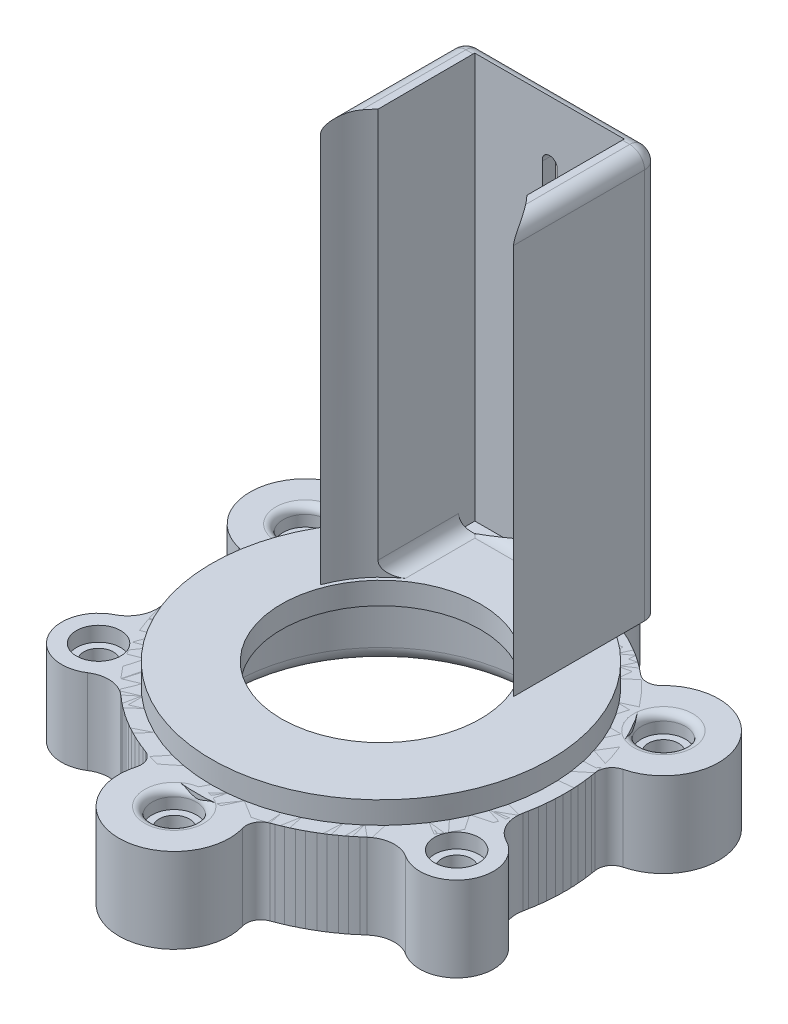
ISO-10303-21;
HEADER;
FILE_DESCRIPTION(('STEP AP214'),'2;1');
FILE_NAME('part.step','',(''),(''),'','','');
FILE_SCHEMA(('AUTOMOTIVE_DESIGN { 1 0 10303 214 1 1 1 1 }'));
ENDSEC;
DATA;
#1=APPLICATION_CONTEXT('core data for automotive mechanical design processes');
#2=APPLICATION_PROTOCOL_DEFINITION('international standard','automotive_design',2000,#1);
#3=PRODUCT_CONTEXT('',#1,'mechanical');
#4=PRODUCT('Part','Part','',(#3));
#5=PRODUCT_RELATED_PRODUCT_CATEGORY('part','',(#4));
#6=PRODUCT_DEFINITION_FORMATION('','',#4);
#7=PRODUCT_DEFINITION_CONTEXT('part definition',#1,'design');
#8=PRODUCT_DEFINITION('design','',#6,#7);
#9=PRODUCT_DEFINITION_SHAPE('','',#8);
#10=(LENGTH_UNIT() NAMED_UNIT(*) SI_UNIT(.MILLI.,.METRE.));
#11=(NAMED_UNIT(*) PLANE_ANGLE_UNIT() SI_UNIT($,.RADIAN.));
#12=(NAMED_UNIT(*) SI_UNIT($,.STERADIAN.) SOLID_ANGLE_UNIT());
#13=UNCERTAINTY_MEASURE_WITH_UNIT(LENGTH_MEASURE(1.E-05),#10,'distance_accuracy_value','');
#14=(GEOMETRIC_REPRESENTATION_CONTEXT(3) GLOBAL_UNCERTAINTY_ASSIGNED_CONTEXT((#13)) GLOBAL_UNIT_ASSIGNED_CONTEXT((#10,
#11,#12)) REPRESENTATION_CONTEXT('',''));
#15=CARTESIAN_POINT('',(0.,0.,0.));
#16=DIRECTION('',(0.,0.,1.));
#17=DIRECTION('',(1.,0.,0.));
#18=AXIS2_PLACEMENT_3D('',#15,#16,#17);
#19=CARTESIAN_POINT('',(-24.2920125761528,0.,14.0249999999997));
#20=DIRECTION('',(0.,1.,0.));
#21=DIRECTION('',(0.,0.,1.));
#22=AXIS2_PLACEMENT_3D('',#19,#20,#21);
#23=CYLINDRICAL_SURFACE('',#22,2.);
#24=CARTESIAN_POINT('',(-24.2920125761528,0.,14.0249999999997));
#25=DIRECTION('',(0.,1.,0.));
#26=DIRECTION('',(0.,0.,1.));
#27=AXIS2_PLACEMENT_3D('',#24,#25,#26);
#28=CIRCLE('',#27,2.);
#29=CARTESIAN_POINT('',(-24.2920125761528,0.,16.0249999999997));
#30=VERTEX_POINT('',#29);
#31=EDGE_CURVE('E294',#30,#30,#28,.T.);
#32=ORIENTED_EDGE('',*,*,#31,.F.);
#33=EDGE_LOOP('',(#32));
#34=FACE_BOUND('',#33,.T.);
#35=CARTESIAN_POINT('',(-24.2920125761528,9.5,14.0249999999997));
#36=DIRECTION('',(0.,1.,0.));
#37=DIRECTION('',(0.,0.,1.));
#38=AXIS2_PLACEMENT_3D('',#35,#36,#37);
#39=CIRCLE('',#38,2.);
#40=CARTESIAN_POINT('',(-24.2920125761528,9.5,16.0249999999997));
#41=VERTEX_POINT('',#40);
#42=EDGE_CURVE('E271',#41,#41,#39,.T.);
#43=ORIENTED_EDGE('',*,*,#42,.T.);
#44=EDGE_LOOP('',(#43));
#45=FACE_BOUND('',#44,.T.);
#46=ADVANCED_FACE('F45',(#34,#45),#23,.F.);
#47=CARTESIAN_POINT('',(-1.23339995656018E-13,0.,-28.0500000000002));
#48=DIRECTION('',(0.,1.,0.));
#49=DIRECTION('',(0.,0.,1.));
#50=AXIS2_PLACEMENT_3D('',#47,#48,#49);
#51=CYLINDRICAL_SURFACE('',#50,2.);
#52=CARTESIAN_POINT('',(-1.23339995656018E-13,0.,-28.0500000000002));
#53=DIRECTION('',(0.,1.,0.));
#54=DIRECTION('',(0.,0.,1.));
#55=AXIS2_PLACEMENT_3D('',#52,#53,#54);
#56=CIRCLE('',#55,2.);
#57=CARTESIAN_POINT('',(-1.23339995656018E-13,0.,-26.0500000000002));
#58=VERTEX_POINT('',#57);
#59=EDGE_CURVE('E291',#58,#58,#56,.T.);
#60=ORIENTED_EDGE('',*,*,#59,.F.);
#61=EDGE_LOOP('',(#60));
#62=FACE_BOUND('',#61,.T.);
#63=CARTESIAN_POINT('',(-1.23339995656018E-13,9.5,-28.0500000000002));
#64=DIRECTION('',(0.,1.,0.));
#65=DIRECTION('',(0.,0.,1.));
#66=AXIS2_PLACEMENT_3D('',#63,#64,#65);
#67=CIRCLE('',#66,2.);
#68=CARTESIAN_POINT('',(-1.23339995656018E-13,9.5,-26.0500000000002));
#69=VERTEX_POINT('',#68);
#70=EDGE_CURVE('E280',#69,#69,#67,.T.);
#71=ORIENTED_EDGE('',*,*,#70,.T.);
#72=EDGE_LOOP('',(#71));
#73=FACE_BOUND('',#72,.T.);
#74=ADVANCED_FACE('F238',(#62,#73),#51,.F.);
#75=CARTESIAN_POINT('',(24.2920125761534,0.,14.0249999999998));
#76=DIRECTION('',(0.,1.,0.));
#77=DIRECTION('',(0.,0.,1.));
#78=AXIS2_PLACEMENT_3D('',#75,#76,#77);
#79=CYLINDRICAL_SURFACE('',#78,2.);
#80=CARTESIAN_POINT('',(24.2920125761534,0.,14.0249999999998));
#81=DIRECTION('',(0.,1.,0.));
#82=DIRECTION('',(0.,0.,1.));
#83=AXIS2_PLACEMENT_3D('',#80,#81,#82);
#84=CIRCLE('',#83,2.);
#85=CARTESIAN_POINT('',(24.2920125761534,0.,16.0249999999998));
#86=VERTEX_POINT('',#85);
#87=EDGE_CURVE('E258',#86,#86,#84,.T.);
#88=ORIENTED_EDGE('',*,*,#87,.F.);
#89=EDGE_LOOP('',(#88));
#90=FACE_BOUND('',#89,.T.);
#91=CARTESIAN_POINT('',(24.2920125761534,9.5,14.0249999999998));
#92=DIRECTION('',(0.,1.,0.));
#93=DIRECTION('',(0.,0.,1.));
#94=AXIS2_PLACEMENT_3D('',#91,#92,#93);
#95=CIRCLE('',#94,2.);
#96=CARTESIAN_POINT('',(24.2920125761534,9.5,16.0249999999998));
#97=VERTEX_POINT('',#96);
#98=EDGE_CURVE('E261',#97,#97,#95,.T.);
#99=ORIENTED_EDGE('',*,*,#98,.T.);
#100=EDGE_LOOP('',(#99));
#101=FACE_BOUND('',#100,.T.);
#102=ADVANCED_FACE('F244',(#90,#101),#79,.F.);
#103=CARTESIAN_POINT('',(-28.3719127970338,0.,6.00287969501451));
#104=DIRECTION('',(0.,1.,0.));
#105=DIRECTION('',(0.,0.,1.));
#106=AXIS2_PLACEMENT_3D('',#103,#104,#105);
#107=CYLINDRICAL_SURFACE('',#106,4.00000000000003);
#108=CARTESIAN_POINT('',(-28.3719127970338,11.5,6.00287969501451));
#109=DIRECTION('',(0.,1.,0.));
#110=DIRECTION('',(0.,0.,1.));
#111=AXIS2_PLACEMENT_3D('',#108,#109,#110);
#112=CIRCLE('',#111,4.00000000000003);
#113=CARTESIAN_POINT('',(-26.5586238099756,11.5,9.56826649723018));
#114=VERTEX_POINT('',#113);
#115=CARTESIAN_POINT('',(-24.458545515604,11.5,5.1748962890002));
#116=VERTEX_POINT('',#115);
#117=EDGE_CURVE('E169',#114,#116,#112,.T.);
#118=ORIENTED_EDGE('',*,*,#117,.T.);
#119=DIRECTION('',(0.,1.,0.));
#120=VECTOR('',#119,1.);
#121=CARTESIAN_POINT('',(-24.458545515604,0.,5.1748962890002));
#122=LINE('',#121,#120);
#123=CARTESIAN_POINT('',(-24.458545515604,0.,5.1748962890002));
#124=VERTEX_POINT('',#123);
#125=EDGE_CURVE('E12',#124,#116,#122,.T.);
#126=ORIENTED_EDGE('',*,*,#125,.F.);
#127=CARTESIAN_POINT('',(-28.3719127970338,0.,6.00287969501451));
#128=DIRECTION('',(0.,1.,0.));
#129=DIRECTION('',(0.,0.,1.));
#130=AXIS2_PLACEMENT_3D('',#127,#128,#129);
#131=CIRCLE('',#130,4.00000000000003);
#132=CARTESIAN_POINT('',(-26.5586238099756,0.,9.56826649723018));
#133=VERTEX_POINT('',#132);
#134=EDGE_CURVE('E64',#133,#124,#131,.T.);
#135=ORIENTED_EDGE('',*,*,#134,.F.);
#136=DIRECTION('',(0.,1.,0.));
#137=VECTOR('',#136,1.);
#138=CARTESIAN_POINT('',(-26.5586238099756,0.,9.56826649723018));
#139=LINE('',#138,#137);
#140=EDGE_CURVE('E49',#133,#114,#139,.T.);
#141=ORIENTED_EDGE('',*,*,#140,.T.);
#142=EDGE_LOOP('',(#118,#126,#135,#141));
#143=FACE_BOUND('',#142,.T.);
#144=ADVANCED_FACE('F220',(#143),#107,.F.);
#145=CARTESIAN_POINT('',(0.,0.,0.));
#146=DIRECTION('',(0.,1.,0.));
#147=DIRECTION('',(0.,0.,1.));
#148=AXIS2_PLACEMENT_3D('',#145,#146,#147);
#149=CYLINDRICAL_SURFACE('',#148,25.0000000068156);
#150=CARTESIAN_POINT('',(0.,11.5,0.));
#151=DIRECTION('',(0.,1.,0.));
#152=DIRECTION('',(0.,0.,1.));
#153=AXIS2_PLACEMENT_3D('',#150,#151,#152);
#154=CIRCLE('',#153,25.0000000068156);
#155=CARTESIAN_POINT('',(-7.74768110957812,11.5,-23.7691699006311));
#156=VERTEX_POINT('',#155);
#157=EDGE_CURVE('E199',#156,#116,#154,.T.);
#158=ORIENTED_EDGE('',*,*,#157,.F.);
#159=DIRECTION('',(0.,1.,0.));
#160=VECTOR('',#159,1.);
#161=CARTESIAN_POINT('',(-7.74768110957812,0.,-23.7691699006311));
#162=LINE('',#161,#160);
#163=CARTESIAN_POINT('',(-7.74768110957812,0.,-23.7691699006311));
#164=VERTEX_POINT('',#163);
#165=EDGE_CURVE('E55',#164,#156,#162,.T.);
#166=ORIENTED_EDGE('',*,*,#165,.F.);
#167=CARTESIAN_POINT('',(0.,0.,0.));
#168=DIRECTION('',(0.,1.,0.));
#169=DIRECTION('',(0.,0.,1.));
#170=AXIS2_PLACEMENT_3D('',#167,#168,#169);
#171=CIRCLE('',#170,25.0000000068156);
#172=EDGE_CURVE('E147',#164,#124,#171,.T.);
#173=ORIENTED_EDGE('',*,*,#172,.T.);
#174=ORIENTED_EDGE('',*,*,#125,.T.);
#175=EDGE_LOOP('',(#158,#166,#173,#174));
#176=FACE_BOUND('',#175,.T.);
#177=ADVANCED_FACE('F254',(#176),#149,.T.);
#178=CARTESIAN_POINT('',(-8.98731008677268,0.,-27.5722370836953));
#179=DIRECTION('',(0.,1.,0.));
#180=DIRECTION('',(0.,0.,1.));
#181=AXIS2_PLACEMENT_3D('',#178,#179,#180);
#182=CYLINDRICAL_SURFACE('',#181,4.);
#183=CARTESIAN_POINT('',(-8.98731008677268,11.5,-27.5722370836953));
#184=DIRECTION('',(0.,1.,0.));
#185=DIRECTION('',(0.,0.,1.));
#186=AXIS2_PLACEMENT_3D('',#183,#184,#185);
#187=CIRCLE('',#186,4.);
#188=CARTESIAN_POINT('',(-4.9929500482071,11.5,-27.7845761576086));
#189=VERTEX_POINT('',#188);
#190=EDGE_CURVE('E151',#156,#189,#187,.T.);
#191=ORIENTED_EDGE('',*,*,#190,.T.);
#192=DIRECTION('',(0.,1.,0.));
#193=VECTOR('',#192,1.);
#194=CARTESIAN_POINT('',(-4.9929500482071,0.,-27.7845761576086));
#195=LINE('',#194,#193);
#196=CARTESIAN_POINT('',(-4.9929500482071,0.,-27.7845761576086));
#197=VERTEX_POINT('',#196);
#198=EDGE_CURVE('E149',#197,#189,#195,.T.);
#199=ORIENTED_EDGE('',*,*,#198,.F.);
#200=CARTESIAN_POINT('',(-8.98731008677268,0.,-27.5722370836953));
#201=DIRECTION('',(0.,1.,0.));
#202=DIRECTION('',(0.,0.,1.));
#203=AXIS2_PLACEMENT_3D('',#200,#201,#202);
#204=CIRCLE('',#203,4.);
#205=EDGE_CURVE('E142',#164,#197,#204,.T.);
#206=ORIENTED_EDGE('',*,*,#205,.F.);
#207=ORIENTED_EDGE('',*,*,#165,.T.);
#208=EDGE_LOOP('',(#191,#199,#206,#207));
#209=FACE_BOUND('',#208,.T.);
#210=ADVANCED_FACE('F150',(#209),#182,.F.);
#211=CARTESIAN_POINT('',(-1.23339995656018E-13,0.,-28.0500000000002));
#212=DIRECTION('',(0.,1.,0.));
#213=DIRECTION('',(0.,0.,1.));
#214=AXIS2_PLACEMENT_3D('',#211,#212,#213);
#215=CYLINDRICAL_SURFACE('',#214,5.);
#216=CARTESIAN_POINT('',(-1.23339995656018E-13,11.5,-28.0500000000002));
#217=DIRECTION('',(0.,1.,0.));
#218=DIRECTION('',(0.,0.,1.));
#219=AXIS2_PLACEMENT_3D('',#216,#217,#218);
#220=CIRCLE('',#219,5.);
#221=CARTESIAN_POINT('',(4.99295004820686,11.5,-27.7845761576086));
#222=VERTEX_POINT('',#221);
#223=EDGE_CURVE('E196',#222,#189,#220,.T.);
#224=ORIENTED_EDGE('',*,*,#223,.F.);
#225=DIRECTION('',(0.,1.,0.));
#226=VECTOR('',#225,1.);
#227=CARTESIAN_POINT('',(4.99295004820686,0.,-27.7845761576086));
#228=LINE('',#227,#226);
#229=CARTESIAN_POINT('',(4.99295004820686,0.,-27.7845761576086));
#230=VERTEX_POINT('',#229);
#231=EDGE_CURVE('E155',#230,#222,#228,.T.);
#232=ORIENTED_EDGE('',*,*,#231,.F.);
#233=CARTESIAN_POINT('',(-1.23339995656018E-13,0.,-28.0500000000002));
#234=DIRECTION('',(0.,1.,0.));
#235=DIRECTION('',(0.,0.,1.));
#236=AXIS2_PLACEMENT_3D('',#233,#234,#235);
#237=CIRCLE('',#236,5.);
#238=EDGE_CURVE('E146',#230,#197,#237,.T.);
#239=ORIENTED_EDGE('',*,*,#238,.T.);
#240=ORIENTED_EDGE('',*,*,#198,.T.);
#241=EDGE_LOOP('',(#224,#232,#239,#240));
#242=FACE_BOUND('',#241,.T.);
#243=ADVANCED_FACE('F157',(#242),#215,.T.);
#244=CARTESIAN_POINT('',(8.98731008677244,0.,-27.5722370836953));
#245=DIRECTION('',(0.,1.,0.));
#246=DIRECTION('',(0.,0.,1.));
#247=AXIS2_PLACEMENT_3D('',#244,#245,#246);
#248=CYLINDRICAL_SURFACE('',#247,4.);
#249=CARTESIAN_POINT('',(8.98731008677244,11.5,-27.5722370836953));
#250=DIRECTION('',(0.,1.,0.));
#251=DIRECTION('',(0.,0.,1.));
#252=AXIS2_PLACEMENT_3D('',#249,#250,#251);
#253=CIRCLE('',#252,4.);
#254=CARTESIAN_POINT('',(7.74768110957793,11.5,-23.7691699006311));
#255=VERTEX_POINT('',#254);
#256=EDGE_CURVE('E193',#222,#255,#253,.T.);
#257=ORIENTED_EDGE('',*,*,#256,.T.);
#258=DIRECTION('',(0.,1.,0.));
#259=VECTOR('',#258,1.);
#260=CARTESIAN_POINT('',(7.74768110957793,0.,-23.7691699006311));
#261=LINE('',#260,#259);
#262=CARTESIAN_POINT('',(7.74768110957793,0.,-23.7691699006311));
#263=VERTEX_POINT('',#262);
#264=EDGE_CURVE('E205',#263,#255,#261,.T.);
#265=ORIENTED_EDGE('',*,*,#264,.F.);
#266=CARTESIAN_POINT('',(8.98731008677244,0.,-27.5722370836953));
#267=DIRECTION('',(0.,1.,0.));
#268=DIRECTION('',(0.,0.,1.));
#269=AXIS2_PLACEMENT_3D('',#266,#267,#268);
#270=CIRCLE('',#269,4.);
#271=EDGE_CURVE('E159',#230,#263,#270,.T.);
#272=ORIENTED_EDGE('',*,*,#271,.F.);
#273=ORIENTED_EDGE('',*,*,#231,.T.);
#274=EDGE_LOOP('',(#257,#265,#272,#273));
#275=FACE_BOUND('',#274,.T.);
#276=ADVANCED_FACE('F321',(#275),#248,.F.);
#277=CARTESIAN_POINT('',(0.,0.,0.));
#278=DIRECTION('',(0.,1.,0.));
#279=DIRECTION('',(0.,0.,1.));
#280=AXIS2_PLACEMENT_3D('',#277,#278,#279);
#281=CYLINDRICAL_SURFACE('',#280,25.0000000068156);
#282=CARTESIAN_POINT('',(0.,11.5,0.));
#283=DIRECTION('',(0.,1.,0.));
#284=DIRECTION('',(0.,0.,1.));
#285=AXIS2_PLACEMENT_3D('',#282,#283,#284);
#286=CIRCLE('',#285,25.0000000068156);
#287=CARTESIAN_POINT('',(24.458545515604,11.5,5.17489628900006));
#288=VERTEX_POINT('',#287);
#289=EDGE_CURVE('E190',#288,#255,#286,.T.);
#290=ORIENTED_EDGE('',*,*,#289,.F.);
#291=DIRECTION('',(0.,1.,0.));
#292=VECTOR('',#291,1.);
#293=CARTESIAN_POINT('',(24.458545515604,0.,5.17489628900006));
#294=LINE('',#293,#292);
#295=CARTESIAN_POINT('',(24.458545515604,0.,5.17489628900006));
#296=VERTEX_POINT('',#295);
#297=EDGE_CURVE('E207',#296,#288,#294,.T.);
#298=ORIENTED_EDGE('',*,*,#297,.F.);
#299=CARTESIAN_POINT('',(0.,0.,0.));
#300=DIRECTION('',(0.,1.,0.));
#301=DIRECTION('',(0.,0.,1.));
#302=AXIS2_PLACEMENT_3D('',#299,#300,#301);
#303=CIRCLE('',#302,25.0000000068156);
#304=EDGE_CURVE('E161',#296,#263,#303,.T.);
#305=ORIENTED_EDGE('',*,*,#304,.T.);
#306=ORIENTED_EDGE('',*,*,#264,.T.);
#307=EDGE_LOOP('',(#290,#298,#305,#306));
#308=FACE_BOUND('',#307,.T.);
#309=ADVANCED_FACE('F315',(#308),#281,.T.);
#310=CARTESIAN_POINT('',(28.3719127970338,0.,6.00287969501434));
#311=DIRECTION('',(0.,1.,0.));
#312=DIRECTION('',(0.,0.,1.));
#313=AXIS2_PLACEMENT_3D('',#310,#311,#312);
#314=CYLINDRICAL_SURFACE('',#313,4.00000000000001);
#315=CARTESIAN_POINT('',(28.3719127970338,11.5,6.00287969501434));
#316=DIRECTION('',(0.,1.,0.));
#317=DIRECTION('',(0.,0.,1.));
#318=AXIS2_PLACEMENT_3D('',#315,#316,#317);
#319=CIRCLE('',#318,4.00000000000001);
#320=CARTESIAN_POINT('',(26.5586238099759,11.5,9.56826649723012));
#321=VERTEX_POINT('',#320);
#322=EDGE_CURVE('E187',#288,#321,#319,.T.);
#323=ORIENTED_EDGE('',*,*,#322,.T.);
#324=DIRECTION('',(0.,1.,0.));
#325=VECTOR('',#324,1.);
#326=CARTESIAN_POINT('',(26.5586238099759,0.,9.56826649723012));
#327=LINE('',#326,#325);
#328=CARTESIAN_POINT('',(26.5586238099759,0.,9.56826649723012));
#329=VERTEX_POINT('',#328);
#330=EDGE_CURVE('E209',#329,#321,#327,.T.);
#331=ORIENTED_EDGE('',*,*,#330,.F.);
#332=CARTESIAN_POINT('',(28.3719127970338,0.,6.00287969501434));
#333=DIRECTION('',(0.,1.,0.));
#334=DIRECTION('',(0.,0.,1.));
#335=AXIS2_PLACEMENT_3D('',#332,#333,#334);
#336=CIRCLE('',#335,4.00000000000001);
#337=EDGE_CURVE('E310',#296,#329,#336,.T.);
#338=ORIENTED_EDGE('',*,*,#337,.F.);
#339=ORIENTED_EDGE('',*,*,#297,.T.);
#340=EDGE_LOOP('',(#323,#331,#338,#339));
#341=FACE_BOUND('',#340,.T.);
#342=ADVANCED_FACE('F327',(#341),#314,.F.);
#343=CARTESIAN_POINT('',(24.2920125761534,0.,14.0249999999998));
#344=DIRECTION('',(0.,1.,0.));
#345=DIRECTION('',(0.,0.,1.));
#346=AXIS2_PLACEMENT_3D('',#343,#344,#345);
#347=CYLINDRICAL_SURFACE('',#346,5.);
#348=CARTESIAN_POINT('',(24.2920125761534,11.5,14.0249999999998));
#349=DIRECTION('',(0.,1.,0.));
#350=DIRECTION('',(0.,0.,1.));
#351=AXIS2_PLACEMENT_3D('',#348,#349,#350);
#352=CIRCLE('',#351,5.);
#353=CARTESIAN_POINT('',(21.5656737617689,11.5,18.2163096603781));
#354=VERTEX_POINT('',#353);
#355=EDGE_CURVE('E184',#354,#321,#352,.T.);
#356=ORIENTED_EDGE('',*,*,#355,.F.);
#357=DIRECTION('',(0.,1.,0.));
#358=VECTOR('',#357,1.);
#359=CARTESIAN_POINT('',(21.5656737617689,0.,18.2163096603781));
#360=LINE('',#359,#358);
#361=CARTESIAN_POINT('',(21.5656737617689,0.,18.2163096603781));
#362=VERTEX_POINT('',#361);
#363=EDGE_CURVE('E211',#362,#354,#360,.T.);
#364=ORIENTED_EDGE('',*,*,#363,.F.);
#365=CARTESIAN_POINT('',(24.2920125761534,0.,14.0249999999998));
#366=DIRECTION('',(0.,1.,0.));
#367=DIRECTION('',(0.,0.,1.));
#368=AXIS2_PLACEMENT_3D('',#365,#366,#367);
#369=CIRCLE('',#368,5.);
#370=EDGE_CURVE('E307',#362,#329,#369,.T.);
#371=ORIENTED_EDGE('',*,*,#370,.T.);
#372=ORIENTED_EDGE('',*,*,#330,.T.);
#373=EDGE_LOOP('',(#356,#364,#371,#372));
#374=FACE_BOUND('',#373,.T.);
#375=ADVANCED_FACE('F329',(#374),#347,.T.);
#376=CARTESIAN_POINT('',(19.3846027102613,0.,21.5693573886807));
#377=DIRECTION('',(0.,1.,0.));
#378=DIRECTION('',(0.,0.,1.));
#379=AXIS2_PLACEMENT_3D('',#376,#377,#378);
#380=CYLINDRICAL_SURFACE('',#379,4.00000000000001);
#381=CARTESIAN_POINT('',(19.3846027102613,11.5,21.5693573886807));
#382=DIRECTION('',(0.,1.,0.));
#383=DIRECTION('',(0.,0.,1.));
#384=AXIS2_PLACEMENT_3D('',#381,#382,#383);
#385=CIRCLE('',#384,4.00000000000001);
#386=CARTESIAN_POINT('',(16.710864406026,11.5,18.5942736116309));
#387=VERTEX_POINT('',#386);
#388=EDGE_CURVE('E181',#354,#387,#385,.T.);
#389=ORIENTED_EDGE('',*,*,#388,.T.);
#390=DIRECTION('',(0.,1.,0.));
#391=VECTOR('',#390,1.);
#392=CARTESIAN_POINT('',(16.710864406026,0.,18.5942736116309));
#393=LINE('',#392,#391);
#394=CARTESIAN_POINT('',(16.710864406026,0.,18.5942736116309));
#395=VERTEX_POINT('',#394);
#396=EDGE_CURVE('E213',#395,#387,#393,.T.);
#397=ORIENTED_EDGE('',*,*,#396,.F.);
#398=CARTESIAN_POINT('',(19.3846027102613,0.,21.5693573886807));
#399=DIRECTION('',(0.,1.,0.));
#400=DIRECTION('',(0.,0.,1.));
#401=AXIS2_PLACEMENT_3D('',#398,#399,#400);
#402=CIRCLE('',#401,4.00000000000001);
#403=EDGE_CURVE('E305',#362,#395,#402,.T.);
#404=ORIENTED_EDGE('',*,*,#403,.F.);
#405=ORIENTED_EDGE('',*,*,#363,.T.);
#406=EDGE_LOOP('',(#389,#397,#404,#405));
#407=FACE_BOUND('',#406,.T.);
#408=ADVANCED_FACE('F334',(#407),#380,.F.);
#409=CARTESIAN_POINT('',(0.,0.,0.));
#410=DIRECTION('',(0.,1.,0.));
#411=DIRECTION('',(0.,0.,1.));
#412=AXIS2_PLACEMENT_3D('',#409,#410,#411);
#413=CYLINDRICAL_SURFACE('',#412,25.0000000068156);
#414=CARTESIAN_POINT('',(0.,11.5,0.));
#415=DIRECTION('',(0.,1.,0.));
#416=DIRECTION('',(0.,0.,1.));
#417=AXIS2_PLACEMENT_3D('',#414,#415,#416);
#418=CIRCLE('',#417,25.0000000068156);
#419=CARTESIAN_POINT('',(-16.7108644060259,11.5,18.594273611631));
#420=VERTEX_POINT('',#419);
#421=EDGE_CURVE('E178',#420,#387,#418,.T.);
#422=ORIENTED_EDGE('',*,*,#421,.F.);
#423=DIRECTION('',(0.,1.,0.));
#424=VECTOR('',#423,1.);
#425=CARTESIAN_POINT('',(-16.7108644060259,0.,18.594273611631));
#426=LINE('',#425,#424);
#427=CARTESIAN_POINT('',(-16.7108644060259,0.,18.594273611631));
#428=VERTEX_POINT('',#427);
#429=EDGE_CURVE('E215',#428,#420,#426,.T.);
#430=ORIENTED_EDGE('',*,*,#429,.F.);
#431=CARTESIAN_POINT('',(0.,0.,0.));
#432=DIRECTION('',(0.,1.,0.));
#433=DIRECTION('',(0.,0.,1.));
#434=AXIS2_PLACEMENT_3D('',#431,#432,#433);
#435=CIRCLE('',#434,25.0000000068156);
#436=EDGE_CURVE('E302',#428,#395,#435,.T.);
#437=ORIENTED_EDGE('',*,*,#436,.T.);
#438=ORIENTED_EDGE('',*,*,#396,.T.);
#439=EDGE_LOOP('',(#422,#430,#437,#438));
#440=FACE_BOUND('',#439,.T.);
#441=ADVANCED_FACE('F337',(#440),#413,.T.);
#442=CARTESIAN_POINT('',(-19.3846027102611,0.,21.5693573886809));
#443=DIRECTION('',(0.,1.,0.));
#444=DIRECTION('',(0.,0.,1.));
#445=AXIS2_PLACEMENT_3D('',#442,#443,#444);
#446=CYLINDRICAL_SURFACE('',#445,4.);
#447=CARTESIAN_POINT('',(-19.3846027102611,11.5,21.5693573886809));
#448=DIRECTION('',(0.,1.,0.));
#449=DIRECTION('',(0.,0.,1.));
#450=AXIS2_PLACEMENT_3D('',#447,#448,#449);
#451=CIRCLE('',#450,4.);
#452=CARTESIAN_POINT('',(-21.5656737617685,11.5,18.2163096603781));
#453=VERTEX_POINT('',#452);
#454=EDGE_CURVE('E175',#420,#453,#451,.T.);
#455=ORIENTED_EDGE('',*,*,#454,.T.);
#456=DIRECTION('',(0.,1.,0.));
#457=VECTOR('',#456,1.);
#458=CARTESIAN_POINT('',(-21.5656737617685,0.,18.2163096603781));
#459=LINE('',#458,#457);
#460=CARTESIAN_POINT('',(-21.5656737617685,0.,18.2163096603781));
#461=VERTEX_POINT('',#460);
#462=EDGE_CURVE('E216',#461,#453,#459,.T.);
#463=ORIENTED_EDGE('',*,*,#462,.F.);
#464=CARTESIAN_POINT('',(-19.3846027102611,0.,21.5693573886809));
#465=DIRECTION('',(0.,1.,0.));
#466=DIRECTION('',(0.,0.,1.));
#467=AXIS2_PLACEMENT_3D('',#464,#465,#466);
#468=CIRCLE('',#467,4.);
#469=EDGE_CURVE('E300',#428,#461,#468,.T.);
#470=ORIENTED_EDGE('',*,*,#469,.F.);
#471=ORIENTED_EDGE('',*,*,#429,.T.);
#472=EDGE_LOOP('',(#455,#463,#470,#471));
#473=FACE_BOUND('',#472,.T.);
#474=ADVANCED_FACE('F233',(#473),#446,.F.);
#475=CARTESIAN_POINT('',(0.,0.,0.));
#476=DIRECTION('',(0.,1.,0.));
#477=DIRECTION('',(0.,0.,1.));
#478=AXIS2_PLACEMENT_3D('',#475,#476,#477);
#479=CYLINDRICAL_SURFACE('',#478,22.858305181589);
#480=CARTESIAN_POINT('',(0.,0.,0.));
#481=DIRECTION('',(0.,1.,0.));
#482=DIRECTION('',(0.,0.,1.));
#483=AXIS2_PLACEMENT_3D('',#480,#481,#482);
#484=CIRCLE('',#483,22.858305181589);
#485=CARTESIAN_POINT('',(0.,0.,22.858305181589));
#486=VERTEX_POINT('',#485);
#487=EDGE_CURVE('E201',#486,#486,#484,.T.);
#488=ORIENTED_EDGE('',*,*,#487,.F.);
#489=EDGE_LOOP('',(#488));
#490=FACE_BOUND('',#489,.T.);
#491=CARTESIAN_POINT('',(0.,11.5,0.));
#492=DIRECTION('',(0.,1.,0.));
#493=DIRECTION('',(0.,0.,1.));
#494=AXIS2_PLACEMENT_3D('',#491,#492,#493);
#495=CIRCLE('',#494,22.858305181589);
#496=CARTESIAN_POINT('',(0.,11.5,22.858305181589));
#497=VERTEX_POINT('',#496);
#498=EDGE_CURVE('E166',#497,#497,#495,.T.);
#499=ORIENTED_EDGE('',*,*,#498,.T.);
#500=EDGE_LOOP('',(#499));
#501=FACE_BOUND('',#500,.T.);
#502=ADVANCED_FACE('F47',(#490,#501),#479,.F.);
#503=CARTESIAN_POINT('',(-24.2920125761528,0.,14.0249999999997));
#504=DIRECTION('',(0.,1.,0.));
#505=DIRECTION('',(0.,0.,1.));
#506=AXIS2_PLACEMENT_3D('',#503,#504,#505);
#507=CYLINDRICAL_SURFACE('',#506,4.99999999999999);
#508=CARTESIAN_POINT('',(-24.2920125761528,11.5,14.0249999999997));
#509=DIRECTION('',(0.,1.,0.));
#510=DIRECTION('',(0.,0.,1.));
#511=AXIS2_PLACEMENT_3D('',#508,#509,#510);
#512=CIRCLE('',#511,4.99999999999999);
#513=EDGE_CURVE('E172',#114,#453,#512,.T.);
#514=ORIENTED_EDGE('',*,*,#513,.F.);
#515=ORIENTED_EDGE('',*,*,#140,.F.);
#516=CARTESIAN_POINT('',(-24.2920125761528,0.,14.0249999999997));
#517=DIRECTION('',(0.,1.,0.));
#518=DIRECTION('',(0.,0.,1.));
#519=AXIS2_PLACEMENT_3D('',#516,#517,#518);
#520=CIRCLE('',#519,4.99999999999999);
#521=EDGE_CURVE('E298',#133,#461,#520,.T.);
#522=ORIENTED_EDGE('',*,*,#521,.T.);
#523=ORIENTED_EDGE('',*,*,#462,.T.);
#524=EDGE_LOOP('',(#514,#515,#522,#523));
#525=FACE_BOUND('',#524,.T.);
#526=ADVANCED_FACE('F224',(#525),#507,.T.);
#527=CARTESIAN_POINT('',(0.,0.,0.));
#528=DIRECTION('',(0.,1.,0.));
#529=DIRECTION('',(0.,0.,1.));
#530=AXIS2_PLACEMENT_3D('',#527,#528,#529);
#531=PLANE('',#530);
#532=ORIENTED_EDGE('',*,*,#487,.T.);
#533=EDGE_LOOP('',(#532));
#534=FACE_BOUND('',#533,.T.);
#535=ORIENTED_EDGE('',*,*,#87,.T.);
#536=EDGE_LOOP('',(#535));
#537=FACE_BOUND('',#536,.T.);
#538=ORIENTED_EDGE('',*,*,#59,.T.);
#539=EDGE_LOOP('',(#538));
#540=FACE_BOUND('',#539,.T.);
#541=ORIENTED_EDGE('',*,*,#31,.T.);
#542=EDGE_LOOP('',(#541));
#543=FACE_BOUND('',#542,.T.);
#544=ORIENTED_EDGE('',*,*,#134,.T.);
#545=ORIENTED_EDGE('',*,*,#172,.F.);
#546=ORIENTED_EDGE('',*,*,#205,.T.);
#547=ORIENTED_EDGE('',*,*,#238,.F.);
#548=ORIENTED_EDGE('',*,*,#271,.T.);
#549=ORIENTED_EDGE('',*,*,#304,.F.);
#550=ORIENTED_EDGE('',*,*,#337,.T.);
#551=ORIENTED_EDGE('',*,*,#370,.F.);
#552=ORIENTED_EDGE('',*,*,#403,.T.);
#553=ORIENTED_EDGE('',*,*,#436,.F.);
#554=ORIENTED_EDGE('',*,*,#469,.T.);
#555=ORIENTED_EDGE('',*,*,#521,.F.);
#556=EDGE_LOOP('',(#544,#545,#546,#547,#548,#549,#550,#551,#552,#553,#554,#555));
#557=FACE_BOUND('',#556,.T.);
#558=ADVANCED_FACE('F144',(#534,#537,#540,#543,#557),#531,.F.);
#559=CARTESIAN_POINT('',(0.,11.5,0.));
#560=DIRECTION('',(0.,1.,0.));
#561=DIRECTION('',(0.,0.,1.));
#562=AXIS2_PLACEMENT_3D('',#559,#560,#561);
#563=PLANE('',#562);
#564=CARTESIAN_POINT('',(24.2920125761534,11.5,14.0249999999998));
#565=DIRECTION('',(0.,1.,0.));
#566=DIRECTION('',(0.,0.,1.));
#567=AXIS2_PLACEMENT_3D('',#564,#565,#566);
#568=CIRCLE('',#567,3.);
#569=CARTESIAN_POINT('',(24.2920125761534,11.5,17.0249999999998));
#570=VERTEX_POINT('',#569);
#571=EDGE_CURVE('E263',#570,#570,#568,.T.);
#572=ORIENTED_EDGE('',*,*,#571,.F.);
#573=EDGE_LOOP('',(#572));
#574=FACE_BOUND('',#573,.T.);
#575=CARTESIAN_POINT('',(-24.2920125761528,11.5,14.0249999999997));
#576=DIRECTION('',(0.,1.,0.));
#577=DIRECTION('',(0.,0.,1.));
#578=AXIS2_PLACEMENT_3D('',#575,#576,#577);
#579=CIRCLE('',#578,3.);
#580=CARTESIAN_POINT('',(-24.2920125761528,11.5,17.0249999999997));
#581=VERTEX_POINT('',#580);
#582=EDGE_CURVE('E274',#581,#581,#579,.T.);
#583=ORIENTED_EDGE('',*,*,#582,.F.);
#584=EDGE_LOOP('',(#583));
#585=FACE_BOUND('',#584,.T.);
#586=CARTESIAN_POINT('',(-1.23339995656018E-13,11.5,-28.0500000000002));
#587=DIRECTION('',(0.,1.,0.));
#588=DIRECTION('',(0.,0.,1.));
#589=AXIS2_PLACEMENT_3D('',#586,#587,#588);
#590=CIRCLE('',#589,3.);
#591=CARTESIAN_POINT('',(-1.23339995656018E-13,11.5,-25.0500000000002));
#592=VERTEX_POINT('',#591);
#593=EDGE_CURVE('E283',#592,#592,#590,.T.);
#594=ORIENTED_EDGE('',*,*,#593,.F.);
#595=EDGE_LOOP('',(#594));
#596=FACE_BOUND('',#595,.T.);
#597=ORIENTED_EDGE('',*,*,#498,.F.);
#598=EDGE_LOOP('',(#597));
#599=FACE_BOUND('',#598,.T.);
#600=ORIENTED_EDGE('',*,*,#117,.F.);
#601=ORIENTED_EDGE('',*,*,#513,.T.);
#602=ORIENTED_EDGE('',*,*,#454,.F.);
#603=ORIENTED_EDGE('',*,*,#421,.T.);
#604=ORIENTED_EDGE('',*,*,#388,.F.);
#605=ORIENTED_EDGE('',*,*,#355,.T.);
#606=ORIENTED_EDGE('',*,*,#322,.F.);
#607=ORIENTED_EDGE('',*,*,#289,.T.);
#608=ORIENTED_EDGE('',*,*,#256,.F.);
#609=ORIENTED_EDGE('',*,*,#223,.T.);
#610=ORIENTED_EDGE('',*,*,#190,.F.);
#611=ORIENTED_EDGE('',*,*,#157,.T.);
#612=EDGE_LOOP('',(#600,#601,#602,#603,#604,#605,#606,#607,#608,#609,#610,#611));
#613=FACE_BOUND('',#612,.T.);
#614=ADVANCED_FACE('F222',(#574,#585,#596,#599,#613),#563,.T.);
#615=CARTESIAN_POINT('',(-1.23339995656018E-13,9.5,-28.0500000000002));
#616=DIRECTION('',(0.,1.,0.));
#617=DIRECTION('',(0.,0.,1.));
#618=AXIS2_PLACEMENT_3D('',#615,#616,#617);
#619=CYLINDRICAL_SURFACE('',#618,3.);
#620=CARTESIAN_POINT('',(-1.23339995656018E-13,9.5,-28.0500000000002));
#621=DIRECTION('',(0.,1.,0.));
#622=DIRECTION('',(0.,0.,1.));
#623=AXIS2_PLACEMENT_3D('',#620,#621,#622);
#624=CIRCLE('',#623,3.);
#625=CARTESIAN_POINT('',(-1.23339995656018E-13,9.5,-25.0500000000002));
#626=VERTEX_POINT('',#625);
#627=EDGE_CURVE('E279',#626,#626,#624,.T.);
#628=ORIENTED_EDGE('',*,*,#627,.F.);
#629=EDGE_LOOP('',(#628));
#630=FACE_BOUND('',#629,.T.);
#631=ORIENTED_EDGE('',*,*,#593,.T.);
#632=EDGE_LOOP('',(#631));
#633=FACE_BOUND('',#632,.T.);
#634=ADVANCED_FACE('F363',(#630,#633),#619,.F.);
#635=CARTESIAN_POINT('',(0.,9.5,0.));
#636=DIRECTION('',(0.,1.,0.));
#637=DIRECTION('',(0.,0.,1.));
#638=AXIS2_PLACEMENT_3D('',#635,#636,#637);
#639=PLANE('',#638);
#640=ORIENTED_EDGE('',*,*,#70,.F.);
#641=EDGE_LOOP('',(#640));
#642=FACE_BOUND('',#641,.T.);
#643=ORIENTED_EDGE('',*,*,#627,.T.);
#644=EDGE_LOOP('',(#643));
#645=FACE_BOUND('',#644,.T.);
#646=ADVANCED_FACE('F368',(#642,#645),#639,.T.);
#647=CARTESIAN_POINT('',(-24.2920125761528,9.5,14.0249999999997));
#648=DIRECTION('',(0.,1.,0.));
#649=DIRECTION('',(0.,0.,1.));
#650=AXIS2_PLACEMENT_3D('',#647,#648,#649);
#651=CYLINDRICAL_SURFACE('',#650,3.);
#652=CARTESIAN_POINT('',(-24.2920125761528,9.5,14.0249999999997));
#653=DIRECTION('',(0.,1.,0.));
#654=DIRECTION('',(0.,0.,1.));
#655=AXIS2_PLACEMENT_3D('',#652,#653,#654);
#656=CIRCLE('',#655,3.);
#657=CARTESIAN_POINT('',(-24.2920125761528,9.5,17.0249999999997));
#658=VERTEX_POINT('',#657);
#659=EDGE_CURVE('E268',#658,#658,#656,.T.);
#660=ORIENTED_EDGE('',*,*,#659,.F.);
#661=EDGE_LOOP('',(#660));
#662=FACE_BOUND('',#661,.T.);
#663=ORIENTED_EDGE('',*,*,#582,.T.);
#664=EDGE_LOOP('',(#663));
#665=FACE_BOUND('',#664,.T.);
#666=ADVANCED_FACE('F372',(#662,#665),#651,.F.);
#667=CARTESIAN_POINT('',(0.,9.5,0.));
#668=DIRECTION('',(0.,1.,0.));
#669=DIRECTION('',(0.,0.,1.));
#670=AXIS2_PLACEMENT_3D('',#667,#668,#669);
#671=PLANE('',#670);
#672=ORIENTED_EDGE('',*,*,#42,.F.);
#673=EDGE_LOOP('',(#672));
#674=FACE_BOUND('',#673,.T.);
#675=ORIENTED_EDGE('',*,*,#659,.T.);
#676=EDGE_LOOP('',(#675));
#677=FACE_BOUND('',#676,.T.);
#678=ADVANCED_FACE('F376',(#674,#677),#671,.T.);
#679=CARTESIAN_POINT('',(24.2920125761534,9.5,14.0249999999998));
#680=DIRECTION('',(0.,1.,0.));
#681=DIRECTION('',(0.,0.,1.));
#682=AXIS2_PLACEMENT_3D('',#679,#680,#681);
#683=CYLINDRICAL_SURFACE('',#682,3.);
#684=CARTESIAN_POINT('',(24.2920125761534,9.5,14.0249999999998));
#685=DIRECTION('',(0.,1.,0.));
#686=DIRECTION('',(0.,0.,1.));
#687=AXIS2_PLACEMENT_3D('',#684,#685,#686);
#688=CIRCLE('',#687,3.);
#689=CARTESIAN_POINT('',(24.2920125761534,9.5,17.0249999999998));
#690=VERTEX_POINT('',#689);
#691=EDGE_CURVE('E170',#690,#690,#688,.T.);
#692=ORIENTED_EDGE('',*,*,#691,.F.);
#693=EDGE_LOOP('',(#692));
#694=FACE_BOUND('',#693,.T.);
#695=ORIENTED_EDGE('',*,*,#571,.T.);
#696=EDGE_LOOP('',(#695));
#697=FACE_BOUND('',#696,.T.);
#698=ADVANCED_FACE('F380',(#694,#697),#683,.F.);
#699=CARTESIAN_POINT('',(0.,9.5,0.));
#700=DIRECTION('',(0.,1.,0.));
#701=DIRECTION('',(0.,0.,1.));
#702=AXIS2_PLACEMENT_3D('',#699,#700,#701);
#703=PLANE('',#702);
#704=ORIENTED_EDGE('',*,*,#98,.F.);
#705=EDGE_LOOP('',(#704));
#706=FACE_BOUND('',#705,.T.);
#707=ORIENTED_EDGE('',*,*,#691,.T.);
#708=EDGE_LOOP('',(#707));
#709=FACE_BOUND('',#708,.T.);
#710=ADVANCED_FACE('F384',(#706,#709),#703,.T.);
#711=CLOSED_SHELL('',(#46,#74,#102,#144,#177,#210,#243,#276,#309,#342,#375,#408,#441,#474,#502,
#526,#558,#614,#634,#646,#666,#678,#698,#710));
#712=MANIFOLD_SOLID_BREP('B2',#711);
#713=CARTESIAN_POINT('',(0.,10.5,0.));
#714=DIRECTION('',(0.,1.,0.));
#715=DIRECTION('',(0.,0.,1.));
#716=AXIS2_PLACEMENT_3D('',#713,#714,#715);
#717=CYLINDRICAL_SURFACE('',#716,23.);
#718=CARTESIAN_POINT('',(0.,14.5,0.));
#719=DIRECTION('',(0.,1.,0.));
#720=DIRECTION('',(0.,0.,1.));
#721=AXIS2_PLACEMENT_3D('',#718,#719,#720);
#722=CIRCLE('',#721,23.);
#723=CARTESIAN_POINT('',(10.1214632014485,14.5,-20.6532317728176));
#724=VERTEX_POINT('',#723);
#725=CARTESIAN_POINT('',(2.3830587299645,14.5,-22.8762110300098));
#726=VERTEX_POINT('',#725);
#727=EDGE_CURVE('E610',#724,#726,#722,.T.);
#728=ORIENTED_EDGE('',*,*,#727,.T.);
#729=DIRECTION('',(0.,1.,0.));
#730=VECTOR('',#729,1.);
#731=CARTESIAN_POINT('',(2.3830587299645,10.5,-22.8762110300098));
#732=LINE('',#731,#730);
#733=CARTESIAN_POINT('',(2.3830587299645,10.5,-22.8762110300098));
#734=VERTEX_POINT('',#733);
#735=EDGE_CURVE('E43',#734,#726,#732,.T.);
#736=ORIENTED_EDGE('',*,*,#735,.F.);
#737=CARTESIAN_POINT('',(0.,10.5,0.));
#738=DIRECTION('',(0.,1.,0.));
#739=DIRECTION('',(0.,0.,1.));
#740=AXIS2_PLACEMENT_3D('',#737,#738,#739);
#741=CIRCLE('',#740,23.);
#742=CARTESIAN_POINT('',(10.1214632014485,10.5,-20.6532317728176));
#743=VERTEX_POINT('',#742);
#744=EDGE_CURVE('E578',#743,#734,#741,.T.);
#745=ORIENTED_EDGE('',*,*,#744,.F.);
#746=DIRECTION('',(0.,1.,0.));
#747=VECTOR('',#746,1.);
#748=CARTESIAN_POINT('',(10.1214632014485,10.5,-20.6532317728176));
#749=LINE('',#748,#747);
#750=EDGE_CURVE('E563',#743,#724,#749,.T.);
#751=ORIENTED_EDGE('',*,*,#750,.T.);
#752=EDGE_LOOP('',(#728,#736,#745,#751));
#753=FACE_BOUND('',#752,.T.);
#754=ADVANCED_FACE('F560',(#753),#717,.F.);
#755=CARTESIAN_POINT('',(0.0565565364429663,10.5,-22.8819613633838));
#756=DIRECTION('',(0.00247165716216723,0.,-0.999996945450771));
#757=DIRECTION('',(-0.999996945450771,0.,-0.00247165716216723));
#758=AXIS2_PLACEMENT_3D('',#755,#756,#757);
#759=PLANE('',#758);
#760=DIRECTION('',(-0.999996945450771,0.,-0.00247165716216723));
#761=VECTOR('',#760,1.);
#762=CARTESIAN_POINT('',(0.0565565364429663,14.5,-22.8819613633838));
#763=LINE('',#762,#761);
#764=CARTESIAN_POINT('',(10.1269103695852,14.5,-22.8570708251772));
#765=VERTEX_POINT('',#764);
#766=EDGE_CURVE('E604',#765,#726,#763,.T.);
#767=ORIENTED_EDGE('',*,*,#766,.F.);
#768=DIRECTION('',(0.,1.,0.));
#769=VECTOR('',#768,1.);
#770=CARTESIAN_POINT('',(10.1269103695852,10.5,-22.8570708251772));
#771=LINE('',#770,#769);
#772=CARTESIAN_POINT('',(10.1269103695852,10.5,-22.8570708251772));
#773=VERTEX_POINT('',#772);
#774=EDGE_CURVE('E569',#773,#765,#771,.T.);
#775=ORIENTED_EDGE('',*,*,#774,.F.);
#776=DIRECTION('',(-0.999996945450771,0.,-0.00247165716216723));
#777=VECTOR('',#776,1.);
#778=CARTESIAN_POINT('',(0.0565565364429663,10.5,-22.8819613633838));
#779=LINE('',#778,#777);
#780=EDGE_CURVE('E603',#773,#734,#779,.T.);
#781=ORIENTED_EDGE('',*,*,#780,.T.);
#782=ORIENTED_EDGE('',*,*,#735,.T.);
#783=EDGE_LOOP('',(#767,#775,#781,#782));
#784=FACE_BOUND('',#783,.T.);
#785=ADVANCED_FACE('F616',(#784),#759,.T.);
#786=CARTESIAN_POINT('',(10.0703536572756,10.5,0.0248906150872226));
#787=DIRECTION('',(0.999996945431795,0.,0.0024716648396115));
#788=DIRECTION('',(0.0024716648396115,0.,-0.999996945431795));
#789=AXIS2_PLACEMENT_3D('',#786,#787,#788);
#790=PLANE('',#789);
#791=DIRECTION('',(0.0024716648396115,0.,-0.999996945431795));
#792=VECTOR('',#791,1.);
#793=CARTESIAN_POINT('',(10.0703536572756,14.5,0.0248906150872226));
#794=LINE('',#793,#792);
#795=EDGE_CURVE('E600',#724,#765,#794,.T.);
#796=ORIENTED_EDGE('',*,*,#795,.F.);
#797=ORIENTED_EDGE('',*,*,#750,.F.);
#798=DIRECTION('',(0.0024716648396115,0.,-0.999996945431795));
#799=VECTOR('',#798,1.);
#800=CARTESIAN_POINT('',(10.0703536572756,10.5,0.0248906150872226));
#801=LINE('',#800,#799);
#802=EDGE_CURVE('E599',#743,#773,#801,.T.);
#803=ORIENTED_EDGE('',*,*,#802,.T.);
#804=ORIENTED_EDGE('',*,*,#774,.T.);
#805=EDGE_LOOP('',(#796,#797,#803,#804));
#806=FACE_BOUND('',#805,.T.);
#807=ADVANCED_FACE('F598',(#806),#790,.T.);
#808=CARTESIAN_POINT('',(0.,10.5,0.));
#809=DIRECTION('',(0.,1.,0.));
#810=DIRECTION('',(0.,0.,1.));
#811=AXIS2_PLACEMENT_3D('',#808,#809,#810);
#812=PLANE('',#811);
#813=ORIENTED_EDGE('',*,*,#744,.T.);
#814=ORIENTED_EDGE('',*,*,#780,.F.);
#815=ORIENTED_EDGE('',*,*,#802,.F.);
#816=EDGE_LOOP('',(#813,#814,#815));
#817=FACE_BOUND('',#816,.T.);
#818=ADVANCED_FACE('F606',(#817),#812,.F.);
#819=CARTESIAN_POINT('',(0.,14.5,0.));
#820=DIRECTION('',(0.,1.,0.));
#821=DIRECTION('',(0.,0.,1.));
#822=AXIS2_PLACEMENT_3D('',#819,#820,#821);
#823=PLANE('',#822);
#824=ORIENTED_EDGE('',*,*,#727,.F.);
#825=ORIENTED_EDGE('',*,*,#795,.T.);
#826=ORIENTED_EDGE('',*,*,#766,.T.);
#827=EDGE_LOOP('',(#824,#825,#826));
#828=FACE_BOUND('',#827,.T.);
#829=ADVANCED_FACE('F615',(#828),#823,.T.);
#830=CLOSED_SHELL('',(#754,#785,#807,#818,#829));
#831=MANIFOLD_SOLID_BREP('B6',#830);
#832=CARTESIAN_POINT('',(0.,10.5,0.));
#833=DIRECTION('',(0.,1.,0.));
#834=DIRECTION('',(0.,0.,1.));
#835=AXIS2_PLACEMENT_3D('',#832,#833,#834);
#836=CYLINDRICAL_SURFACE('',#835,23.);
#837=CARTESIAN_POINT('',(0.,14.5,0.));
#838=DIRECTION('',(0.,1.,0.));
#839=DIRECTION('',(0.,0.,1.));
#840=AXIS2_PLACEMENT_3D('',#837,#838,#839);
#841=CIRCLE('',#840,23.);
#842=CARTESIAN_POINT('',(-2.3830587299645,14.5,-22.8762110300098));
#843=VERTEX_POINT('',#842);
#844=CARTESIAN_POINT('',(-10.1214632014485,14.5,-20.6532317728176));
#845=VERTEX_POINT('',#844);
#846=EDGE_CURVE('E716',#843,#845,#841,.T.);
#847=ORIENTED_EDGE('',*,*,#846,.T.);
#848=DIRECTION('',(0.,1.,0.));
#849=VECTOR('',#848,1.);
#850=CARTESIAN_POINT('',(-10.1214632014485,10.5,-20.6532317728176));
#851=LINE('',#850,#849);
#852=CARTESIAN_POINT('',(-10.1214632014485,10.5,-20.6532317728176));
#853=VERTEX_POINT('',#852);
#854=EDGE_CURVE('E558',#853,#845,#851,.T.);
#855=ORIENTED_EDGE('',*,*,#854,.F.);
#856=CARTESIAN_POINT('',(0.,10.5,0.));
#857=DIRECTION('',(0.,1.,0.));
#858=DIRECTION('',(0.,0.,1.));
#859=AXIS2_PLACEMENT_3D('',#856,#857,#858);
#860=CIRCLE('',#859,23.);
#861=CARTESIAN_POINT('',(-2.3830587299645,10.5,-22.8762110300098));
#862=VERTEX_POINT('',#861);
#863=EDGE_CURVE('E684',#862,#853,#860,.T.);
#864=ORIENTED_EDGE('',*,*,#863,.F.);
#865=DIRECTION('',(0.,1.,0.));
#866=VECTOR('',#865,1.);
#867=CARTESIAN_POINT('',(-2.3830587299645,10.5,-22.8762110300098));
#868=LINE('',#867,#866);
#869=EDGE_CURVE('E669',#862,#843,#868,.T.);
#870=ORIENTED_EDGE('',*,*,#869,.T.);
#871=EDGE_LOOP('',(#847,#855,#864,#870));
#872=FACE_BOUND('',#871,.T.);
#873=ADVANCED_FACE('F666',(#872),#836,.F.);
#874=CARTESIAN_POINT('',(-10.0703536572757,10.5,0.0248906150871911));
#875=DIRECTION('',(-0.999996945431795,0.,0.00247166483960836));
#876=DIRECTION('',(0.00247166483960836,0.,0.999996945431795));
#877=AXIS2_PLACEMENT_3D('',#874,#875,#876);
#878=PLANE('',#877);
#879=DIRECTION('',(0.00247166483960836,0.,0.999996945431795));
#880=VECTOR('',#879,1.);
#881=CARTESIAN_POINT('',(-10.0703536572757,14.5,0.0248906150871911));
#882=LINE('',#881,#880);
#883=CARTESIAN_POINT('',(-10.1269103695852,14.5,-22.8570708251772));
#884=VERTEX_POINT('',#883);
#885=EDGE_CURVE('E710',#884,#845,#882,.T.);
#886=ORIENTED_EDGE('',*,*,#885,.F.);
#887=DIRECTION('',(0.,1.,0.));
#888=VECTOR('',#887,1.);
#889=CARTESIAN_POINT('',(-10.1269103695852,10.5,-22.8570708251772));
#890=LINE('',#889,#888);
#891=CARTESIAN_POINT('',(-10.1269103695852,10.5,-22.8570708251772));
#892=VERTEX_POINT('',#891);
#893=EDGE_CURVE('E675',#892,#884,#890,.T.);
#894=ORIENTED_EDGE('',*,*,#893,.F.);
#895=DIRECTION('',(0.00247166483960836,0.,0.999996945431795));
#896=VECTOR('',#895,1.);
#897=CARTESIAN_POINT('',(-10.0703536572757,10.5,0.0248906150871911));
#898=LINE('',#897,#896);
#899=EDGE_CURVE('E709',#892,#853,#898,.T.);
#900=ORIENTED_EDGE('',*,*,#899,.T.);
#901=ORIENTED_EDGE('',*,*,#854,.T.);
#902=EDGE_LOOP('',(#886,#894,#900,#901));
#903=FACE_BOUND('',#902,.T.);
#904=ADVANCED_FACE('F722',(#903),#878,.T.);
#905=CARTESIAN_POINT('',(-0.0565565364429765,10.5,-22.8819613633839));
#906=DIRECTION('',(-0.00247165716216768,0.,-0.999996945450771));
#907=DIRECTION('',(-0.999996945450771,0.,0.00247165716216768));
#908=AXIS2_PLACEMENT_3D('',#905,#906,#907);
#909=PLANE('',#908);
#910=DIRECTION('',(-0.999996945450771,0.,0.00247165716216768));
#911=VECTOR('',#910,1.);
#912=CARTESIAN_POINT('',(-0.0565565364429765,14.5,-22.8819613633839));
#913=LINE('',#912,#911);
#914=EDGE_CURVE('E706',#843,#884,#913,.T.);
#915=ORIENTED_EDGE('',*,*,#914,.F.);
#916=ORIENTED_EDGE('',*,*,#869,.F.);
#917=DIRECTION('',(-0.999996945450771,0.,0.00247165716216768));
#918=VECTOR('',#917,1.);
#919=CARTESIAN_POINT('',(-0.0565565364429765,10.5,-22.8819613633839));
#920=LINE('',#919,#918);
#921=EDGE_CURVE('E705',#862,#892,#920,.T.);
#922=ORIENTED_EDGE('',*,*,#921,.T.);
#923=ORIENTED_EDGE('',*,*,#893,.T.);
#924=EDGE_LOOP('',(#915,#916,#922,#923));
#925=FACE_BOUND('',#924,.T.);
#926=ADVANCED_FACE('F704',(#925),#909,.T.);
#927=CARTESIAN_POINT('',(0.,10.5,0.));
#928=DIRECTION('',(0.,1.,0.));
#929=DIRECTION('',(0.,0.,1.));
#930=AXIS2_PLACEMENT_3D('',#927,#928,#929);
#931=PLANE('',#930);
#932=ORIENTED_EDGE('',*,*,#863,.T.);
#933=ORIENTED_EDGE('',*,*,#899,.F.);
#934=ORIENTED_EDGE('',*,*,#921,.F.);
#935=EDGE_LOOP('',(#932,#933,#934));
#936=FACE_BOUND('',#935,.T.);
#937=ADVANCED_FACE('F712',(#936),#931,.F.);
#938=CARTESIAN_POINT('',(0.,14.5,0.));
#939=DIRECTION('',(0.,1.,0.));
#940=DIRECTION('',(0.,0.,1.));
#941=AXIS2_PLACEMENT_3D('',#938,#939,#940);
#942=PLANE('',#941);
#943=ORIENTED_EDGE('',*,*,#846,.F.);
#944=ORIENTED_EDGE('',*,*,#914,.T.);
#945=ORIENTED_EDGE('',*,*,#885,.T.);
#946=EDGE_LOOP('',(#943,#944,#945));
#947=FACE_BOUND('',#946,.T.);
#948=ADVANCED_FACE('F721',(#947),#942,.T.);
#949=CLOSED_SHELL('',(#873,#904,#926,#937,#948));
#950=MANIFOLD_SOLID_BREP('B37',#949);
#951=CARTESIAN_POINT('',(0.,69.5,0.));
#952=DIRECTION('',(0.,1.,0.));
#953=DIRECTION('',(0.,0.,1.));
#954=AXIS2_PLACEMENT_3D('',#951,#952,#953);
#955=PLANE('',#954);
#956=CARTESIAN_POINT('',(0.,69.5,0.));
#957=DIRECTION('',(0.,-1.,0.));
#958=DIRECTION('',(0.,0.,1.));
#959=AXIS2_PLACEMENT_3D('',#956,#957,#958);
#960=CIRCLE('',#959,14.);
#961=CARTESIAN_POINT('',(10.1269103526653,69.5,-9.66673092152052));
#962=VERTEX_POINT('',#961);
#963=CARTESIAN_POINT('',(11.1269103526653,69.5,-8.49657966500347));
#964=VERTEX_POINT('',#963);
#965=EDGE_CURVE('E1038',#962,#964,#960,.T.);
#966=ORIENTED_EDGE('',*,*,#965,.T.);
#967=DIRECTION('',(0.,0.,-1.));
#968=VECTOR('',#967,1.);
#969=CARTESIAN_POINT('',(11.1269103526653,69.5,-24.6290708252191));
#970=LINE('',#969,#968);
#971=CARTESIAN_POINT('',(11.1269103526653,69.5,-22.6290708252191));
#972=VERTEX_POINT('',#971);
#973=EDGE_CURVE('E1286',#964,#972,#970,.T.);
#974=ORIENTED_EDGE('',*,*,#973,.T.);
#975=DIRECTION('',(-1.,0.,0.));
#976=VECTOR('',#975,1.);
#977=CARTESIAN_POINT('',(-13.1088617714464,69.5,-22.6290708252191));
#978=LINE('',#977,#976);
#979=CARTESIAN_POINT('',(10.1269103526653,69.5,-22.6290708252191));
#980=VERTEX_POINT('',#979);
#981=EDGE_CURVE('E1387',#972,#980,#978,.T.);
#982=ORIENTED_EDGE('',*,*,#981,.T.);
#983=DIRECTION('',(0.,0.,1.));
#984=VECTOR('',#983,1.);
#985=CARTESIAN_POINT('',(10.1269103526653,69.5,-22.9071314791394));
#986=LINE('',#985,#984);
#987=EDGE_CURVE('E1036',#980,#962,#986,.T.);
#988=ORIENTED_EDGE('',*,*,#987,.T.);
#989=EDGE_LOOP('',(#966,#974,#982,#988));
#990=FACE_BOUND('',#989,.T.);
#991=ADVANCED_FACE('F763',(#990),#955,.T.);
#992=CARTESIAN_POINT('',(-26.5695380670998,11.5,-4.8020461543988));
#993=DIRECTION('',(0.,-1.,0.));
#994=DIRECTION('',(0.,0.,-1.));
#995=AXIS2_PLACEMENT_3D('',#992,#993,#994);
#996=CYLINDRICAL_SURFACE('',#995,2.00000000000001);
#997=CARTESIAN_POINT('',(-26.5695380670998,0.,-4.8020461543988));
#998=DIRECTION('',(0.,1.,0.));
#999=DIRECTION('',(0.,0.,1.));
#1000=AXIS2_PLACEMENT_3D('',#997,#998,#999);
#1001=CIRCLE('',#1000,2.00000000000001);
#1002=CARTESIAN_POINT('',(-24.6014241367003,0.,-4.44633903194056));
#1003=VERTEX_POINT('',#1002);
#1004=CARTESIAN_POINT('',(-26.0900590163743,0.,-6.74372064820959));
#1005=VERTEX_POINT('',#1004);
#1006=EDGE_CURVE('E1142',#1003,#1005,#1001,.T.);
#1007=ORIENTED_EDGE('',*,*,#1006,.F.);
#1008=DIRECTION('',(0.,-1.,0.));
#1009=VECTOR('',#1008,1.);
#1010=CARTESIAN_POINT('',(-24.6014241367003,11.5,-4.44633903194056));
#1011=LINE('',#1010,#1009);
#1012=CARTESIAN_POINT('',(-24.6014241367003,11.5,-4.44633903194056));
#1013=VERTEX_POINT('',#1012);
#1014=EDGE_CURVE('E1198',#1013,#1003,#1011,.T.);
#1015=ORIENTED_EDGE('',*,*,#1014,.F.);
#1016=CARTESIAN_POINT('',(-26.5695380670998,11.5,-4.8020461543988));
#1017=DIRECTION('',(0.,1.,0.));
#1018=DIRECTION('',(0.,0.,1.));
#1019=AXIS2_PLACEMENT_3D('',#1016,#1017,#1018);
#1020=CIRCLE('',#1019,2.00000000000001);
#1021=CARTESIAN_POINT('',(-26.0900590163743,11.5,-6.74372064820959));
#1022=VERTEX_POINT('',#1021);
#1023=EDGE_CURVE('E1102',#1013,#1022,#1020,.T.);
#1024=ORIENTED_EDGE('',*,*,#1023,.T.);
#1025=DIRECTION('',(0.,-1.,0.));
#1026=VECTOR('',#1025,1.);
#1027=CARTESIAN_POINT('',(-26.0900590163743,11.5,-6.74372064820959));
#1028=LINE('',#1027,#1026);
#1029=EDGE_CURVE('E1133',#1022,#1005,#1028,.T.);
#1030=ORIENTED_EDGE('',*,*,#1029,.T.);
#1031=EDGE_LOOP('',(#1007,#1015,#1024,#1030));
#1032=FACE_BOUND('',#1031,.T.);
#1033=ADVANCED_FACE('F1340',(#1032),#996,.F.);
#1034=CARTESIAN_POINT('',(0.,11.5,0.));
#1035=DIRECTION('',(0.,-1.,0.));
#1036=DIRECTION('',(0.,0.,-1.));
#1037=AXIS2_PLACEMENT_3D('',#1034,#1035,#1036);
#1038=CYLINDRICAL_SURFACE('',#1037,25.0000000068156);
#1039=CARTESIAN_POINT('',(0.,0.,0.));
#1040=DIRECTION('',(0.,1.,0.));
#1041=DIRECTION('',(0.,0.,1.));
#1042=AXIS2_PLACEMENT_3D('',#1039,#1040,#1041);
#1043=CIRCLE('',#1042,25.0000000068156);
#1044=CARTESIAN_POINT('',(-8.45006951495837,0.,23.5286277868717));
#1045=VERTEX_POINT('',#1044);
#1046=EDGE_CURVE('E1145',#1003,#1045,#1043,.T.);
#1047=ORIENTED_EDGE('',*,*,#1046,.T.);
#1048=DIRECTION('',(0.,-1.,0.));
#1049=VECTOR('',#1048,1.);
#1050=CARTESIAN_POINT('',(-8.45006951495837,11.5,23.5286277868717));
#1051=LINE('',#1050,#1049);
#1052=CARTESIAN_POINT('',(-8.45006951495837,11.5,23.5286277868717));
#1053=VERTEX_POINT('',#1052);
#1054=EDGE_CURVE('E1196',#1053,#1045,#1051,.T.);
#1055=ORIENTED_EDGE('',*,*,#1054,.F.);
#1056=CARTESIAN_POINT('',(0.,11.5,0.));
#1057=DIRECTION('',(0.,1.,0.));
#1058=DIRECTION('',(0.,0.,1.));
#1059=AXIS2_PLACEMENT_3D('',#1056,#1057,#1058);
#1060=CIRCLE('',#1059,25.0000000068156);
#1061=EDGE_CURVE('E1105',#1013,#1053,#1060,.T.);
#1062=ORIENTED_EDGE('',*,*,#1061,.F.);
#1063=ORIENTED_EDGE('',*,*,#1014,.T.);
#1064=EDGE_LOOP('',(#1047,#1055,#1062,#1063));
#1065=FACE_BOUND('',#1064,.T.);
#1066=ADVANCED_FACE('F1347',(#1065),#1038,.T.);
#1067=CARTESIAN_POINT('',(-9.12607507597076,11.5,25.4109180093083));
#1068=DIRECTION('',(0.,-1.,0.));
#1069=DIRECTION('',(0.,0.,-1.));
#1070=AXIS2_PLACEMENT_3D('',#1067,#1068,#1069);
#1071=CYLINDRICAL_SURFACE('',#1070,2.00000000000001);
#1072=CARTESIAN_POINT('',(-9.12607507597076,0.,25.4109180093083));
#1073=DIRECTION('',(0.,1.,0.));
#1074=DIRECTION('',(0.,0.,1.));
#1075=AXIS2_PLACEMENT_3D('',#1072,#1073,#1074);
#1076=CIRCLE('',#1075,2.00000000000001);
#1077=CARTESIAN_POINT('',(-7.20479611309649,0.,25.9665142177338));
#1078=VERTEX_POINT('',#1077);
#1079=EDGE_CURVE('E1148',#1078,#1045,#1076,.T.);
#1080=ORIENTED_EDGE('',*,*,#1079,.F.);
#1081=DIRECTION('',(0.,-1.,0.));
#1082=VECTOR('',#1081,1.);
#1083=CARTESIAN_POINT('',(-7.20479611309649,11.5,25.9665142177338));
#1084=LINE('',#1083,#1082);
#1085=CARTESIAN_POINT('',(-7.20479611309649,11.5,25.9665142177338));
#1086=VERTEX_POINT('',#1085);
#1087=EDGE_CURVE('E1194',#1086,#1078,#1084,.T.);
#1088=ORIENTED_EDGE('',*,*,#1087,.F.);
#1089=CARTESIAN_POINT('',(-9.12607507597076,11.5,25.4109180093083));
#1090=DIRECTION('',(0.,1.,0.));
#1091=DIRECTION('',(0.,0.,1.));
#1092=AXIS2_PLACEMENT_3D('',#1089,#1090,#1091);
#1093=CIRCLE('',#1092,2.00000000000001);
#1094=EDGE_CURVE('E1108',#1086,#1053,#1093,.T.);
#1095=ORIENTED_EDGE('',*,*,#1094,.T.);
#1096=ORIENTED_EDGE('',*,*,#1054,.T.);
#1097=EDGE_LOOP('',(#1080,#1088,#1095,#1096));
#1098=FACE_BOUND('',#1097,.T.);
#1099=ADVANCED_FACE('F1948',(#1098),#1071,.F.);
#1100=CARTESIAN_POINT('',(0.,11.5,28.05));
#1101=DIRECTION('',(0.,-1.,0.));
#1102=DIRECTION('',(0.,0.,-1.));
#1103=AXIS2_PLACEMENT_3D('',#1100,#1101,#1102);
#1104=CYLINDRICAL_SURFACE('',#1103,7.50000000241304);
#1105=CARTESIAN_POINT('',(0.,0.,28.05));
#1106=DIRECTION('',(0.,1.,0.));
#1107=DIRECTION('',(0.,0.,1.));
#1108=AXIS2_PLACEMENT_3D('',#1105,#1106,#1107);
#1109=CIRCLE('',#1108,7.50000000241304);
#1110=CARTESIAN_POINT('',(7.2047961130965,0.,25.9665142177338));
#1111=VERTEX_POINT('',#1110);
#1112=EDGE_CURVE('E1151',#1078,#1111,#1109,.T.);
#1113=ORIENTED_EDGE('',*,*,#1112,.T.);
#1114=DIRECTION('',(0.,-1.,0.));
#1115=VECTOR('',#1114,1.);
#1116=CARTESIAN_POINT('',(7.2047961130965,11.5,25.9665142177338));
#1117=LINE('',#1116,#1115);
#1118=CARTESIAN_POINT('',(7.2047961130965,11.5,25.9665142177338));
#1119=VERTEX_POINT('',#1118);
#1120=EDGE_CURVE('E1192',#1119,#1111,#1117,.T.);
#1121=ORIENTED_EDGE('',*,*,#1120,.F.);
#1122=CARTESIAN_POINT('',(0.,11.5,28.05));
#1123=DIRECTION('',(0.,1.,0.));
#1124=DIRECTION('',(0.,0.,1.));
#1125=AXIS2_PLACEMENT_3D('',#1122,#1123,#1124);
#1126=CIRCLE('',#1125,7.50000000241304);
#1127=EDGE_CURVE('E1111',#1086,#1119,#1126,.T.);
#1128=ORIENTED_EDGE('',*,*,#1127,.F.);
#1129=ORIENTED_EDGE('',*,*,#1087,.T.);
#1130=EDGE_LOOP('',(#1113,#1121,#1128,#1129));
#1131=FACE_BOUND('',#1130,.T.);
#1132=ADVANCED_FACE('F1938',(#1131),#1104,.T.);
#1133=CARTESIAN_POINT('',(9.12607507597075,11.5,25.4109180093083));
#1134=DIRECTION('',(0.,-1.,0.));
#1135=DIRECTION('',(0.,0.,-1.));
#1136=AXIS2_PLACEMENT_3D('',#1133,#1134,#1135);
#1137=CYLINDRICAL_SURFACE('',#1136,2.);
#1138=CARTESIAN_POINT('',(9.12607507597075,0.,25.4109180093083));
#1139=DIRECTION('',(0.,1.,0.));
#1140=DIRECTION('',(0.,0.,1.));
#1141=AXIS2_PLACEMENT_3D('',#1138,#1139,#1140);
#1142=CIRCLE('',#1141,2.);
#1143=CARTESIAN_POINT('',(8.45006951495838,0.,23.5286277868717));
#1144=VERTEX_POINT('',#1143);
#1145=EDGE_CURVE('E1154',#1144,#1111,#1142,.T.);
#1146=ORIENTED_EDGE('',*,*,#1145,.F.);
#1147=DIRECTION('',(0.,-1.,0.));
#1148=VECTOR('',#1147,1.);
#1149=CARTESIAN_POINT('',(8.45006951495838,11.5,23.5286277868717));
#1150=LINE('',#1149,#1148);
#1151=CARTESIAN_POINT('',(8.45006951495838,11.5,23.5286277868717));
#1152=VERTEX_POINT('',#1151);
#1153=EDGE_CURVE('E1190',#1152,#1144,#1150,.T.);
#1154=ORIENTED_EDGE('',*,*,#1153,.F.);
#1155=CARTESIAN_POINT('',(9.12607507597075,11.5,25.4109180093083));
#1156=DIRECTION('',(0.,1.,0.));
#1157=DIRECTION('',(0.,0.,1.));
#1158=AXIS2_PLACEMENT_3D('',#1155,#1156,#1157);
#1159=CIRCLE('',#1158,2.);
#1160=EDGE_CURVE('E1113',#1152,#1119,#1159,.T.);
#1161=ORIENTED_EDGE('',*,*,#1160,.T.);
#1162=ORIENTED_EDGE('',*,*,#1120,.T.);
#1163=EDGE_LOOP('',(#1146,#1154,#1161,#1162));
#1164=FACE_BOUND('',#1163,.T.);
#1165=ADVANCED_FACE('F1928',(#1164),#1137,.F.);
#1166=CARTESIAN_POINT('',(0.,11.5,0.));
#1167=DIRECTION('',(0.,-1.,0.));
#1168=DIRECTION('',(0.,0.,-1.));
#1169=AXIS2_PLACEMENT_3D('',#1166,#1167,#1168);
#1170=CYLINDRICAL_SURFACE('',#1169,25.0000000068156);
#1171=CARTESIAN_POINT('',(0.,0.,0.));
#1172=DIRECTION('',(0.,1.,0.));
#1173=DIRECTION('',(0.,0.,1.));
#1174=AXIS2_PLACEMENT_3D('',#1171,#1172,#1173);
#1175=CIRCLE('',#1174,25.0000000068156);
#1176=CARTESIAN_POINT('',(24.6014241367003,0.,-4.44633903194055));
#1177=VERTEX_POINT('',#1176);
#1178=EDGE_CURVE('E1157',#1144,#1177,#1175,.T.);
#1179=ORIENTED_EDGE('',*,*,#1178,.T.);
#1180=DIRECTION('',(0.,-1.,0.));
#1181=VECTOR('',#1180,1.);
#1182=CARTESIAN_POINT('',(24.6014241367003,11.5,-4.44633903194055));
#1183=LINE('',#1182,#1181);
#1184=CARTESIAN_POINT('',(24.6014241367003,11.5,-4.44633903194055));
#1185=VERTEX_POINT('',#1184);
#1186=EDGE_CURVE('E1188',#1185,#1177,#1183,.T.);
#1187=ORIENTED_EDGE('',*,*,#1186,.F.);
#1188=CARTESIAN_POINT('',(0.,11.5,0.));
#1189=DIRECTION('',(0.,1.,0.));
#1190=DIRECTION('',(0.,0.,1.));
#1191=AXIS2_PLACEMENT_3D('',#1188,#1189,#1190);
#1192=CIRCLE('',#1191,25.0000000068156);
#1193=EDGE_CURVE('E1116',#1152,#1185,#1192,.T.);
#1194=ORIENTED_EDGE('',*,*,#1193,.F.);
#1195=ORIENTED_EDGE('',*,*,#1153,.T.);
#1196=EDGE_LOOP('',(#1179,#1187,#1194,#1195));
#1197=FACE_BOUND('',#1196,.T.);
#1198=ADVANCED_FACE('F1918',(#1197),#1170,.T.);
#1199=CARTESIAN_POINT('',(26.5695380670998,11.5,-4.80204615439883));
#1200=DIRECTION('',(0.,-1.,0.));
#1201=DIRECTION('',(0.,0.,-1.));
#1202=AXIS2_PLACEMENT_3D('',#1199,#1200,#1201);
#1203=CYLINDRICAL_SURFACE('',#1202,1.99999999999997);
#1204=CARTESIAN_POINT('',(26.5695380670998,0.,-4.80204615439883));
#1205=DIRECTION('',(0.,1.,0.));
#1206=DIRECTION('',(0.,0.,1.));
#1207=AXIS2_PLACEMENT_3D('',#1204,#1205,#1206);
#1208=CIRCLE('',#1207,1.99999999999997);
#1209=CARTESIAN_POINT('',(26.0900590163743,0.,-6.74372064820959));
#1210=VERTEX_POINT('',#1209);
#1211=EDGE_CURVE('E1160',#1210,#1177,#1208,.T.);
#1212=ORIENTED_EDGE('',*,*,#1211,.F.);
#1213=DIRECTION('',(0.,-1.,0.));
#1214=VECTOR('',#1213,1.);
#1215=CARTESIAN_POINT('',(26.0900590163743,11.5,-6.74372064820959));
#1216=LINE('',#1215,#1214);
#1217=CARTESIAN_POINT('',(26.0900590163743,11.5,-6.74372064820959));
#1218=VERTEX_POINT('',#1217);
#1219=EDGE_CURVE('E1186',#1218,#1210,#1216,.T.);
#1220=ORIENTED_EDGE('',*,*,#1219,.F.);
#1221=CARTESIAN_POINT('',(26.5695380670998,11.5,-4.80204615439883));
#1222=DIRECTION('',(0.,1.,0.));
#1223=DIRECTION('',(0.,0.,1.));
#1224=AXIS2_PLACEMENT_3D('',#1221,#1222,#1223);
#1225=CIRCLE('',#1224,1.99999999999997);
#1226=EDGE_CURVE('E1118',#1218,#1185,#1225,.T.);
#1227=ORIENTED_EDGE('',*,*,#1226,.T.);
#1228=ORIENTED_EDGE('',*,*,#1186,.T.);
#1229=EDGE_LOOP('',(#1212,#1220,#1227,#1228));
#1230=FACE_BOUND('',#1229,.T.);
#1231=ADVANCED_FACE('F1908',(#1230),#1203,.F.);
#1232=CARTESIAN_POINT('',(24.2920125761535,11.5,-14.025));
#1233=DIRECTION('',(0.,-1.,0.));
#1234=DIRECTION('',(0.,0.,-1.));
#1235=AXIS2_PLACEMENT_3D('',#1232,#1233,#1234);
#1236=CYLINDRICAL_SURFACE('',#1235,7.5);
#1237=CARTESIAN_POINT('',(24.2920125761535,0.,-14.025));
#1238=DIRECTION('',(0.,1.,0.));
#1239=DIRECTION('',(0.,0.,1.));
#1240=AXIS2_PLACEMENT_3D('',#1237,#1238,#1239);
#1241=CIRCLE('',#1240,7.5);
#1242=CARTESIAN_POINT('',(18.8852629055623,0.,-19.2227935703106));
#1243=VERTEX_POINT('',#1242);
#1244=EDGE_CURVE('E1163',#1210,#1243,#1241,.T.);
#1245=ORIENTED_EDGE('',*,*,#1244,.T.);
#1246=DIRECTION('',(0.,-1.,0.));
#1247=VECTOR('',#1246,1.);
#1248=CARTESIAN_POINT('',(18.8852629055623,11.5,-19.2227935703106));
#1249=LINE('',#1248,#1247);
#1250=CARTESIAN_POINT('',(18.8852629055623,11.5,-19.2227935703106));
#1251=VERTEX_POINT('',#1250);
#1252=EDGE_CURVE('E1184',#1251,#1243,#1249,.T.);
#1253=ORIENTED_EDGE('',*,*,#1252,.F.);
#1254=CARTESIAN_POINT('',(24.2920125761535,11.5,-14.025));
#1255=DIRECTION('',(0.,1.,0.));
#1256=DIRECTION('',(0.,0.,1.));
#1257=AXIS2_PLACEMENT_3D('',#1254,#1255,#1256);
#1258=CIRCLE('',#1257,7.5);
#1259=EDGE_CURVE('E1121',#1218,#1251,#1258,.T.);
#1260=ORIENTED_EDGE('',*,*,#1259,.F.);
#1261=ORIENTED_EDGE('',*,*,#1219,.T.);
#1262=EDGE_LOOP('',(#1245,#1253,#1260,#1261));
#1263=FACE_BOUND('',#1262,.T.);
#1264=ADVANCED_FACE('F1898',(#1263),#1236,.T.);
#1265=CARTESIAN_POINT('',(17.4434629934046,11.5,-20.6088718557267));
#1266=DIRECTION('',(0.,-1.,0.));
#1267=DIRECTION('',(0.,0.,-1.));
#1268=AXIS2_PLACEMENT_3D('',#1265,#1266,#1267);
#1269=CYLINDRICAL_SURFACE('',#1268,2.00000000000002);
#1270=CARTESIAN_POINT('',(17.4434629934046,0.,-20.6088718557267));
#1271=DIRECTION('',(0.,1.,0.));
#1272=DIRECTION('',(0.,0.,1.));
#1273=AXIS2_PLACEMENT_3D('',#1270,#1271,#1272);
#1274=CIRCLE('',#1273,2.00000000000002);
#1275=CARTESIAN_POINT('',(16.151354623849,0.,-19.0822887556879));
#1276=VERTEX_POINT('',#1275);
#1277=EDGE_CURVE('E1166',#1276,#1243,#1274,.T.);
#1278=ORIENTED_EDGE('',*,*,#1277,.F.);
#1279=DIRECTION('',(0.,-1.,0.));
#1280=VECTOR('',#1279,1.);
#1281=CARTESIAN_POINT('',(16.151354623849,11.5,-19.0822887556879));
#1282=LINE('',#1281,#1280);
#1283=CARTESIAN_POINT('',(16.151354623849,11.5,-19.0822887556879));
#1284=VERTEX_POINT('',#1283);
#1285=EDGE_CURVE('E1182',#1284,#1276,#1282,.T.);
#1286=ORIENTED_EDGE('',*,*,#1285,.F.);
#1287=CARTESIAN_POINT('',(17.4434629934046,11.5,-20.6088718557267));
#1288=DIRECTION('',(0.,1.,0.));
#1289=DIRECTION('',(0.,0.,1.));
#1290=AXIS2_PLACEMENT_3D('',#1287,#1288,#1289);
#1291=CIRCLE('',#1290,2.00000000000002);
#1292=EDGE_CURVE('E1123',#1284,#1251,#1291,.T.);
#1293=ORIENTED_EDGE('',*,*,#1292,.T.);
#1294=ORIENTED_EDGE('',*,*,#1252,.T.);
#1295=EDGE_LOOP('',(#1278,#1286,#1293,#1294));
#1296=FACE_BOUND('',#1295,.T.);
#1297=ADVANCED_FACE('F1888',(#1296),#1269,.F.);
#1298=CARTESIAN_POINT('',(0.,11.5,0.));
#1299=DIRECTION('',(0.,-1.,0.));
#1300=DIRECTION('',(0.,0.,-1.));
#1301=AXIS2_PLACEMENT_3D('',#1298,#1299,#1300);
#1302=CYLINDRICAL_SURFACE('',#1301,25.0000000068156);
#1303=CARTESIAN_POINT('',(0.,0.,0.));
#1304=DIRECTION('',(0.,1.,0.));
#1305=DIRECTION('',(0.,0.,1.));
#1306=AXIS2_PLACEMENT_3D('',#1303,#1304,#1305);
#1307=CIRCLE('',#1306,25.0000000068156);
#1308=CARTESIAN_POINT('',(-16.151354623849,0.,-19.0822887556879));
#1309=VERTEX_POINT('',#1308);
#1310=EDGE_CURVE('E1169',#1276,#1309,#1307,.T.);
#1311=ORIENTED_EDGE('',*,*,#1310,.T.);
#1312=DIRECTION('',(0.,-1.,0.));
#1313=VECTOR('',#1312,1.);
#1314=CARTESIAN_POINT('',(-16.151354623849,11.5,-19.0822887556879));
#1315=LINE('',#1314,#1313);
#1316=CARTESIAN_POINT('',(-16.151354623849,11.5,-19.0822887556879));
#1317=VERTEX_POINT('',#1316);
#1318=EDGE_CURVE('E1180',#1317,#1309,#1315,.T.);
#1319=ORIENTED_EDGE('',*,*,#1318,.F.);
#1320=CARTESIAN_POINT('',(0.,11.5,0.));
#1321=DIRECTION('',(0.,1.,0.));
#1322=DIRECTION('',(0.,0.,1.));
#1323=AXIS2_PLACEMENT_3D('',#1320,#1321,#1322);
#1324=CIRCLE('',#1323,25.0000000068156);
#1325=EDGE_CURVE('E1126',#1284,#1317,#1324,.T.);
#1326=ORIENTED_EDGE('',*,*,#1325,.F.);
#1327=ORIENTED_EDGE('',*,*,#1285,.T.);
#1328=EDGE_LOOP('',(#1311,#1319,#1326,#1327));
#1329=FACE_BOUND('',#1328,.T.);
#1330=ADVANCED_FACE('F1878',(#1329),#1302,.T.);
#1331=CARTESIAN_POINT('',(-17.4434629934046,11.5,-20.6088718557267));
#1332=DIRECTION('',(0.,-1.,0.));
#1333=DIRECTION('',(0.,0.,-1.));
#1334=AXIS2_PLACEMENT_3D('',#1331,#1332,#1333);
#1335=CYLINDRICAL_SURFACE('',#1334,2.00000000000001);
#1336=CARTESIAN_POINT('',(-17.4434629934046,0.,-20.6088718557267));
#1337=DIRECTION('',(0.,1.,0.));
#1338=DIRECTION('',(0.,0.,1.));
#1339=AXIS2_PLACEMENT_3D('',#1336,#1337,#1338);
#1340=CIRCLE('',#1339,2.00000000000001);
#1341=CARTESIAN_POINT('',(-18.8852629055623,0.,-19.2227935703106));
#1342=VERTEX_POINT('',#1341);
#1343=EDGE_CURVE('E1172',#1342,#1309,#1340,.T.);
#1344=ORIENTED_EDGE('',*,*,#1343,.F.);
#1345=DIRECTION('',(0.,-1.,0.));
#1346=VECTOR('',#1345,1.);
#1347=CARTESIAN_POINT('',(-18.8852629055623,11.5,-19.2227935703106));
#1348=LINE('',#1347,#1346);
#1349=CARTESIAN_POINT('',(-18.8852629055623,11.5,-19.2227935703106));
#1350=VERTEX_POINT('',#1349);
#1351=EDGE_CURVE('E1178',#1350,#1342,#1348,.T.);
#1352=ORIENTED_EDGE('',*,*,#1351,.F.);
#1353=CARTESIAN_POINT('',(-17.4434629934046,11.5,-20.6088718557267));
#1354=DIRECTION('',(0.,1.,0.));
#1355=DIRECTION('',(0.,0.,1.));
#1356=AXIS2_PLACEMENT_3D('',#1353,#1354,#1355);
#1357=CIRCLE('',#1356,2.00000000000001);
#1358=EDGE_CURVE('E1128',#1350,#1317,#1357,.T.);
#1359=ORIENTED_EDGE('',*,*,#1358,.T.);
#1360=ORIENTED_EDGE('',*,*,#1318,.T.);
#1361=EDGE_LOOP('',(#1344,#1352,#1359,#1360));
#1362=FACE_BOUND('',#1361,.T.);
#1363=ADVANCED_FACE('F1690',(#1362),#1335,.F.);
#1364=CARTESIAN_POINT('',(0.,11.5,28.05));
#1365=DIRECTION('',(0.,-1.,0.));
#1366=DIRECTION('',(0.,0.,-1.));
#1367=AXIS2_PLACEMENT_3D('',#1364,#1365,#1366);
#1368=CYLINDRICAL_SURFACE('',#1367,2.05);
#1369=CARTESIAN_POINT('',(0.,9.,28.05));
#1370=DIRECTION('',(0.,-1.,0.));
#1371=DIRECTION('',(0.,0.,-1.));
#1372=AXIS2_PLACEMENT_3D('',#1369,#1370,#1371);
#1373=CIRCLE('',#1372,2.05);
#1374=CARTESIAN_POINT('',(0.,9.,26.));
#1375=VERTEX_POINT('',#1374);
#1376=EDGE_CURVE('E1430',#1375,#1375,#1373,.T.);
#1377=ORIENTED_EDGE('',*,*,#1376,.F.);
#1378=EDGE_LOOP('',(#1377));
#1379=FACE_BOUND('',#1378,.T.);
#1380=CARTESIAN_POINT('',(0.,0.,28.05));
#1381=DIRECTION('',(0.,1.,0.));
#1382=DIRECTION('',(0.,0.,1.));
#1383=AXIS2_PLACEMENT_3D('',#1380,#1381,#1382);
#1384=CIRCLE('',#1383,2.05);
#1385=CARTESIAN_POINT('',(0.,0.,30.1));
#1386=VERTEX_POINT('',#1385);
#1387=EDGE_CURVE('E1139',#1386,#1386,#1384,.T.);
#1388=ORIENTED_EDGE('',*,*,#1387,.F.);
#1389=EDGE_LOOP('',(#1388));
#1390=FACE_BOUND('',#1389,.T.);
#1391=ADVANCED_FACE('F1684',(#1379,#1390),#1368,.F.);
#1392=CARTESIAN_POINT('',(24.2920125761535,11.5,-14.025));
#1393=DIRECTION('',(0.,-1.,0.));
#1394=DIRECTION('',(0.,0.,-1.));
#1395=AXIS2_PLACEMENT_3D('',#1392,#1393,#1394);
#1396=CYLINDRICAL_SURFACE('',#1395,2.05);
#1397=CARTESIAN_POINT('',(24.2920125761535,9.,-14.025));
#1398=DIRECTION('',(0.,-1.,0.));
#1399=DIRECTION('',(0.,0.,-1.));
#1400=AXIS2_PLACEMENT_3D('',#1397,#1398,#1399);
#1401=CIRCLE('',#1400,2.05);
#1402=CARTESIAN_POINT('',(24.2920125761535,9.,-16.075));
#1403=VERTEX_POINT('',#1402);
#1404=EDGE_CURVE('E1434',#1403,#1403,#1401,.T.);
#1405=ORIENTED_EDGE('',*,*,#1404,.F.);
#1406=EDGE_LOOP('',(#1405));
#1407=FACE_BOUND('',#1406,.T.);
#1408=CARTESIAN_POINT('',(24.2920125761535,0.,-14.025));
#1409=DIRECTION('',(0.,1.,0.));
#1410=DIRECTION('',(0.,0.,1.));
#1411=AXIS2_PLACEMENT_3D('',#1408,#1409,#1410);
#1412=CIRCLE('',#1411,2.05);
#1413=CARTESIAN_POINT('',(24.2920125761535,0.,-11.975));
#1414=VERTEX_POINT('',#1413);
#1415=EDGE_CURVE('E1136',#1414,#1414,#1412,.T.);
#1416=ORIENTED_EDGE('',*,*,#1415,.F.);
#1417=EDGE_LOOP('',(#1416));
#1418=FACE_BOUND('',#1417,.T.);
#1419=ADVANCED_FACE('F1689',(#1407,#1418),#1396,.F.);
#1420=CARTESIAN_POINT('',(-24.2920125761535,11.5,-14.025));
#1421=DIRECTION('',(0.,-1.,0.));
#1422=DIRECTION('',(0.,0.,-1.));
#1423=AXIS2_PLACEMENT_3D('',#1420,#1421,#1422);
#1424=CYLINDRICAL_SURFACE('',#1423,2.05);
#1425=CARTESIAN_POINT('',(-24.2920125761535,9.,-14.025));
#1426=DIRECTION('',(0.,-1.,0.));
#1427=DIRECTION('',(0.,0.,-1.));
#1428=AXIS2_PLACEMENT_3D('',#1425,#1426,#1427);
#1429=CIRCLE('',#1428,2.05);
#1430=CARTESIAN_POINT('',(-24.2920125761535,9.,-16.075));
#1431=VERTEX_POINT('',#1430);
#1432=EDGE_CURVE('E1385',#1431,#1431,#1429,.T.);
#1433=ORIENTED_EDGE('',*,*,#1432,.F.);
#1434=EDGE_LOOP('',(#1433));
#1435=FACE_BOUND('',#1434,.T.);
#1436=CARTESIAN_POINT('',(-24.2920125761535,0.,-14.025));
#1437=DIRECTION('',(0.,1.,0.));
#1438=DIRECTION('',(0.,0.,1.));
#1439=AXIS2_PLACEMENT_3D('',#1436,#1437,#1438);
#1440=CIRCLE('',#1439,2.05);
#1441=CARTESIAN_POINT('',(-24.2920125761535,0.,-11.975));
#1442=VERTEX_POINT('',#1441);
#1443=EDGE_CURVE('E1101',#1442,#1442,#1440,.T.);
#1444=ORIENTED_EDGE('',*,*,#1443,.F.);
#1445=EDGE_LOOP('',(#1444));
#1446=FACE_BOUND('',#1445,.T.);
#1447=ADVANCED_FACE('F1702',(#1435,#1446),#1424,.F.);
#1448=CARTESIAN_POINT('',(0.,11.5,0.));
#1449=DIRECTION('',(0.,-1.,0.));
#1450=DIRECTION('',(0.,0.,-1.));
#1451=AXIS2_PLACEMENT_3D('',#1448,#1449,#1450);
#1452=CYLINDRICAL_SURFACE('',#1451,20.);
#1453=CARTESIAN_POINT('',(0.,2.,0.));
#1454=DIRECTION('',(0.,1.,0.));
#1455=DIRECTION('',(0.,0.,1.));
#1456=AXIS2_PLACEMENT_3D('',#1453,#1454,#1455);
#1457=CIRCLE('',#1456,20.);
#1458=CARTESIAN_POINT('',(0.,2.,20.));
#1459=VERTEX_POINT('',#1458);
#1460=EDGE_CURVE('E1203',#1459,#1459,#1457,.F.);
#1461=ORIENTED_EDGE('',*,*,#1460,.T.);
#1462=EDGE_LOOP('',(#1461));
#1463=FACE_BOUND('',#1462,.T.);
#1464=CARTESIAN_POINT('',(0.,11.5,0.));
#1465=DIRECTION('',(0.,1.,0.));
#1466=DIRECTION('',(0.,0.,1.));
#1467=AXIS2_PLACEMENT_3D('',#1464,#1465,#1466);
#1468=CIRCLE('',#1467,20.);
#1469=CARTESIAN_POINT('',(0.,11.5,20.));
#1470=VERTEX_POINT('',#1469);
#1471=EDGE_CURVE('E1093',#1470,#1470,#1468,.T.);
#1472=ORIENTED_EDGE('',*,*,#1471,.T.);
#1473=EDGE_LOOP('',(#1472));
#1474=FACE_BOUND('',#1473,.T.);
#1475=ADVANCED_FACE('F1711',(#1463,#1474),#1452,.F.);
#1476=CARTESIAN_POINT('',(-24.2920125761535,11.5,-14.025));
#1477=DIRECTION('',(0.,-1.,0.));
#1478=DIRECTION('',(0.,0.,-1.));
#1479=AXIS2_PLACEMENT_3D('',#1476,#1477,#1478);
#1480=CYLINDRICAL_SURFACE('',#1479,7.5);
#1481=CARTESIAN_POINT('',(-24.2920125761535,0.,-14.025));
#1482=DIRECTION('',(0.,1.,0.));
#1483=DIRECTION('',(0.,0.,1.));
#1484=AXIS2_PLACEMENT_3D('',#1481,#1482,#1483);
#1485=CIRCLE('',#1484,7.5);
#1486=EDGE_CURVE('E1106',#1342,#1005,#1485,.T.);
#1487=ORIENTED_EDGE('',*,*,#1486,.T.);
#1488=ORIENTED_EDGE('',*,*,#1029,.F.);
#1489=CARTESIAN_POINT('',(-24.2920125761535,11.5,-14.025));
#1490=DIRECTION('',(0.,1.,0.));
#1491=DIRECTION('',(0.,0.,1.));
#1492=AXIS2_PLACEMENT_3D('',#1489,#1490,#1491);
#1493=CIRCLE('',#1492,7.5);
#1494=EDGE_CURVE('E1131',#1350,#1022,#1493,.T.);
#1495=ORIENTED_EDGE('',*,*,#1494,.F.);
#1496=ORIENTED_EDGE('',*,*,#1351,.T.);
#1497=EDGE_LOOP('',(#1487,#1488,#1495,#1496));
#1498=FACE_BOUND('',#1497,.T.);
#1499=ADVANCED_FACE('F1751',(#1498),#1480,.T.);
#1500=CARTESIAN_POINT('',(0.,11.5,0.));
#1501=DIRECTION('',(0.,1.,0.));
#1502=DIRECTION('',(0.,0.,1.));
#1503=AXIS2_PLACEMENT_3D('',#1500,#1501,#1502);
#1504=PLANE('',#1503);
#1505=CARTESIAN_POINT('',(24.2920125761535,11.5,-14.025));
#1506=DIRECTION('',(0.,1.,0.));
#1507=DIRECTION('',(0.,0.,1.));
#1508=AXIS2_PLACEMENT_3D('',#1505,#1506,#1507);
#1509=CIRCLE('',#1508,4.00000000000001);
#1510=CARTESIAN_POINT('',(24.2920125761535,11.5,-10.025));
#1511=VERTEX_POINT('',#1510);
#1512=EDGE_CURVE('E1446',#1511,#1511,#1509,.F.);
#1513=ORIENTED_EDGE('',*,*,#1512,.T.);
#1514=EDGE_LOOP('',(#1513));
#1515=FACE_BOUND('',#1514,.T.);
#1516=CARTESIAN_POINT('',(0.,11.5,28.05));
#1517=DIRECTION('',(0.,1.,0.));
#1518=DIRECTION('',(0.,0.,1.));
#1519=AXIS2_PLACEMENT_3D('',#1516,#1517,#1518);
#1520=CIRCLE('',#1519,4.00000000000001);
#1521=CARTESIAN_POINT('',(0.,11.5,32.05));
#1522=VERTEX_POINT('',#1521);
#1523=EDGE_CURVE('E1443',#1522,#1522,#1520,.F.);
#1524=ORIENTED_EDGE('',*,*,#1523,.T.);
#1525=EDGE_LOOP('',(#1524));
#1526=FACE_BOUND('',#1525,.T.);
#1527=CARTESIAN_POINT('',(-24.2920125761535,11.5,-14.025));
#1528=DIRECTION('',(0.,1.,0.));
#1529=DIRECTION('',(0.,0.,1.));
#1530=AXIS2_PLACEMENT_3D('',#1527,#1528,#1529);
#1531=CIRCLE('',#1530,4.00000000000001);
#1532=CARTESIAN_POINT('',(-24.2920125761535,11.5,-10.025));
#1533=VERTEX_POINT('',#1532);
#1534=EDGE_CURVE('E1440',#1533,#1533,#1531,.F.);
#1535=ORIENTED_EDGE('',*,*,#1534,.T.);
#1536=EDGE_LOOP('',(#1535));
#1537=FACE_BOUND('',#1536,.T.);
#1538=CARTESIAN_POINT('',(0.,11.5,0.));
#1539=DIRECTION('',(0.,1.,0.));
#1540=DIRECTION('',(0.,0.,1.));
#1541=AXIS2_PLACEMENT_3D('',#1538,#1539,#1540);
#1542=CIRCLE('',#1541,23.);
#1543=CARTESIAN_POINT('',(0.,11.5,23.));
#1544=VERTEX_POINT('',#1543);
#1545=EDGE_CURVE('E1089',#1544,#1544,#1542,.T.);
#1546=ORIENTED_EDGE('',*,*,#1545,.F.);
#1547=EDGE_LOOP('',(#1546));
#1548=FACE_BOUND('',#1547,.T.);
#1549=ORIENTED_EDGE('',*,*,#1023,.F.);
#1550=ORIENTED_EDGE('',*,*,#1061,.T.);
#1551=ORIENTED_EDGE('',*,*,#1094,.F.);
#1552=ORIENTED_EDGE('',*,*,#1127,.T.);
#1553=ORIENTED_EDGE('',*,*,#1160,.F.);
#1554=ORIENTED_EDGE('',*,*,#1193,.T.);
#1555=ORIENTED_EDGE('',*,*,#1226,.F.);
#1556=ORIENTED_EDGE('',*,*,#1259,.T.);
#1557=ORIENTED_EDGE('',*,*,#1292,.F.);
#1558=ORIENTED_EDGE('',*,*,#1325,.T.);
#1559=ORIENTED_EDGE('',*,*,#1358,.F.);
#1560=ORIENTED_EDGE('',*,*,#1494,.T.);
#1561=EDGE_LOOP('',(#1549,#1550,#1551,#1552,#1553,#1554,#1555,#1556,#1557,#1558,#1559,#1560));
#1562=FACE_BOUND('',#1561,.T.);
#1563=ADVANCED_FACE('F1746',(#1515,#1526,#1537,#1548,#1562),#1504,.T.);
#1564=CARTESIAN_POINT('',(0.,0.,0.));
#1565=DIRECTION('',(0.,1.,0.));
#1566=DIRECTION('',(0.,0.,1.));
#1567=AXIS2_PLACEMENT_3D('',#1564,#1565,#1566);
#1568=PLANE('',#1567);
#1569=CARTESIAN_POINT('',(0.,0.,0.));
#1570=DIRECTION('',(0.,1.,0.));
#1571=DIRECTION('',(0.,0.,1.));
#1572=AXIS2_PLACEMENT_3D('',#1569,#1570,#1571);
#1573=CIRCLE('',#1572,22.);
#1574=CARTESIAN_POINT('',(0.,0.,22.));
#1575=VERTEX_POINT('',#1574);
#1576=EDGE_CURVE('E1200',#1575,#1575,#1573,.T.);
#1577=ORIENTED_EDGE('',*,*,#1576,.T.);
#1578=EDGE_LOOP('',(#1577));
#1579=FACE_BOUND('',#1578,.T.);
#1580=ORIENTED_EDGE('',*,*,#1443,.T.);
#1581=EDGE_LOOP('',(#1580));
#1582=FACE_BOUND('',#1581,.T.);
#1583=ORIENTED_EDGE('',*,*,#1415,.T.);
#1584=EDGE_LOOP('',(#1583));
#1585=FACE_BOUND('',#1584,.T.);
#1586=ORIENTED_EDGE('',*,*,#1387,.T.);
#1587=EDGE_LOOP('',(#1586));
#1588=FACE_BOUND('',#1587,.T.);
#1589=ORIENTED_EDGE('',*,*,#1006,.T.);
#1590=ORIENTED_EDGE('',*,*,#1486,.F.);
#1591=ORIENTED_EDGE('',*,*,#1343,.T.);
#1592=ORIENTED_EDGE('',*,*,#1310,.F.);
#1593=ORIENTED_EDGE('',*,*,#1277,.T.);
#1594=ORIENTED_EDGE('',*,*,#1244,.F.);
#1595=ORIENTED_EDGE('',*,*,#1211,.T.);
#1596=ORIENTED_EDGE('',*,*,#1178,.F.);
#1597=ORIENTED_EDGE('',*,*,#1145,.T.);
#1598=ORIENTED_EDGE('',*,*,#1112,.F.);
#1599=ORIENTED_EDGE('',*,*,#1079,.T.);
#1600=ORIENTED_EDGE('',*,*,#1046,.F.);
#1601=EDGE_LOOP('',(#1589,#1590,#1591,#1592,#1593,#1594,#1595,#1596,#1597,#1598,#1599,#1600));
#1602=FACE_BOUND('',#1601,.T.);
#1603=ADVANCED_FACE('F1336',(#1579,#1582,#1585,#1588,#1602),#1568,.F.);
#1604=CARTESIAN_POINT('',(0.,2.,0.));
#1605=DIRECTION('',(0.,1.,0.));
#1606=DIRECTION('',(0.,0.,1.));
#1607=AXIS2_PLACEMENT_3D('',#1604,#1605,#1606);
#1608=TOROIDAL_SURFACE('',#1607,22.,2.);
#1609=ORIENTED_EDGE('',*,*,#1460,.F.);
#1610=EDGE_LOOP('',(#1609));
#1611=FACE_BOUND('',#1610,.T.);
#1612=ORIENTED_EDGE('',*,*,#1576,.F.);
#1613=EDGE_LOOP('',(#1612));
#1614=FACE_BOUND('',#1613,.T.);
#1615=ADVANCED_FACE('F1240',(#1611,#1614),#1608,.T.);
#1616=CARTESIAN_POINT('',(0.,11.5,0.));
#1617=DIRECTION('',(0.,1.,0.));
#1618=DIRECTION('',(0.,0.,1.));
#1619=AXIS2_PLACEMENT_3D('',#1616,#1617,#1618);
#1620=PLANE('',#1619);
#1621=CARTESIAN_POINT('',(0.,11.5,0.));
#1622=DIRECTION('',(0.,1.,0.));
#1623=DIRECTION('',(0.,0.,1.));
#1624=AXIS2_PLACEMENT_3D('',#1621,#1622,#1623);
#1625=CIRCLE('',#1624,13.5);
#1626=CARTESIAN_POINT('',(0.,11.5,-13.5));
#1627=VERTEX_POINT('',#1626);
#1628=EDGE_CURVE('E1084',#1627,#1627,#1625,.T.);
#1629=ORIENTED_EDGE('',*,*,#1628,.T.);
#1630=EDGE_LOOP('',(#1629));
#1631=FACE_BOUND('',#1630,.T.);
#1632=ORIENTED_EDGE('',*,*,#1471,.F.);
#1633=EDGE_LOOP('',(#1632));
#1634=FACE_BOUND('',#1633,.T.);
#1635=ADVANCED_FACE('F1327',(#1631,#1634),#1620,.F.);
#1636=CARTESIAN_POINT('',(0.,14.5,0.));
#1637=DIRECTION('',(0.,-1.,0.));
#1638=DIRECTION('',(0.,0.,-1.));
#1639=AXIS2_PLACEMENT_3D('',#1636,#1637,#1638);
#1640=CYLINDRICAL_SURFACE('',#1639,13.5);
#1641=CARTESIAN_POINT('',(0.,14.5,0.));
#1642=DIRECTION('',(0.,1.,0.));
#1643=DIRECTION('',(0.,0.,1.));
#1644=AXIS2_PLACEMENT_3D('',#1641,#1642,#1643);
#1645=CIRCLE('',#1644,13.5);
#1646=CARTESIAN_POINT('',(0.,14.5,-13.5));
#1647=VERTEX_POINT('',#1646);
#1648=EDGE_CURVE('E1085',#1647,#1647,#1645,.T.);
#1649=CARTESIAN_POINT('',(0.,14.5,-13.5));
#1650=CARTESIAN_POINT('',(0.,14.46875,-13.5));
#1651=CARTESIAN_POINT('',(0.,14.4375,-13.5));
#1652=CARTESIAN_POINT('',(0.,14.375,-13.5));
#1653=CARTESIAN_POINT('',(0.,14.34375,-13.5));
#1654=CARTESIAN_POINT('',(0.,14.28125,-13.5));
#1655=CARTESIAN_POINT('',(0.,14.25,-13.5));
#1656=CARTESIAN_POINT('',(0.,14.1875,-13.5));
#1657=CARTESIAN_POINT('',(0.,14.15625,-13.5));
#1658=CARTESIAN_POINT('',(0.,14.09375,-13.5));
#1659=CARTESIAN_POINT('',(0.,14.0625,-13.5));
#1660=CARTESIAN_POINT('',(0.,14.,-13.5));
#1661=CARTESIAN_POINT('',(0.,13.96875,-13.5));
#1662=CARTESIAN_POINT('',(0.,13.90625,-13.5));
#1663=CARTESIAN_POINT('',(0.,13.875,-13.5));
#1664=CARTESIAN_POINT('',(0.,13.8125,-13.5));
#1665=CARTESIAN_POINT('',(0.,13.78125,-13.5));
#1666=CARTESIAN_POINT('',(0.,13.71875,-13.5));
#1667=CARTESIAN_POINT('',(0.,13.6875,-13.5));
#1668=CARTESIAN_POINT('',(0.,13.625,-13.5));
#1669=CARTESIAN_POINT('',(0.,13.59375,-13.5));
#1670=CARTESIAN_POINT('',(0.,13.53125,-13.5));
#1671=CARTESIAN_POINT('',(0.,13.5,-13.5));
#1672=CARTESIAN_POINT('',(0.,13.4375,-13.5));
#1673=CARTESIAN_POINT('',(0.,13.40625,-13.5));
#1674=CARTESIAN_POINT('',(0.,13.34375,-13.5));
#1675=CARTESIAN_POINT('',(0.,13.3125,-13.5));
#1676=CARTESIAN_POINT('',(0.,13.25,-13.5));
#1677=CARTESIAN_POINT('',(0.,13.21875,-13.5));
#1678=CARTESIAN_POINT('',(0.,13.15625,-13.5));
#1679=CARTESIAN_POINT('',(0.,13.125,-13.5));
#1680=CARTESIAN_POINT('',(0.,13.0625,-13.5));
#1681=CARTESIAN_POINT('',(0.,13.03125,-13.5));
#1682=CARTESIAN_POINT('',(0.,12.96875,-13.5));
#1683=CARTESIAN_POINT('',(0.,12.9375,-13.5));
#1684=CARTESIAN_POINT('',(0.,12.875,-13.5));
#1685=CARTESIAN_POINT('',(0.,12.84375,-13.5));
#1686=CARTESIAN_POINT('',(0.,12.78125,-13.5));
#1687=CARTESIAN_POINT('',(0.,12.75,-13.5));
#1688=CARTESIAN_POINT('',(0.,12.6875,-13.5));
#1689=CARTESIAN_POINT('',(0.,12.65625,-13.5));
#1690=CARTESIAN_POINT('',(0.,12.59375,-13.5));
#1691=CARTESIAN_POINT('',(0.,12.5625,-13.5));
#1692=CARTESIAN_POINT('',(0.,12.5,-13.5));
#1693=CARTESIAN_POINT('',(0.,12.46875,-13.5));
#1694=CARTESIAN_POINT('',(0.,12.40625,-13.5));
#1695=CARTESIAN_POINT('',(0.,12.375,-13.5));
#1696=CARTESIAN_POINT('',(0.,12.3125,-13.5));
#1697=CARTESIAN_POINT('',(0.,12.28125,-13.5));
#1698=CARTESIAN_POINT('',(0.,12.21875,-13.5));
#1699=CARTESIAN_POINT('',(0.,12.1875,-13.5));
#1700=CARTESIAN_POINT('',(0.,12.125,-13.5));
#1701=CARTESIAN_POINT('',(0.,12.09375,-13.5));
#1702=CARTESIAN_POINT('',(0.,12.03125,-13.5));
#1703=CARTESIAN_POINT('',(0.,12.,-13.5));
#1704=CARTESIAN_POINT('',(0.,11.9375,-13.5));
#1705=CARTESIAN_POINT('',(0.,11.90625,-13.5));
#1706=CARTESIAN_POINT('',(0.,11.84375,-13.5));
#1707=CARTESIAN_POINT('',(0.,11.8125,-13.5));
#1708=CARTESIAN_POINT('',(0.,11.75,-13.5));
#1709=CARTESIAN_POINT('',(0.,11.71875,-13.5));
#1710=CARTESIAN_POINT('',(0.,11.65625,-13.5));
#1711=CARTESIAN_POINT('',(0.,11.625,-13.5));
#1712=CARTESIAN_POINT('',(0.,11.5625,-13.5));
#1713=CARTESIAN_POINT('',(0.,11.53125,-13.5));
#1714=CARTESIAN_POINT('',(0.,11.5,-13.5));
#1715=B_SPLINE_CURVE_WITH_KNOTS('',3,(#1649,#1650,#1651,#1652,#1653,#1654,#1655,#1656,#1657,
#1658,#1659,#1660,#1661,#1662,#1663,#1664,#1665,#1666,#1667,#1668,#1669,#1670,#1671,#1672,#1673,
#1674,#1675,#1676,#1677,#1678,#1679,#1680,#1681,#1682,#1683,#1684,#1685,#1686,#1687,#1688,#1689,
#1690,#1691,#1692,#1693,#1694,#1695,#1696,#1697,#1698,#1699,#1700,#1701,#1702,#1703,#1704,#1705,
#1706,#1707,#1708,#1709,#1710,#1711,#1712,#1713,#1714),.UNSPECIFIED.,.F.,.F.,(4,2,2,2,2,2,2,2,2,
2,2,2,2,2,2,2,2,2,2,2,2,2,2,2,2,2,2,2,2,2,2,2,4),(0.,0.0937499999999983,0.187499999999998,
0.281249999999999,0.374999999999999,0.468749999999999,0.562499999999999,0.656249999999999,
0.749999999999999,0.843749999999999,0.937499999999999,1.03125,1.125,1.21875,1.3125,1.40625,1.5,
1.59375,1.6875,1.78125,1.875,1.96875,2.0625,2.15625,2.25,2.34375,2.4375,2.53125,2.625,2.71875,
2.8125,2.90625,3.),.UNSPECIFIED.);
#1716=EDGE_CURVE('BSEAM1329',#1647,#1627,#1715,.T.);
#1717=ORIENTED_EDGE('',*,*,#1648,.T.);
#1718=ORIENTED_EDGE('',*,*,#1628,.F.);
#1719=ORIENTED_EDGE('',*,*,#1716,.T.);
#1720=ORIENTED_EDGE('',*,*,#1716,.F.);
#1721=EDGE_LOOP('',(#1717,#1719,#1718,#1720));
#1722=FACE_BOUND('',#1721,.T.);
#1723=ADVANCED_FACE('F1329',(#1722),#1640,.F.);
#1724=CARTESIAN_POINT('',(0.,14.5,0.));
#1725=DIRECTION('',(0.,-1.,0.));
#1726=DIRECTION('',(0.,0.,-1.));
#1727=AXIS2_PLACEMENT_3D('',#1724,#1725,#1726);
#1728=CYLINDRICAL_SURFACE('',#1727,23.);
#1729=CARTESIAN_POINT('',(0.,14.5,0.));
#1730=DIRECTION('',(0.,1.,0.));
#1731=DIRECTION('',(0.,0.,1.));
#1732=AXIS2_PLACEMENT_3D('',#1729,#1730,#1731);
#1733=CIRCLE('',#1732,23.);
#1734=CARTESIAN_POINT('',(13.1269103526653,14.5,-18.8860854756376));
#1735=VERTEX_POINT('',#1734);
#1736=CARTESIAN_POINT('',(10.1269103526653,14.5,-20.6505614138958));
#1737=VERTEX_POINT('',#1736);
#1738=EDGE_CURVE('E1090',#1735,#1737,#1733,.T.);
#1739=ORIENTED_EDGE('',*,*,#1738,.F.);
#1740=CARTESIAN_POINT('',(-13.1088617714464,14.5,-18.8986174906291));
#1741=VERTEX_POINT('',#1740);
#1742=EDGE_CURVE('E1088',#1741,#1735,#1733,.T.);
#1743=ORIENTED_EDGE('',*,*,#1742,.F.);
#1744=CARTESIAN_POINT('',(-10.1214632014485,14.5,-20.6532317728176));
#1745=VERTEX_POINT('',#1744);
#1746=EDGE_CURVE('E1501',#1745,#1741,#1733,.T.);
#1747=ORIENTED_EDGE('',*,*,#1746,.F.);
#1748=DIRECTION('',(0.,-1.,0.));
#1749=VECTOR('',#1748,1.);
#1750=CARTESIAN_POINT('',(-10.1214632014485,16.5,-20.6532317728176));
#1751=LINE('',#1750,#1749);
#1752=CARTESIAN_POINT('',(-10.1214632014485,16.5,-20.6532317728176));
#1753=VERTEX_POINT('',#1752);
#1754=EDGE_CURVE('E1520',#1753,#1745,#1751,.T.);
#1755=ORIENTED_EDGE('',*,*,#1754,.F.);
#1756=CARTESIAN_POINT('',(-10.1214632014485,16.5,-20.6532317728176));
#1757=CARTESIAN_POINT('',(-10.1214712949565,16.4475797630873,-20.653226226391));
#1758=CARTESIAN_POINT('',(-10.1194049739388,16.3951643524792,-20.6542404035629));
#1759=CARTESIAN_POINT('',(-10.1111858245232,16.2907472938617,-20.658266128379));
#1760=CARTESIAN_POINT('',(-10.1050342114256,16.238745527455,-20.6612770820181));
#1761=CARTESIAN_POINT('',(-10.088736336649,16.135715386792,-20.6692398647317));
#1762=CARTESIAN_POINT('',(-10.0786046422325,16.084684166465,-20.6741846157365));
#1763=CARTESIAN_POINT('',(-10.0544713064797,15.9837764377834,-20.6859320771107));
#1764=CARTESIAN_POINT('',(-10.0404695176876,15.9338999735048,-20.6927348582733));
#1765=CARTESIAN_POINT('',(-9.9928900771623,15.7865875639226,-20.7157766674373));
#1766=CARTESIAN_POINT('',(-9.95371141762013,15.6913014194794,-20.7346624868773));
#1767=CARTESIAN_POINT('',(-9.86196825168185,15.5089557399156,-20.7784539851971));
#1768=CARTESIAN_POINT('',(-9.80939584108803,15.4219011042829,-20.8033632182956));
#1769=CARTESIAN_POINT('',(-9.68992510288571,15.2539574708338,-20.859287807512));
#1770=CARTESIAN_POINT('',(-9.62248166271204,15.1735323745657,-20.8905302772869));
#1771=CARTESIAN_POINT('',(-9.47685128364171,15.0249395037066,-20.9569963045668));
#1772=CARTESIAN_POINT('',(-9.39865589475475,14.9567814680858,-20.9922229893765));
#1773=CARTESIAN_POINT('',(-9.22573725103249,14.8280098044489,-21.068828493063));
#1774=CARTESIAN_POINT('',(-9.13015066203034,14.7687149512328,-21.1104741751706));
#1775=CARTESIAN_POINT('',(-8.93116120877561,14.6672384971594,-21.1954239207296));
#1776=CARTESIAN_POINT('',(-8.82777093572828,14.6250299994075,-21.2387252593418));
#1777=CARTESIAN_POINT('',(-8.68011180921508,14.5786445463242,-21.2992426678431));
#1778=CARTESIAN_POINT('',(-8.63806351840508,14.5669367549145,-21.3163328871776));
#1779=CARTESIAN_POINT('',(-8.59569183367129,14.5566280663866,-21.3334029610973));
#1780=B_SPLINE_CURVE_WITH_KNOTS('',3,(#1756,#1757,#1758,#1759,#1760,#1761,#1762,#1763,#1764,
#1765,#1766,#1767,#1768,#1769,#1770,#1771,#1772,#1773,#1774,#1775,#1776,#1777,#1778,#1779),
.UNSPECIFIED.,.F.,.F.,(4,2,2,2,2,2,2,2,2,2,2,4),(0.,0.15720207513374,0.314357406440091,
0.470942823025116,0.627534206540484,0.940213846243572,1.25307844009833,1.58024801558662,
1.90767620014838,2.26600080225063,2.62375912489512,2.76428692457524),.UNSPECIFIED.);
#1781=CARTESIAN_POINT('',(-8.59569183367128,14.5566280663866,-21.3334029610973));
#1782=VERTEX_POINT('',#1781);
#1783=EDGE_CURVE('E1253',#1753,#1782,#1780,.T.);
#1784=ORIENTED_EDGE('',*,*,#1783,.T.);
#1785=CARTESIAN_POINT('',(-9.69216314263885,14.5,-20.8581392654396));
#1786=CARTESIAN_POINT('',(-9.5380670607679,14.500032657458,-20.9297470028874));
#1787=CARTESIAN_POINT('',(-9.38320968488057,14.5038032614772,-20.9996245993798));
#1788=CARTESIAN_POINT('',(-9.07229450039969,14.5179768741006,-21.1358042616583));
#1789=CARTESIAN_POINT('',(-8.91623716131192,14.5283774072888,-21.2021076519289));
#1790=CARTESIAN_POINT('',(-8.60330879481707,14.5549533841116,-21.3310030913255));
#1791=CARTESIAN_POINT('',(-8.44643890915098,14.5711221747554,-21.3935993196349));
#1792=CARTESIAN_POINT('',(-8.13188824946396,14.6085949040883,-21.5151301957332));
#1793=CARTESIAN_POINT('',(-7.97420739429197,14.6298993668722,-21.5740644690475));
#1794=CARTESIAN_POINT('',(-7.50156715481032,14.700470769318,-21.7448471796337));
#1795=CARTESIAN_POINT('',(-7.18562806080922,14.7565232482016,-21.8512438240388));
#1796=CARTESIAN_POINT('',(-6.55220002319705,14.8835542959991,-22.049463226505));
#1797=CARTESIAN_POINT('',(-6.23471093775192,14.9545342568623,-22.1412846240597));
#1798=CARTESIAN_POINT('',(-5.81532781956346,15.0569031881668,-22.2529330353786));
#1799=CARTESIAN_POINT('',(-5.71366712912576,15.0823847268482,-22.2792504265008));
#1800=CARTESIAN_POINT('',(-5.51033668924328,15.1346841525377,-22.3304092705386));
#1801=CARTESIAN_POINT('',(-5.40866694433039,15.1615018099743,-22.3552509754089));
#1802=CARTESIAN_POINT('',(-5.10365424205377,15.2439548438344,-22.427580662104));
#1803=CARTESIAN_POINT('',(-4.90031911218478,15.3015875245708,-22.4728702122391));
#1804=CARTESIAN_POINT('',(-4.55895437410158,15.403314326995,-22.5440878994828));
#1805=CARTESIAN_POINT('',(-4.4207857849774,15.4458618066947,-22.5715833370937));
#1806=CARTESIAN_POINT('',(-4.14491087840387,15.5340443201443,-22.6238682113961));
#1807=CARTESIAN_POINT('',(-4.00720456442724,15.5796793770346,-22.6486576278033));
#1808=CARTESIAN_POINT('',(-3.77743243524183,15.6593877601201,-22.6878782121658));
#1809=CARTESIAN_POINT('',(-3.68511891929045,15.6923818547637,-22.7030521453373));
#1810=CARTESIAN_POINT('',(-3.50115580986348,15.760672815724,-22.7321484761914));
#1811=CARTESIAN_POINT('',(-3.40950612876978,15.7959693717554,-22.7460710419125));
#1812=CARTESIAN_POINT('',(-3.25705973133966,15.8577219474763,-22.7682981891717));
#1813=CARTESIAN_POINT('',(-3.19596256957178,15.8833002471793,-22.7769525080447));
#1814=CARTESIAN_POINT('',(-3.07459884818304,15.9364185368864,-22.7936527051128));
#1815=CARTESIAN_POINT('',(-3.01433182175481,15.9639573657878,-22.8016989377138));
#1816=CARTESIAN_POINT('',(-2.87373308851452,16.0320166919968,-22.8199090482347));
#1817=CARTESIAN_POINT('',(-2.79387708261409,16.073674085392,-22.8298101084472));
#1818=CARTESIAN_POINT('',(-2.67917222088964,16.1428123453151,-22.8434562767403));
#1819=CARTESIAN_POINT('',(-2.64220322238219,16.1666393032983,-22.8477588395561));
#1820=CARTESIAN_POINT('',(-2.57071932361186,16.2178030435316,-22.8559110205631));
#1821=CARTESIAN_POINT('',(-2.53619746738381,16.2451292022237,-22.8597619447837));
#1822=CARTESIAN_POINT('',(-2.49094329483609,16.2880269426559,-22.8647193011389));
#1823=CARTESIAN_POINT('',(-2.47802383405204,16.3012265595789,-22.8661223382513));
#1824=CARTESIAN_POINT('',(-2.45359332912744,16.3289377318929,-22.8687566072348));
#1825=CARTESIAN_POINT('',(-2.44208329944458,16.3434502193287,-22.8699877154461));
#1826=CARTESIAN_POINT('',(-2.42299689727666,16.3714448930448,-22.8720170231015));
#1827=CARTESIAN_POINT('',(-2.41508453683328,16.3846909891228,-22.8728532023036));
#1828=CARTESIAN_POINT('',(-2.40146979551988,16.4122482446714,-22.8742866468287));
#1829=CARTESIAN_POINT('',(-2.39575608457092,16.4265534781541,-22.8748851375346));
#1830=CARTESIAN_POINT('',(-2.38878887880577,16.4507803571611,-22.8756135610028));
#1831=CARTESIAN_POINT('',(-2.38667169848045,16.4604498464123,-22.8758344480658));
#1832=CARTESIAN_POINT('',(-2.3837921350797,16.480071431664,-22.8761346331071));
#1833=CARTESIAN_POINT('',(-2.38304135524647,16.4900252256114,-22.8762127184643));
#1834=CARTESIAN_POINT('',(-2.3830587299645,16.5,-22.8762110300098));
#1835=B_SPLINE_CURVE_WITH_KNOTS('',3,(#1785,#1786,#1787,#1788,#1789,#1790,#1791,#1792,#1793,
#1794,#1795,#1796,#1797,#1798,#1799,#1800,#1801,#1802,#1803,#1804,#1805,#1806,#1807,#1808,#1809,
#1810,#1811,#1812,#1813,#1814,#1815,#1816,#1817,#1818,#1819,#1820,#1821,#1822,#1823,#1824,#1825,
#1826,#1827,#1828,#1829,#1830,#1831,#1832,#1833,#1834),.UNSPECIFIED.,.F.,.F.,(4,2,2,2,2,2,2,2,2,
2,2,2,2,2,2,2,2,2,2,2,2,2,2,2,4),(0.,0.509657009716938,1.01912384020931,1.52800495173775,
2.03693801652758,3.05031532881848,4.06378717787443,4.38795275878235,4.7120628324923,
5.36031898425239,5.8017623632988,6.24320905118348,6.54078187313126,6.83831467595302,
7.03867239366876,7.23891242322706,7.51026858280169,7.64276612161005,7.7748705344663,
7.830373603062,7.88591638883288,7.93213404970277,7.97811024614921,8.00772109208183,
8.03758223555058),.UNSPECIFIED.);
#1836=CARTESIAN_POINT('',(-2.3830587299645,16.5,-22.8762110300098));
#1837=VERTEX_POINT('',#1836);
#1838=EDGE_CURVE('E1224',#1782,#1837,#1835,.T.);
#1839=ORIENTED_EDGE('',*,*,#1838,.T.);
#1840=DIRECTION('',(0.,-1.,0.));
#1841=VECTOR('',#1840,1.);
#1842=CARTESIAN_POINT('',(-2.38305872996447,14.5,-22.8762110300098));
#1843=LINE('',#1842,#1841);
#1844=CARTESIAN_POINT('',(-2.38305872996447,14.5,-22.8762110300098));
#1845=VERTEX_POINT('',#1844);
#1846=EDGE_CURVE('E1206',#1845,#1837,#1843,.F.);
#1847=ORIENTED_EDGE('',*,*,#1846,.F.);
#1848=CARTESIAN_POINT('',(2.26994565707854,14.5,-22.8877116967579));
#1849=VERTEX_POINT('',#1848);
#1850=EDGE_CURVE('E1505',#1849,#1845,#1733,.T.);
#1851=ORIENTED_EDGE('',*,*,#1850,.F.);
#1852=DIRECTION('',(0.,-1.,0.));
#1853=VECTOR('',#1852,1.);
#1854=CARTESIAN_POINT('',(2.26994565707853,16.5,-22.8877116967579));
#1855=LINE('',#1854,#1853);
#1856=CARTESIAN_POINT('',(2.26994565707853,16.5,-22.8877116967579));
#1857=VERTEX_POINT('',#1856);
#1858=EDGE_CURVE('E1212',#1857,#1849,#1855,.T.);
#1859=ORIENTED_EDGE('',*,*,#1858,.F.);
#1860=CARTESIAN_POINT('',(2.26994565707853,16.5,-22.8877116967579));
#1861=CARTESIAN_POINT('',(2.26988875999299,16.4858304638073,-22.8877169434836));
#1862=CARTESIAN_POINT('',(2.27142456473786,16.4717543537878,-22.88756505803));
#1863=CARTESIAN_POINT('',(2.27710357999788,16.4444034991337,-22.8870009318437));
#1864=CARTESIAN_POINT('',(2.28119763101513,16.4311187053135,-22.8865935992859));
#1865=CARTESIAN_POINT('',(2.29300856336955,16.401509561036,-22.8854135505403));
#1866=CARTESIAN_POINT('',(2.30144782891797,16.3854862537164,-22.8845674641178));
#1867=CARTESIAN_POINT('',(2.32071284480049,16.3548469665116,-22.8826219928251));
#1868=CARTESIAN_POINT('',(2.33155768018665,16.3402436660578,-22.8815205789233));
#1869=CARTESIAN_POINT('',(2.37232833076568,16.2911146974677,-22.8773445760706));
#1870=CARTESIAN_POINT('',(2.40622041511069,16.2600128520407,-22.8738135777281));
#1871=CARTESIAN_POINT('',(2.47765587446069,16.2025313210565,-22.8661880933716));
#1872=CARTESIAN_POINT('',(2.51521901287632,16.1761796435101,-22.8620905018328));
#1873=CARTESIAN_POINT('',(2.59413915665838,16.1252784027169,-22.8532730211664));
#1874=CARTESIAN_POINT('',(2.63559186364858,16.1008800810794,-22.8485324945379));
#1875=CARTESIAN_POINT('',(2.71969523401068,16.0543070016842,-22.8386746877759));
#1876=CARTESIAN_POINT('',(2.76234692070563,16.0321342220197,-22.83355707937));
#1877=CARTESIAN_POINT('',(2.89159966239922,15.9678820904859,-22.8176724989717));
#1878=CARTESIAN_POINT('',(2.97931375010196,15.9281780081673,-22.806394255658));
#1879=CARTESIAN_POINT('',(3.15632291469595,15.8524191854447,-22.7825733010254));
#1880=CARTESIAN_POINT('',(3.24562114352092,15.8163729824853,-22.7700277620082));
#1881=CARTESIAN_POINT('',(3.4249182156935,15.7469461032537,-22.7437493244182));
#1882=CARTESIAN_POINT('',(3.51491583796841,15.7135615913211,-22.7300181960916));
#1883=CARTESIAN_POINT('',(3.78565693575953,15.6163007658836,-22.6870486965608));
#1884=CARTESIAN_POINT('',(3.9671548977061,15.5553146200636,-22.6560333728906));
#1885=CARTESIAN_POINT('',(4.33102093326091,15.4386729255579,-22.589300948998));
#1886=CARTESIAN_POINT('',(4.51338921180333,15.3830187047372,-22.553582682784));
#1887=CARTESIAN_POINT('',(4.87874082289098,15.2761754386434,-22.4773832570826));
#1888=CARTESIAN_POINT('',(5.06172466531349,15.2249930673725,-22.4368951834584));
#1889=CARTESIAN_POINT('',(5.42771204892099,15.1269329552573,-22.3511804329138));
#1890=CARTESIAN_POINT('',(5.61071558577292,15.0800547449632,-22.3059542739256));
#1891=CARTESIAN_POINT('',(5.97587346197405,14.9908347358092,-22.2109071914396));
#1892=CARTESIAN_POINT('',(6.15802843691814,14.9484767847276,-22.1611038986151));
#1893=CARTESIAN_POINT('',(6.52200156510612,14.8683669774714,-22.0567300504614));
#1894=CARTESIAN_POINT('',(6.70381969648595,14.8306154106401,-22.0021591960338));
#1895=CARTESIAN_POINT('',(7.06675096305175,14.7601856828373,-21.8882883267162));
#1896=CARTESIAN_POINT('',(7.24786462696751,14.7275024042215,-21.8289931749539));
#1897=CARTESIAN_POINT('',(7.60938166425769,14.6677352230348,-21.70561642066));
#1898=CARTESIAN_POINT('',(7.78978508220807,14.6406509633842,-21.6415351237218));
#1899=CARTESIAN_POINT('',(8.10598931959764,14.5986148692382,-21.5247309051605));
#1900=CARTESIAN_POINT('',(8.24198789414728,14.5823138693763,-21.4730263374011));
#1901=CARTESIAN_POINT('',(8.51333788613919,14.5537259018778,-21.3668973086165));
#1902=CARTESIAN_POINT('',(8.64868934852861,14.5414386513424,-21.3124730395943));
#1903=CARTESIAN_POINT('',(8.91874380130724,14.5213123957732,-21.2008812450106));
#1904=CARTESIAN_POINT('',(9.05344608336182,14.5134774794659,-21.1437112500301));
#1905=CARTESIAN_POINT('',(9.32193316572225,14.502830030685,-21.0267219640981));
#1906=CARTESIAN_POINT('',(9.45571772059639,14.5000187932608,-20.9669019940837));
#1907=CARTESIAN_POINT('',(9.58893669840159,14.5,-20.905795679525));
#1908=B_SPLINE_CURVE_WITH_KNOTS('',3,(#1860,#1861,#1862,#1863,#1864,#1865,#1866,#1867,#1868,
#1869,#1870,#1871,#1872,#1873,#1874,#1875,#1876,#1877,#1878,#1879,#1880,#1881,#1882,#1883,#1884,
#1885,#1886,#1887,#1888,#1889,#1890,#1891,#1892,#1893,#1894,#1895,#1896,#1897,#1898,#1899,#1900,
#1901,#1902,#1903,#1904,#1905,#1906,#1907),.UNSPECIFIED.,.F.,.F.,(4,2,2,2,2,2,2,2,2,2,2,2,2,2,2,
2,2,2,2,2,2,2,2,4),(0.,0.0422758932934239,0.0837633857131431,0.137841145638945,0.19236434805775,
0.329687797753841,0.467796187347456,0.612661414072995,0.757654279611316,1.04828446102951,
1.33957807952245,1.63044403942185,2.21215557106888,2.79401159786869,3.37672168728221,
3.95936814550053,4.53985752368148,5.1203833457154,5.70031911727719,6.28021789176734,
6.71936253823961,7.15847622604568,7.5979925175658,8.03762209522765),.UNSPECIFIED.);
#1909=CARTESIAN_POINT('',(9.58893669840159,14.5,-20.905795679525));
#1910=VERTEX_POINT('',#1909);
#1911=EDGE_CURVE('E1217',#1857,#1910,#1908,.T.);
#1912=ORIENTED_EDGE('',*,*,#1911,.T.);
#1913=EDGE_CURVE('E1094',#1737,#1910,#1733,.T.);
#1914=ORIENTED_EDGE('',*,*,#1913,.F.);
#1915=EDGE_LOOP('',(#1739,#1743,#1747,#1755,#1784,#1839,#1847,#1851,#1859,#1912,#1914));
#1916=FACE_BOUND('',#1915,.T.);
#1917=ORIENTED_EDGE('',*,*,#1545,.T.);
#1918=EDGE_LOOP('',(#1917));
#1919=FACE_BOUND('',#1918,.T.);
#1920=ADVANCED_FACE('F1229',(#1916,#1919),#1728,.T.);
#1921=CARTESIAN_POINT('',(0.,14.5,0.));
#1922=DIRECTION('',(0.,1.,0.));
#1923=DIRECTION('',(0.,0.,1.));
#1924=AXIS2_PLACEMENT_3D('',#1921,#1922,#1923);
#1925=PLANE('',#1924);
#1926=DIRECTION('',(0.999996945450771,0.,-0.00247165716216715));
#1927=VECTOR('',#1926,1.);
#1928=CARTESIAN_POINT('',(-0.0516132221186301,14.5,-20.8819674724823));
#1929=LINE('',#1928,#1927);
#1930=CARTESIAN_POINT('',(-8.1219731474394,14.5,-20.8620202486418));
#1931=VERTEX_POINT('',#1930);
#1932=EDGE_CURVE('E1214',#1910,#1931,#1929,.F.);
#1933=ORIENTED_EDGE('',*,*,#1932,.T.);
#1934=DIRECTION('',(-0.0024716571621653,0.,-0.999996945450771));
#1935=VECTOR('',#1934,1.);
#1936=CARTESIAN_POINT('',(-8.0703599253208,14.5,0.0199472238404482));
#1937=LINE('',#1936,#1935);
#1938=CARTESIAN_POINT('',(-8.09863517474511,14.5,-11.4198120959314));
#1939=VERTEX_POINT('',#1938);
#1940=EDGE_CURVE('E1516',#1931,#1939,#1937,.F.);
#1941=ORIENTED_EDGE('',*,*,#1940,.T.);
#1942=CARTESIAN_POINT('',(0.,14.5,0.));
#1943=DIRECTION('',(0.,-1.,0.));
#1944=DIRECTION('',(0.,0.,1.));
#1945=AXIS2_PLACEMENT_3D('',#1942,#1943,#1944);
#1946=CIRCLE('',#1945,14.);
#1947=CARTESIAN_POINT('',(-13.1088617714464,14.5,-4.91505270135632));
#1948=VERTEX_POINT('',#1947);
#1949=EDGE_CURVE('E1066',#1948,#1939,#1946,.T.);
#1950=ORIENTED_EDGE('',*,*,#1949,.F.);
#1951=DIRECTION('',(0.,0.,1.));
#1952=VECTOR('',#1951,1.);
#1953=CARTESIAN_POINT('',(-13.1088617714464,14.5,-24.6290708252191));
#1954=LINE('',#1953,#1952);
#1955=EDGE_CURVE('E1067',#1741,#1948,#1954,.T.);
#1956=ORIENTED_EDGE('',*,*,#1955,.F.);
#1957=ORIENTED_EDGE('',*,*,#1742,.T.);
#1958=DIRECTION('',(0.,0.,-1.));
#1959=VECTOR('',#1958,1.);
#1960=CARTESIAN_POINT('',(13.1269103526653,14.5,-4.86664407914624));
#1961=LINE('',#1960,#1959);
#1962=CARTESIAN_POINT('',(13.1269103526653,14.5,-4.86664407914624));
#1963=VERTEX_POINT('',#1962);
#1964=EDGE_CURVE('E1059',#1963,#1735,#1961,.T.);
#1965=ORIENTED_EDGE('',*,*,#1964,.F.);
#1966=CARTESIAN_POINT('',(0.,14.5,0.));
#1967=DIRECTION('',(0.,-1.,0.));
#1968=DIRECTION('',(0.,0.,1.));
#1969=AXIS2_PLACEMENT_3D('',#1966,#1967,#1968);
#1970=CIRCLE('',#1969,14.);
#1971=CARTESIAN_POINT('',(10.1269103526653,14.5,-9.66673092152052));
#1972=VERTEX_POINT('',#1971);
#1973=EDGE_CURVE('E1054',#1972,#1963,#1970,.T.);
#1974=ORIENTED_EDGE('',*,*,#1973,.F.);
#1975=DIRECTION('',(0.,0.,1.));
#1976=VECTOR('',#1975,1.);
#1977=CARTESIAN_POINT('',(10.1269103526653,14.5,-22.9071314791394));
#1978=LINE('',#1977,#1976);
#1979=EDGE_CURVE('E1055',#1737,#1972,#1978,.T.);
#1980=ORIENTED_EDGE('',*,*,#1979,.F.);
#1981=ORIENTED_EDGE('',*,*,#1913,.T.);
#1982=EDGE_LOOP('',(#1933,#1941,#1950,#1956,#1957,#1965,#1974,#1980,#1981));
#1983=FACE_BOUND('',#1982,.T.);
#1984=ORIENTED_EDGE('',*,*,#1648,.F.);
#1985=EDGE_LOOP('',(#1984));
#1986=FACE_BOUND('',#1985,.T.);
#1987=ADVANCED_FACE('F1324',(#1983,#1986),#1925,.T.);
#1988=CARTESIAN_POINT('',(0.,14.5,0.));
#1989=DIRECTION('',(0.,1.,0.));
#1990=DIRECTION('',(0.,0.,1.));
#1991=AXIS2_PLACEMENT_3D('',#1988,#1989,#1990);
#1992=PLANE('',#1991);
#1993=CARTESIAN_POINT('',(-13.1088617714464,14.5,-22.6290708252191));
#1994=VERTEX_POINT('',#1993);
#1995=EDGE_CURVE('E1064',#1994,#1741,#1954,.T.);
#1996=ORIENTED_EDGE('',*,*,#1995,.F.);
#1997=CARTESIAN_POINT('',(-11.1088617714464,14.5,-22.6290708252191));
#1998=DIRECTION('',(0.,1.,0.));
#1999=DIRECTION('',(0.,0.,1.));
#2000=AXIS2_PLACEMENT_3D('',#1997,#1998,#1999);
#2001=CIRCLE('',#2000,2.);
#2002=CARTESIAN_POINT('',(-11.1088617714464,14.5,-24.6290708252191));
#2003=VERTEX_POINT('',#2002);
#2004=EDGE_CURVE('E1422',#1994,#2003,#2001,.F.);
#2005=ORIENTED_EDGE('',*,*,#2004,.T.);
#2006=DIRECTION('',(-1.,0.,0.));
#2007=VECTOR('',#2006,1.);
#2008=CARTESIAN_POINT('',(13.1269103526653,14.5,-24.6290708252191));
#2009=LINE('',#2008,#2007);
#2010=CARTESIAN_POINT('',(11.1269103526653,14.5,-24.6290708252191));
#2011=VERTEX_POINT('',#2010);
#2012=EDGE_CURVE('E1062',#2011,#2003,#2009,.T.);
#2013=ORIENTED_EDGE('',*,*,#2012,.F.);
#2014=CARTESIAN_POINT('',(11.1269103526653,14.5,-22.6290708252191));
#2015=DIRECTION('',(0.,1.,0.));
#2016=DIRECTION('',(0.,0.,1.));
#2017=AXIS2_PLACEMENT_3D('',#2014,#2015,#2016);
#2018=CIRCLE('',#2017,2.);
#2019=CARTESIAN_POINT('',(13.1269103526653,14.5,-22.6290708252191));
#2020=VERTEX_POINT('',#2019);
#2021=EDGE_CURVE('E1420',#2011,#2020,#2018,.F.);
#2022=ORIENTED_EDGE('',*,*,#2021,.T.);
#2023=EDGE_CURVE('E1058',#1735,#2020,#1961,.T.);
#2024=ORIENTED_EDGE('',*,*,#2023,.F.);
#2025=ORIENTED_EDGE('',*,*,#1738,.T.);
#2026=CARTESIAN_POINT('',(10.1269103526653,14.5,-22.9071314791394));
#2027=VERTEX_POINT('',#2026);
#2028=EDGE_CURVE('E1051',#2027,#1737,#1978,.T.);
#2029=ORIENTED_EDGE('',*,*,#2028,.F.);
#2030=DIRECTION('',(0.999996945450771,0.,-0.00247165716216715));
#2031=VECTOR('',#2030,1.);
#2032=CARTESIAN_POINT('',(-10.1269103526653,14.5,-22.8570708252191));
#2033=LINE('',#2032,#2031);
#2034=EDGE_CURVE('E1035',#1849,#2027,#2033,.T.);
#2035=ORIENTED_EDGE('',*,*,#2034,.F.);
#2036=ORIENTED_EDGE('',*,*,#1850,.T.);
#2037=CARTESIAN_POINT('',(-10.1269103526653,14.5,-22.8570708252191));
#2038=VERTEX_POINT('',#2037);
#2039=EDGE_CURVE('E1048',#2038,#1845,#2033,.T.);
#2040=ORIENTED_EDGE('',*,*,#2039,.F.);
#2041=DIRECTION('',(-0.0024716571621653,0.,-0.999996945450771));
#2042=VECTOR('',#2041,1.);
#2043=CARTESIAN_POINT('',(-10.0943921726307,14.5,-9.70068279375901));
#2044=LINE('',#2043,#2042);
#2045=EDGE_CURVE('E1039',#1745,#2038,#2044,.T.);
#2046=ORIENTED_EDGE('',*,*,#2045,.F.);
#2047=ORIENTED_EDGE('',*,*,#1746,.T.);
#2048=EDGE_LOOP('',(#1996,#2005,#2013,#2022,#2024,#2025,#2029,#2035,#2036,#2040,#2046,#2047));
#2049=FACE_BOUND('',#2048,.T.);
#2050=ADVANCED_FACE('F1322',(#2049),#1992,.F.);
#2051=CARTESIAN_POINT('',(-10.1269103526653,69.5,-22.8570708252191));
#2052=DIRECTION('',(-0.00247165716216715,0.,-0.999996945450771));
#2053=DIRECTION('',(-0.999996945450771,0.,0.00247165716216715));
#2054=AXIS2_PLACEMENT_3D('',#2051,#2052,#2053);
#2055=PLANE('',#2054);
#2056=DIRECTION('',(0.,1.,0.));
#2057=VECTOR('',#2056,1.);
#2058=CARTESIAN_POINT('',(-0.982168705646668,69.5,-22.8796735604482));
#2059=LINE('',#2058,#2057);
#2060=CARTESIAN_POINT('',(-0.982168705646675,23.8668619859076,-22.8796735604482));
#2061=VERTEX_POINT('',#2060);
#2062=CARTESIAN_POINT('',(-0.98216870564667,61.367574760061,-22.8796735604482));
#2063=VERTEX_POINT('',#2062);
#2064=EDGE_CURVE('E1029',#2061,#2063,#2059,.T.);
#2065=ORIENTED_EDGE('',*,*,#2064,.T.);
#2066=CARTESIAN_POINT('',(0.00902429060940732,61.5,-22.8821234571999));
#2067=DIRECTION('',(-0.00247165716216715,0.,-0.999996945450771));
#2068=DIRECTION('',(0.999996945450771,0.,-0.00247165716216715));
#2069=AXIS2_PLACEMENT_3D('',#2066,#2067,#2068);
#2070=ELLIPSE('',#2069,1.00000305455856,0.999999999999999);
#2071=CARTESIAN_POINT('',(0.999999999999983,61.3659584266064,-22.8845728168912));
#2072=VERTEX_POINT('',#2071);
#2073=EDGE_CURVE('E1032',#2063,#2072,#2070,.T.);
#2074=ORIENTED_EDGE('',*,*,#2073,.T.);
#2075=DIRECTION('',(0.000239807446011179,-0.999999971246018,-5.92723601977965E-07));
#2076=VECTOR('',#2075,1.);
#2077=CARTESIAN_POINT('',(0.998048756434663,69.5026678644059,-22.8845679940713));
#2078=LINE('',#2077,#2076);
#2079=CARTESIAN_POINT('',(1.0090242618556,23.7346765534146,-22.8845951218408));
#2080=VERTEX_POINT('',#2079);
#2081=EDGE_CURVE('E1024',#2072,#2080,#2078,.T.);
#2082=ORIENTED_EDGE('',*,*,#2081,.T.);
#2083=CARTESIAN_POINT('',(0.00902429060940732,23.7344367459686,-22.8821234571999));
#2084=DIRECTION('',(-0.00247165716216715,0.,-0.999996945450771));
#2085=DIRECTION('',(0.999996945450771,0.,-0.00247165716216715));
#2086=AXIS2_PLACEMENT_3D('',#2083,#2084,#2085);
#2087=ELLIPSE('',#2086,1.00000305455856,1.);
#2088=EDGE_CURVE('E1000',#2080,#2061,#2087,.T.);
#2089=ORIENTED_EDGE('',*,*,#2088,.T.);
#2090=EDGE_LOOP('',(#2065,#2074,#2082,#2089));
#2091=FACE_BOUND('',#2090,.T.);
#2092=DIRECTION('',(0.,-1.,0.));
#2093=VECTOR('',#2092,1.);
#2094=CARTESIAN_POINT('',(10.1269103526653,69.5,-22.9071314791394));
#2095=LINE('',#2094,#2093);
#2096=CARTESIAN_POINT('',(10.1269103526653,69.4805762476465,-22.9071314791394));
#2097=VERTEX_POINT('',#2096);
#2098=EDGE_CURVE('E1082',#2097,#2027,#2095,.T.);
#2099=ORIENTED_EDGE('',*,*,#2098,.F.);
#2100=CARTESIAN_POINT('',(-102.372431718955,67.5,-22.629070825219));
#2101=DIRECTION('',(-0.00247165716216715,0.,-0.999996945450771));
#2102=DIRECTION('',(0.999996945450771,0.,-0.00247165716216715));
#2103=AXIS2_PLACEMENT_3D('',#2100,#2101,#2102);
#2104=ELLIPSE('',#2103,809.173711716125,2.);
#2105=CARTESIAN_POINT('',(-10.1269103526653,69.4869614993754,-22.8570708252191));
#2106=VERTEX_POINT('',#2105);
#2107=EDGE_CURVE('E1409',#2097,#2106,#2104,.F.);
#2108=ORIENTED_EDGE('',*,*,#2107,.T.);
#2109=DIRECTION('',(0.,-1.,0.));
#2110=VECTOR('',#2109,1.);
#2111=CARTESIAN_POINT('',(-10.1269103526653,69.5,-22.8570708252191));
#2112=LINE('',#2111,#2110);
#2113=EDGE_CURVE('E1047',#2106,#2038,#2112,.T.);
#2114=ORIENTED_EDGE('',*,*,#2113,.T.);
#2115=ORIENTED_EDGE('',*,*,#2039,.T.);
#2116=ORIENTED_EDGE('',*,*,#1846,.T.);
#2117=DIRECTION('',(0.999996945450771,0.,-0.00247165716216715));
#2118=VECTOR('',#2117,1.);
#2119=CARTESIAN_POINT('',(-10.1269103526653,16.5,-22.8570708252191));
#2120=LINE('',#2119,#2118);
#2121=EDGE_CURVE('E1209',#1837,#1857,#2120,.T.);
#2122=ORIENTED_EDGE('',*,*,#2121,.T.);
#2123=ORIENTED_EDGE('',*,*,#1858,.T.);
#2124=ORIENTED_EDGE('',*,*,#2034,.T.);
#2125=EDGE_LOOP('',(#2099,#2108,#2114,#2115,#2116,#2122,#2123,#2124));
#2126=FACE_BOUND('',#2125,.T.);
#2127=ADVANCED_FACE('F1318',(#2091,#2126),#2055,.F.);
#2128=CARTESIAN_POINT('',(10.1269103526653,69.5,-22.9071314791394));
#2129=DIRECTION('',(1.,0.,0.));
#2130=DIRECTION('',(0.,0.,-1.));
#2131=AXIS2_PLACEMENT_3D('',#2128,#2129,#2130);
#2132=PLANE('',#2131);
#2133=ORIENTED_EDGE('',*,*,#987,.F.);
#2134=CARTESIAN_POINT('',(10.1269103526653,67.5,-22.6290708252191));
#2135=DIRECTION('',(1.,0.,0.));
#2136=DIRECTION('',(0.,0.,-1.));
#2137=AXIS2_PLACEMENT_3D('',#2134,#2135,#2136);
#2138=CIRCLE('',#2137,2.);
#2139=EDGE_CURVE('E1302',#980,#2097,#2138,.F.);
#2140=ORIENTED_EDGE('',*,*,#2139,.T.);
#2141=ORIENTED_EDGE('',*,*,#2098,.T.);
#2142=ORIENTED_EDGE('',*,*,#2028,.T.);
#2143=ORIENTED_EDGE('',*,*,#1979,.T.);
#2144=DIRECTION('',(0.,-1.,0.));
#2145=VECTOR('',#2144,1.);
#2146=CARTESIAN_POINT('',(10.1269103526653,69.5,-9.66673092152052));
#2147=LINE('',#2146,#2145);
#2148=EDGE_CURVE('E1079',#962,#1972,#2147,.T.);
#2149=ORIENTED_EDGE('',*,*,#2148,.F.);
#2150=EDGE_LOOP('',(#2133,#2140,#2141,#2142,#2143,#2149));
#2151=FACE_BOUND('',#2150,.T.);
#2152=ADVANCED_FACE('F1314',(#2151),#2132,.F.);
#2153=CARTESIAN_POINT('',(0.,69.5,0.));
#2154=DIRECTION('',(0.,-1.,0.));
#2155=DIRECTION('',(0.,0.,-1.));
#2156=AXIS2_PLACEMENT_3D('',#2153,#2154,#2155);
#2157=CYLINDRICAL_SURFACE('',#2156,14.);
#2158=DIRECTION('',(0.,-1.,0.));
#2159=VECTOR('',#2158,1.);
#2160=CARTESIAN_POINT('',(13.1269103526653,69.5,-4.86664407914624));
#2161=LINE('',#2160,#2159);
#2162=CARTESIAN_POINT('',(13.1269103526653,67.5,-4.86664407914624));
#2163=VERTEX_POINT('',#2162);
#2164=EDGE_CURVE('E1077',#2163,#1963,#2161,.T.);
#2165=ORIENTED_EDGE('',*,*,#2164,.F.);
#2166=CARTESIAN_POINT('',(13.1269103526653,67.5,-4.86664407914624));
#2167=CARTESIAN_POINT('',(13.1269135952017,67.5229008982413,-4.86663400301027));
#2168=CARTESIAN_POINT('',(13.1265167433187,67.5457863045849,-4.86770585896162));
#2169=CARTESIAN_POINT('',(13.1249541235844,67.5913019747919,-4.87191822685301));
#2170=CARTESIAN_POINT('',(13.1237896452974,67.6139326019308,-4.8750552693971));
#2171=CARTESIAN_POINT('',(13.119237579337,67.6805186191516,-4.88729802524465));
#2172=CARTESIAN_POINT('',(13.1147891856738,67.7238970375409,-4.89924186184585));
#2173=CARTESIAN_POINT('',(13.1018451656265,67.8204093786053,-4.93376891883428));
#2174=CARTESIAN_POINT('',(13.0925438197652,67.8726582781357,-4.9584485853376));
#2175=CARTESIAN_POINT('',(13.0709396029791,67.9726450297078,-5.01512325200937));
#2176=CARTESIAN_POINT('',(13.0586166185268,68.0203495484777,-5.04716717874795));
#2177=CARTESIAN_POINT('',(13.0328337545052,68.1077519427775,-5.11335571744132));
#2178=CARTESIAN_POINT('',(13.0195412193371,68.1477847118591,-5.14713294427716));
#2179=CARTESIAN_POINT('',(12.9914604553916,68.2246551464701,-5.21760496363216));
#2180=CARTESIAN_POINT('',(12.976670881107,68.2614898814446,-5.25430237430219));
#2181=CARTESIAN_POINT('',(12.9304246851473,68.367961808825,-5.36756313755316));
#2182=CARTESIAN_POINT('',(12.8971176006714,68.4334812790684,-5.44722489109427));
#2183=CARTESIAN_POINT('',(12.8215648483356,68.5652273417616,-5.62298540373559));
#2184=CARTESIAN_POINT('',(12.7787248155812,68.6301448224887,-5.71978002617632));
#2185=CARTESIAN_POINT('',(12.6887468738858,68.7515451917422,-5.91670938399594));
#2186=CARTESIAN_POINT('',(12.6416043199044,68.8080187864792,-6.01684765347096));
#2187=CARTESIAN_POINT('',(12.5432880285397,68.913895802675,-6.21921370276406));
#2188=CARTESIAN_POINT('',(12.492104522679,68.9632812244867,-6.3214460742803));
#2189=CARTESIAN_POINT('',(12.3860134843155,69.055503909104,-6.52687071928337));
#2190=CARTESIAN_POINT('',(12.3311067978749,69.0983426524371,-6.63006277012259));
#2191=CARTESIAN_POINT('',(12.1924546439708,69.1954745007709,-6.88280755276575));
#2192=CARTESIAN_POINT('',(12.1067353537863,69.2463995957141,-7.03258676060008));
#2193=CARTESIAN_POINT('',(11.9280045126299,69.33526579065,-7.33164936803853));
#2194=CARTESIAN_POINT('',(11.8349922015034,69.3732055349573,-7.48093271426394));
#2195=CARTESIAN_POINT('',(11.6430401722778,69.4348526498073,-7.77626232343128));
#2196=CARTESIAN_POINT('',(11.5441783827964,69.4587144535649,-7.92232611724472));
#2197=CARTESIAN_POINT('',(11.3911534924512,69.4831395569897,-8.13937827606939));
#2198=CARTESIAN_POINT('',(11.3393375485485,69.4893868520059,-8.2114132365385));
#2199=CARTESIAN_POINT('',(11.2342154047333,69.4978140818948,-8.35465772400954));
#2200=CARTESIAN_POINT('',(11.1809087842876,69.4999928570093,-8.42586700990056));
#2201=CARTESIAN_POINT('',(11.1269103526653,69.5,-8.49657966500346));
#2202=B_SPLINE_CURVE_WITH_KNOTS('',3,(#2166,#2167,#2168,#2169,#2170,#2171,#2172,#2173,#2174,
#2175,#2176,#2177,#2178,#2179,#2180,#2181,#2182,#2183,#2184,#2185,#2186,#2187,#2188,#2189,#2190,
#2191,#2192,#2193,#2194,#2195,#2196,#2197,#2198,#2199,#2200,#2201),.UNSPECIFIED.,.F.,.F.,(4,2,2,
2,2,2,2,2,2,2,2,2,2,2,2,2,2,4),(0.,0.0686465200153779,0.137178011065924,0.272090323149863,
0.446698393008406,0.622501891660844,0.784381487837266,0.946407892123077,1.27079882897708,
1.64282710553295,2.01526188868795,2.38862630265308,2.76190615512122,3.30104418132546,
3.84023847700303,4.37340226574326,4.640170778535,4.90701532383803),.UNSPECIFIED.);
#2203=EDGE_CURVE('E1295',#2163,#964,#2202,.T.);
#2204=ORIENTED_EDGE('',*,*,#2203,.T.);
#2205=ORIENTED_EDGE('',*,*,#965,.F.);
#2206=ORIENTED_EDGE('',*,*,#2148,.T.);
#2207=ORIENTED_EDGE('',*,*,#1973,.T.);
#2208=EDGE_LOOP('',(#2165,#2204,#2205,#2206,#2207));
#2209=FACE_BOUND('',#2208,.T.);
#2210=ADVANCED_FACE('F1308',(#2209),#2157,.F.);
#2211=CARTESIAN_POINT('',(13.1269103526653,69.5,-4.86664407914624));
#2212=DIRECTION('',(-1.,0.,0.));
#2213=DIRECTION('',(0.,0.,1.));
#2214=AXIS2_PLACEMENT_3D('',#2211,#2212,#2213);
#2215=PLANE('',#2214);
#2216=DIRECTION('',(0.,-1.,0.));
#2217=VECTOR('',#2216,1.);
#2218=CARTESIAN_POINT('',(13.1269103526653,69.5,-22.6290708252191));
#2219=LINE('',#2218,#2217);
#2220=CARTESIAN_POINT('',(13.1269103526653,67.5,-22.6290708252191));
#2221=VERTEX_POINT('',#2220);
#2222=EDGE_CURVE('E1291',#2020,#2221,#2219,.F.);
#2223=ORIENTED_EDGE('',*,*,#2222,.T.);
#2224=DIRECTION('',(0.,0.,-1.));
#2225=VECTOR('',#2224,1.);
#2226=CARTESIAN_POINT('',(13.1269103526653,67.5,-4.86664407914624));
#2227=LINE('',#2226,#2225);
#2228=EDGE_CURVE('E1293',#2221,#2163,#2227,.F.);
#2229=ORIENTED_EDGE('',*,*,#2228,.T.);
#2230=ORIENTED_EDGE('',*,*,#2164,.T.);
#2231=ORIENTED_EDGE('',*,*,#1964,.T.);
#2232=ORIENTED_EDGE('',*,*,#2023,.T.);
#2233=EDGE_LOOP('',(#2223,#2229,#2230,#2231,#2232));
#2234=FACE_BOUND('',#2233,.T.);
#2235=ADVANCED_FACE('F1313',(#2234),#2215,.F.);
#2236=CARTESIAN_POINT('',(13.1269103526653,69.5,-24.6290708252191));
#2237=DIRECTION('',(0.,0.,1.));
#2238=DIRECTION('',(1.,0.,0.));
#2239=AXIS2_PLACEMENT_3D('',#2236,#2237,#2238);
#2240=PLANE('',#2239);
#2241=DIRECTION('',(0.000239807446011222,-0.999999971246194,0.));
#2242=VECTOR('',#2241,1.);
#2243=CARTESIAN_POINT('',(1.0090242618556,23.7346765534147,-24.6290708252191));
#2244=LINE('',#2243,#2242);
#2245=CARTESIAN_POINT('',(0.999999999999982,61.3659584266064,-24.6290708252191));
#2246=VERTEX_POINT('',#2245);
#2247=CARTESIAN_POINT('',(1.0090242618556,23.7346765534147,-24.6290708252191));
#2248=VERTEX_POINT('',#2247);
#2249=EDGE_CURVE('E1008',#2246,#2248,#2244,.T.);
#2250=ORIENTED_EDGE('',*,*,#2249,.F.);
#2251=CARTESIAN_POINT('',(0.00902429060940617,61.5,-24.6290708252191));
#2252=DIRECTION('',(0.,0.,-1.));
#2253=DIRECTION('',(-1.,0.,0.));
#2254=AXIS2_PLACEMENT_3D('',#2251,#2252,#2253);
#2255=CIRCLE('',#2254,0.999999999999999);
#2256=CARTESIAN_POINT('',(-0.982168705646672,61.367574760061,-24.6290708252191));
#2257=VERTEX_POINT('',#2256);
#2258=EDGE_CURVE('E1013',#2257,#2246,#2255,.T.);
#2259=ORIENTED_EDGE('',*,*,#2258,.F.);
#2260=DIRECTION('',(0.,1.,0.));
#2261=VECTOR('',#2260,1.);
#2262=CARTESIAN_POINT('',(-0.982168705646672,61.367574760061,-24.6290708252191));
#2263=LINE('',#2262,#2261);
#2264=CARTESIAN_POINT('',(-0.982168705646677,23.8668619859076,-24.6290708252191));
#2265=VERTEX_POINT('',#2264);
#2266=EDGE_CURVE('E1017',#2265,#2257,#2263,.T.);
#2267=ORIENTED_EDGE('',*,*,#2266,.F.);
#2268=CARTESIAN_POINT('',(0.00902429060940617,23.7344367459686,-24.6290708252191));
#2269=DIRECTION('',(0.,0.,-1.));
#2270=DIRECTION('',(-1.,0.,0.));
#2271=AXIS2_PLACEMENT_3D('',#2268,#2269,#2270);
#2272=CIRCLE('',#2271,1.);
#2273=EDGE_CURVE('E997',#2248,#2265,#2272,.T.);
#2274=ORIENTED_EDGE('',*,*,#2273,.F.);
#2275=EDGE_LOOP('',(#2250,#2259,#2267,#2274));
#2276=FACE_BOUND('',#2275,.T.);
#2277=ORIENTED_EDGE('',*,*,#2012,.T.);
#2278=DIRECTION('',(0.,-1.,0.));
#2279=VECTOR('',#2278,1.);
#2280=CARTESIAN_POINT('',(-11.1088617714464,69.5,-24.6290708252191));
#2281=LINE('',#2280,#2279);
#2282=CARTESIAN_POINT('',(-11.1088617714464,67.5,-24.6290708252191));
#2283=VERTEX_POINT('',#2282);
#2284=EDGE_CURVE('E778',#2003,#2283,#2281,.F.);
#2285=ORIENTED_EDGE('',*,*,#2284,.T.);
#2286=DIRECTION('',(-1.,0.,0.));
#2287=VECTOR('',#2286,1.);
#2288=CARTESIAN_POINT('',(13.1269103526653,67.5,-24.6290708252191));
#2289=LINE('',#2288,#2287);
#2290=CARTESIAN_POINT('',(11.1269103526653,67.5,-24.6290708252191));
#2291=VERTEX_POINT('',#2290);
#2292=EDGE_CURVE('E782',#2283,#2291,#2289,.F.);
#2293=ORIENTED_EDGE('',*,*,#2292,.T.);
#2294=DIRECTION('',(0.,-1.,0.));
#2295=VECTOR('',#2294,1.);
#2296=CARTESIAN_POINT('',(11.1269103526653,69.5,-24.6290708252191));
#2297=LINE('',#2296,#2295);
#2298=EDGE_CURVE('E1414',#2291,#2011,#2297,.T.);
#2299=ORIENTED_EDGE('',*,*,#2298,.T.);
#2300=EDGE_LOOP('',(#2277,#2285,#2293,#2299));
#2301=FACE_BOUND('',#2300,.T.);
#2302=ADVANCED_FACE('F1015',(#2276,#2301),#2240,.F.);
#2303=CARTESIAN_POINT('',(-13.1088617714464,69.5,-24.6290708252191));
#2304=DIRECTION('',(1.,0.,0.));
#2305=DIRECTION('',(0.,0.,-1.));
#2306=AXIS2_PLACEMENT_3D('',#2303,#2304,#2305);
#2307=PLANE('',#2306);
#2308=DIRECTION('',(0.,-1.,0.));
#2309=VECTOR('',#2308,1.);
#2310=CARTESIAN_POINT('',(-13.1088617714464,69.5,-4.91505270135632));
#2311=LINE('',#2310,#2309);
#2312=CARTESIAN_POINT('',(-13.1088617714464,67.5,-4.91505270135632));
#2313=VERTEX_POINT('',#2312);
#2314=EDGE_CURVE('E1075',#2313,#1948,#2311,.T.);
#2315=ORIENTED_EDGE('',*,*,#2314,.F.);
#2316=DIRECTION('',(0.,0.,1.));
#2317=VECTOR('',#2316,1.);
#2318=CARTESIAN_POINT('',(-13.1088617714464,67.5,-24.6290708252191));
#2319=LINE('',#2318,#2317);
#2320=CARTESIAN_POINT('',(-13.1088617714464,67.5,-22.6290708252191));
#2321=VERTEX_POINT('',#2320);
#2322=EDGE_CURVE('E1289',#2313,#2321,#2319,.F.);
#2323=ORIENTED_EDGE('',*,*,#2322,.T.);
#2324=DIRECTION('',(0.,-1.,0.));
#2325=VECTOR('',#2324,1.);
#2326=CARTESIAN_POINT('',(-13.1088617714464,69.5,-22.6290708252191));
#2327=LINE('',#2326,#2325);
#2328=EDGE_CURVE('E1285',#2321,#1994,#2327,.T.);
#2329=ORIENTED_EDGE('',*,*,#2328,.T.);
#2330=ORIENTED_EDGE('',*,*,#1995,.T.);
#2331=ORIENTED_EDGE('',*,*,#1955,.T.);
#2332=EDGE_LOOP('',(#2315,#2323,#2329,#2330,#2331));
#2333=FACE_BOUND('',#2332,.T.);
#2334=ADVANCED_FACE('F1273',(#2333),#2307,.F.);
#2335=CARTESIAN_POINT('',(0.,69.5,0.));
#2336=DIRECTION('',(0.,-1.,0.));
#2337=DIRECTION('',(0.,0.,-1.));
#2338=AXIS2_PLACEMENT_3D('',#2335,#2336,#2337);
#2339=CYLINDRICAL_SURFACE('',#2338,14.);
#2340=CARTESIAN_POINT('',(0.,69.5,0.));
#2341=DIRECTION('',(0.,-1.,0.));
#2342=DIRECTION('',(0.,0.,1.));
#2343=AXIS2_PLACEMENT_3D('',#2340,#2341,#2342);
#2344=CIRCLE('',#2343,14.);
#2345=CARTESIAN_POINT('',(-11.1088617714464,69.5,-8.52016373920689));
#2346=VERTEX_POINT('',#2345);
#2347=CARTESIAN_POINT('',(-10.0943921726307,69.5,-9.700682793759));
#2348=VERTEX_POINT('',#2347);
#2349=EDGE_CURVE('E1042',#2346,#2348,#2344,.T.);
#2350=ORIENTED_EDGE('',*,*,#2349,.F.);
#2351=CARTESIAN_POINT('',(-11.1088617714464,69.5,-8.52016373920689));
#2352=CARTESIAN_POINT('',(-11.1563449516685,69.4999957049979,-8.45825509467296));
#2353=CARTESIAN_POINT('',(-11.2032991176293,69.4983095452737,-8.39596137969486));
#2354=CARTESIAN_POINT('',(-11.2960725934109,69.4917624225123,-8.27072013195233));
#2355=CARTESIAN_POINT('',(-11.341892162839,69.4869021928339,-8.20777275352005));
#2356=CARTESIAN_POINT('',(-11.4774969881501,69.4678521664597,-8.01817829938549));
#2357=CARTESIAN_POINT('',(-11.5655013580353,69.4491924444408,-7.89068368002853));
#2358=CARTESIAN_POINT('',(-11.7373656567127,69.4008029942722,-7.63273066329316));
#2359=CARTESIAN_POINT('',(-11.821161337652,69.3709400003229,-7.50225509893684));
#2360=CARTESIAN_POINT('',(-11.9832059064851,69.3009208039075,-7.24061097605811));
#2361=CARTESIAN_POINT('',(-12.0614544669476,69.2607639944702,-7.10944237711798));
#2362=CARTESIAN_POINT('',(-12.2009196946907,69.1771972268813,-6.86688435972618));
#2363=CARTESIAN_POINT('',(-12.2629329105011,69.135173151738,-6.75547218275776));
#2364=CARTESIAN_POINT('',(-12.3826767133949,69.0437211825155,-6.53339256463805));
#2365=CARTESIAN_POINT('',(-12.4404079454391,68.9942944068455,-6.42272501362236));
#2366=CARTESIAN_POINT('',(-12.5511070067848,68.8877328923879,-6.20360385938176));
#2367=CARTESIAN_POINT('',(-12.6040989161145,68.8306412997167,-6.09514151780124));
#2368=CARTESIAN_POINT('',(-12.7053051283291,68.7073720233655,-5.88125472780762));
#2369=CARTESIAN_POINT('',(-12.7535244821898,68.6412041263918,-5.7758271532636));
#2370=CARTESIAN_POINT('',(-12.8273916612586,68.5244312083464,-5.60918431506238));
#2371=CARTESIAN_POINT('',(-12.8547068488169,68.4773352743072,-5.54625648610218));
#2372=CARTESIAN_POINT('',(-12.9069408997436,68.3775505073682,-5.42358878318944));
#2373=CARTESIAN_POINT('',(-12.9318541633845,68.3248491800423,-5.36385649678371));
#2374=CARTESIAN_POINT('',(-12.978865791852,68.2119586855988,-5.24908804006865));
#2375=CARTESIAN_POINT('',(-13.0009282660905,68.1516899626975,-5.19411417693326));
#2376=CARTESIAN_POINT('',(-13.0406181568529,68.0223538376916,-5.09363874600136));
#2377=CARTESIAN_POINT('',(-13.058265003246,67.9533270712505,-5.04809583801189));
#2378=CARTESIAN_POINT('',(-13.0802252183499,67.8396474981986,-4.99081030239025));
#2379=CARTESIAN_POINT('',(-13.0869321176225,67.7984662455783,-4.97317259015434));
#2380=CARTESIAN_POINT('',(-13.0978716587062,67.7136611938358,-4.94428934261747));
#2381=CARTESIAN_POINT('',(-13.1021128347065,67.6700463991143,-4.93302176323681));
#2382=CARTESIAN_POINT('',(-13.1062114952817,67.605013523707,-4.92211675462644));
#2383=CARTESIAN_POINT('',(-13.1072006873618,67.5841422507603,-4.91948125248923));
#2384=CARTESIAN_POINT('',(-13.1085275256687,67.5421853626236,-4.91594422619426));
#2385=CARTESIAN_POINT('',(-13.1088636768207,67.5210993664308,-4.91504668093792));
#2386=CARTESIAN_POINT('',(-13.1088617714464,67.5,-4.91505270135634));
#2387=B_SPLINE_CURVE_WITH_KNOTS('',3,(#2351,#2352,#2353,#2354,#2355,#2356,#2357,#2358,#2359,
#2360,#2361,#2362,#2363,#2364,#2365,#2366,#2367,#2368,#2369,#2370,#2371,#2372,#2373,#2374,#2375,
#2376,#2377,#2378,#2379,#2380,#2381,#2382,#2383,#2384,#2385,#2386),.UNSPECIFIED.,.F.,.F.,(4,2,2,
2,2,2,2,2,2,2,2,2,2,2,2,2,2,4),(0.,0.234015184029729,0.467976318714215,0.935539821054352,
1.4088511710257,1.88219043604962,2.28470276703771,2.68715434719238,3.08742869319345,
3.48727477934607,3.7367065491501,3.98670644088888,4.23959788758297,4.4913561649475,
4.62680867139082,4.7617895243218,4.82489691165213,4.88814860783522),.UNSPECIFIED.);
#2388=EDGE_CURVE('E1279',#2346,#2313,#2387,.T.);
#2389=ORIENTED_EDGE('',*,*,#2388,.T.);
#2390=ORIENTED_EDGE('',*,*,#2314,.T.);
#2391=ORIENTED_EDGE('',*,*,#1949,.T.);
#2392=CARTESIAN_POINT('',(-8.09863517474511,14.5,-11.4198120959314));
#2393=CARTESIAN_POINT('',(-8.16775617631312,14.5000108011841,-11.3707980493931));
#2394=CARTESIAN_POINT('',(-8.23638087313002,14.5035955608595,-11.3211822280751));
#2395=CARTESIAN_POINT('',(-8.37224580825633,14.5176883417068,-11.2210785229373));
#2396=CARTESIAN_POINT('',(-8.43948639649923,14.5281945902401,-11.1705908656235));
#2397=CARTESIAN_POINT('',(-8.63918240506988,14.569883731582,-11.0178313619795));
#2398=CARTESIAN_POINT('',(-8.76899627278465,14.6112332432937,-10.9147005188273));
#2399=CARTESIAN_POINT('',(-9.02036504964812,14.7205680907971,-10.70794115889));
#2400=CARTESIAN_POINT('',(-9.14174785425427,14.7889826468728,-10.6043326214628));
#2401=CARTESIAN_POINT('',(-9.37052058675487,14.9522101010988,-10.4027118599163));
#2402=CARTESIAN_POINT('',(-9.4779411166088,15.0469637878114,-10.3046876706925));
#2403=CARTESIAN_POINT('',(-9.64076966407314,15.2266331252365,-10.1520203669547));
#2404=CARTESIAN_POINT('',(-9.70143553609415,15.3039179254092,-10.0939687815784));
#2405=CARTESIAN_POINT('',(-9.81267527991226,15.4704720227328,-9.98585888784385));
#2406=CARTESIAN_POINT('',(-9.86326451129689,15.5597227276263,-9.93578843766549));
#2407=CARTESIAN_POINT('',(-9.94230683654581,15.7296279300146,-9.85662183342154));
#2408=CARTESIAN_POINT('',(-9.97317831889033,15.8081246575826,-9.82532927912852));
#2409=CARTESIAN_POINT('',(-10.0252802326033,15.9711905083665,-9.77216177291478));
#2410=CARTESIAN_POINT('',(-10.046534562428,16.0557439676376,-9.75026348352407));
#2411=CARTESIAN_POINT('',(-10.0727924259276,16.2005744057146,-9.72312159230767));
#2412=CARTESIAN_POINT('',(-10.0808382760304,16.2597351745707,-9.71477246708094));
#2413=CARTESIAN_POINT('',(-10.0916622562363,16.3792404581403,-9.70352359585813));
#2414=CARTESIAN_POINT('',(-10.0944229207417,16.4395882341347,-9.70064191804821));
#2415=CARTESIAN_POINT('',(-10.0943921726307,16.5,-9.700682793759));
#2416=B_SPLINE_CURVE_WITH_KNOTS('',3,(#2392,#2393,#2394,#2395,#2396,#2397,#2398,#2399,#2400,
#2401,#2402,#2403,#2404,#2405,#2406,#2407,#2408,#2409,#2410,#2411,#2412,#2413,#2414,#2415),
.UNSPECIFIED.,.F.,.F.,(4,2,2,2,2,2,2,2,2,2,2,4),(0.,0.254024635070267,0.507984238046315,
1.01814205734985,1.53673739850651,2.05417621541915,2.39547503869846,2.73624957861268,
3.0051436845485,3.27336587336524,3.45376366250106,3.63475657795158),.UNSPECIFIED.);
#2417=CARTESIAN_POINT('',(-10.0943921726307,16.5,-9.700682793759));
#2418=VERTEX_POINT('',#2417);
#2419=EDGE_CURVE('E1259',#1939,#2418,#2416,.T.);
#2420=ORIENTED_EDGE('',*,*,#2419,.T.);
#2421=DIRECTION('',(0.,-1.,0.));
#2422=VECTOR('',#2421,1.);
#2423=CARTESIAN_POINT('',(-10.0943921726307,69.5,-9.700682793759));
#2424=LINE('',#2423,#2422);
#2425=EDGE_CURVE('E1072',#2348,#2418,#2424,.T.);
#2426=ORIENTED_EDGE('',*,*,#2425,.F.);
#2427=EDGE_LOOP('',(#2350,#2389,#2390,#2391,#2420,#2426));
#2428=FACE_BOUND('',#2427,.T.);
#2429=ADVANCED_FACE('F1267',(#2428),#2339,.F.);
#2430=CARTESIAN_POINT('',(-10.0943921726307,69.5,-9.70068279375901));
#2431=DIRECTION('',(-0.999996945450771,0.,0.0024716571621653));
#2432=DIRECTION('',(0.0024716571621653,0.,0.999996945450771));
#2433=AXIS2_PLACEMENT_3D('',#2430,#2431,#2432);
#2434=PLANE('',#2433);
#2435=ORIENTED_EDGE('',*,*,#2113,.F.);
#2436=CARTESIAN_POINT('',(-10.1263468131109,67.5,-22.6290708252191));
#2437=DIRECTION('',(-0.999996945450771,0.,0.0024716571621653));
#2438=DIRECTION('',(0.0024716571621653,0.,0.999996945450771));
#2439=AXIS2_PLACEMENT_3D('',#2436,#2437,#2438);
#2440=ELLIPSE('',#2439,2.00000610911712,2.);
#2441=CARTESIAN_POINT('',(-10.1263468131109,69.5,-22.6290708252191));
#2442=VERTEX_POINT('',#2441);
#2443=EDGE_CURVE('E1411',#2106,#2442,#2440,.F.);
#2444=ORIENTED_EDGE('',*,*,#2443,.T.);
#2445=DIRECTION('',(-0.0024716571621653,0.,-0.999996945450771));
#2446=VECTOR('',#2445,1.);
#2447=CARTESIAN_POINT('',(-10.0943921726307,69.5,-9.70068279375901));
#2448=LINE('',#2447,#2446);
#2449=EDGE_CURVE('E1044',#2348,#2442,#2448,.T.);
#2450=ORIENTED_EDGE('',*,*,#2449,.F.);
#2451=ORIENTED_EDGE('',*,*,#2425,.T.);
#2452=DIRECTION('',(-0.0024716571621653,0.,-0.999996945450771));
#2453=VECTOR('',#2452,1.);
#2454=CARTESIAN_POINT('',(-10.0943921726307,16.5,-9.70068279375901));
#2455=LINE('',#2454,#2453);
#2456=EDGE_CURVE('E1517',#2418,#1753,#2455,.T.);
#2457=ORIENTED_EDGE('',*,*,#2456,.T.);
#2458=ORIENTED_EDGE('',*,*,#1754,.T.);
#2459=ORIENTED_EDGE('',*,*,#2045,.T.);
#2460=EDGE_LOOP('',(#2435,#2444,#2450,#2451,#2457,#2458,#2459));
#2461=FACE_BOUND('',#2460,.T.);
#2462=ADVANCED_FACE('F1272',(#2461),#2434,.F.);
#2463=DIRECTION('',(-1.,0.,0.));
#2464=VECTOR('',#2463,1.);
#2465=CARTESIAN_POINT('',(-13.1088617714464,69.5,-22.6290708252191));
#2466=LINE('',#2465,#2464);
#2467=CARTESIAN_POINT('',(-11.1088617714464,69.5,-22.6290708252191));
#2468=VERTEX_POINT('',#2467);
#2469=EDGE_CURVE('E1265',#2442,#2468,#2466,.T.);
#2470=ORIENTED_EDGE('',*,*,#2469,.T.);
#2471=DIRECTION('',(0.,0.,1.));
#2472=VECTOR('',#2471,1.);
#2473=CARTESIAN_POINT('',(-11.1088617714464,69.5,-4.91505270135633));
#2474=LINE('',#2473,#2472);
#2475=EDGE_CURVE('E1365',#2468,#2346,#2474,.T.);
#2476=ORIENTED_EDGE('',*,*,#2475,.T.);
#2477=ORIENTED_EDGE('',*,*,#2349,.T.);
#2478=ORIENTED_EDGE('',*,*,#2449,.T.);
#2479=EDGE_LOOP('',(#2470,#2476,#2477,#2478));
#2480=FACE_BOUND('',#2479,.T.);
#2481=ADVANCED_FACE('F1343',(#2480),#955,.T.);
#2482=CARTESIAN_POINT('',(0.00902429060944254,61.5,30.3709291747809));
#2483=DIRECTION('',(0.,0.,-1.));
#2484=DIRECTION('',(-1.,0.,0.));
#2485=AXIS2_PLACEMENT_3D('',#2482,#2483,#2484);
#2486=CYLINDRICAL_SURFACE('',#2485,0.999999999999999);
#2487=DIRECTION('',(0.,0.,-1.));
#2488=VECTOR('',#2487,1.);
#2489=CARTESIAN_POINT('',(-0.982168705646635,61.367574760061,30.3709291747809));
#2490=LINE('',#2489,#2488);
#2491=EDGE_CURVE('E1022',#2063,#2257,#2490,.T.);
#2492=ORIENTED_EDGE('',*,*,#2491,.T.);
#2493=ORIENTED_EDGE('',*,*,#2258,.T.);
#2494=DIRECTION('',(0.,0.,-1.));
#2495=VECTOR('',#2494,1.);
#2496=CARTESIAN_POINT('',(1.00000000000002,61.3659584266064,30.3709291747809));
#2497=LINE('',#2496,#2495);
#2498=EDGE_CURVE('E1004',#2072,#2246,#2497,.T.);
#2499=ORIENTED_EDGE('',*,*,#2498,.F.);
#2500=ORIENTED_EDGE('',*,*,#2073,.F.);
#2501=EDGE_LOOP('',(#2492,#2493,#2499,#2500));
#2502=FACE_BOUND('',#2501,.T.);
#2503=ADVANCED_FACE('F1352',(#2502),#2486,.F.);
#2504=CARTESIAN_POINT('',(-0.982168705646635,61.367574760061,30.3709291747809));
#2505=DIRECTION('',(-1.,0.,0.));
#2506=DIRECTION('',(0.,0.,1.));
#2507=AXIS2_PLACEMENT_3D('',#2504,#2505,#2506);
#2508=PLANE('',#2507);
#2509=DIRECTION('',(0.,0.,-1.));
#2510=VECTOR('',#2509,1.);
#2511=CARTESIAN_POINT('',(-0.98216870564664,23.8668619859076,30.3709291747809));
#2512=LINE('',#2511,#2510);
#2513=EDGE_CURVE('E1003',#2061,#2265,#2512,.T.);
#2514=ORIENTED_EDGE('',*,*,#2513,.T.);
#2515=ORIENTED_EDGE('',*,*,#2266,.T.);
#2516=ORIENTED_EDGE('',*,*,#2491,.F.);
#2517=ORIENTED_EDGE('',*,*,#2064,.F.);
#2518=EDGE_LOOP('',(#2514,#2515,#2516,#2517));
#2519=FACE_BOUND('',#2518,.T.);
#2520=ADVANCED_FACE('F1358',(#2519),#2508,.F.);
#2521=CARTESIAN_POINT('',(0.00902429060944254,23.7344367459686,30.3709291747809));
#2522=DIRECTION('',(0.,0.,-1.));
#2523=DIRECTION('',(-1.,0.,0.));
#2524=AXIS2_PLACEMENT_3D('',#2521,#2522,#2523);
#2525=CYLINDRICAL_SURFACE('',#2524,1.);
#2526=DIRECTION('',(0.,0.,-1.));
#2527=VECTOR('',#2526,1.);
#2528=CARTESIAN_POINT('',(1.00902426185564,23.7346765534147,30.3709291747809));
#2529=LINE('',#2528,#2527);
#2530=EDGE_CURVE('E992',#2080,#2248,#2529,.T.);
#2531=ORIENTED_EDGE('',*,*,#2530,.T.);
#2532=ORIENTED_EDGE('',*,*,#2273,.T.);
#2533=ORIENTED_EDGE('',*,*,#2513,.F.);
#2534=ORIENTED_EDGE('',*,*,#2088,.F.);
#2535=EDGE_LOOP('',(#2531,#2532,#2533,#2534));
#2536=FACE_BOUND('',#2535,.T.);
#2537=ADVANCED_FACE('F994',(#2536),#2525,.F.);
#2538=CARTESIAN_POINT('',(1.00902426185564,23.7346765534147,30.3709291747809));
#2539=DIRECTION('',(0.999999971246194,0.000239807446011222,0.));
#2540=DIRECTION('',(-0.000239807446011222,0.999999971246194,0.));
#2541=AXIS2_PLACEMENT_3D('',#2538,#2539,#2540);
#2542=PLANE('',#2541);
#2543=ORIENTED_EDGE('',*,*,#2498,.T.);
#2544=ORIENTED_EDGE('',*,*,#2249,.T.);
#2545=ORIENTED_EDGE('',*,*,#2530,.F.);
#2546=ORIENTED_EDGE('',*,*,#2081,.F.);
#2547=EDGE_LOOP('',(#2543,#2544,#2545,#2546));
#2548=FACE_BOUND('',#2547,.T.);
#2549=ADVANCED_FACE('F1009',(#2548),#2542,.F.);
#2550=CARTESIAN_POINT('',(-10.1219670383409,16.5,-20.8570769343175));
#2551=DIRECTION('',(0.999996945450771,0.,-0.00247165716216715));
#2552=DIRECTION('',(-0.00247165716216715,0.,-0.999996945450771));
#2553=AXIS2_PLACEMENT_3D('',#2550,#2551,#2552);
#2554=CYLINDRICAL_SURFACE('',#2553,2.);
#2555=ORIENTED_EDGE('',*,*,#1838,.F.);
#2556=CARTESIAN_POINT('',(-8.12197314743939,16.5,-20.8620202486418));
#2557=DIRECTION('',(0.705356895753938,0.,-0.70885234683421));
#2558=DIRECTION('',(-0.70885234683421,0.,-0.705356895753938));
#2559=AXIS2_PLACEMENT_3D('',#2556,#2557,#2558);
#2560=ELLIPSE('',#2559,2.82842712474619,2.);
#2561=EDGE_CURVE('E1515',#1782,#1931,#2560,.F.);
#2562=ORIENTED_EDGE('',*,*,#2561,.T.);
#2563=ORIENTED_EDGE('',*,*,#1932,.F.);
#2564=ORIENTED_EDGE('',*,*,#1911,.F.);
#2565=ORIENTED_EDGE('',*,*,#2121,.F.);
#2566=EDGE_LOOP('',(#2555,#2562,#2563,#2564,#2565));
#2567=FACE_BOUND('',#2566,.T.);
#2568=ADVANCED_FACE('F1233',(#2567),#2554,.F.);
#2569=CARTESIAN_POINT('',(-8.09439828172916,16.5,-9.70562610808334));
#2570=DIRECTION('',(-0.0024716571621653,0.,-0.999996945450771));
#2571=DIRECTION('',(-0.999996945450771,0.,0.0024716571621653));
#2572=AXIS2_PLACEMENT_3D('',#2569,#2570,#2571);
#2573=CYLINDRICAL_SURFACE('',#2572,2.);
#2574=ORIENTED_EDGE('',*,*,#2419,.F.);
#2575=ORIENTED_EDGE('',*,*,#1940,.F.);
#2576=ORIENTED_EDGE('',*,*,#2561,.F.);
#2577=ORIENTED_EDGE('',*,*,#1783,.F.);
#2578=ORIENTED_EDGE('',*,*,#2456,.F.);
#2579=EDGE_LOOP('',(#2574,#2575,#2576,#2577,#2578));
#2580=FACE_BOUND('',#2579,.T.);
#2581=ADVANCED_FACE('F1238',(#2580),#2573,.F.);
#2582=CARTESIAN_POINT('',(11.1269103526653,69.5,-22.6290708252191));
#2583=DIRECTION('',(0.,-1.,0.));
#2584=DIRECTION('',(0.,0.,-1.));
#2585=AXIS2_PLACEMENT_3D('',#2582,#2583,#2584);
#2586=CYLINDRICAL_SURFACE('',#2585,2.);
#2587=ORIENTED_EDGE('',*,*,#2021,.F.);
#2588=ORIENTED_EDGE('',*,*,#2298,.F.);
#2589=CARTESIAN_POINT('',(11.1269103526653,67.5,-22.6290708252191));
#2590=DIRECTION('',(0.,1.,0.));
#2591=DIRECTION('',(0.,0.,1.));
#2592=AXIS2_PLACEMENT_3D('',#2589,#2590,#2591);
#2593=CIRCLE('',#2592,2.);
#2594=EDGE_CURVE('E1402',#2221,#2291,#2593,.T.);
#2595=ORIENTED_EDGE('',*,*,#2594,.F.);
#2596=ORIENTED_EDGE('',*,*,#2222,.F.);
#2597=EDGE_LOOP('',(#2587,#2588,#2595,#2596));
#2598=FACE_BOUND('',#2597,.T.);
#2599=ADVANCED_FACE('F1246',(#2598),#2586,.T.);
#2600=CARTESIAN_POINT('',(11.1269103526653,67.5,0.));
#2601=DIRECTION('',(0.,0.,1.));
#2602=DIRECTION('',(1.,0.,0.));
#2603=AXIS2_PLACEMENT_3D('',#2600,#2601,#2602);
#2604=CYLINDRICAL_SURFACE('',#2603,2.);
#2605=ORIENTED_EDGE('',*,*,#2203,.F.);
#2606=ORIENTED_EDGE('',*,*,#2228,.F.);
#2607=CARTESIAN_POINT('',(11.1269103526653,67.5,-22.6290708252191));
#2608=DIRECTION('',(0.,0.,-1.));
#2609=DIRECTION('',(-1.,0.,0.));
#2610=AXIS2_PLACEMENT_3D('',#2607,#2608,#2609);
#2611=CIRCLE('',#2610,2.);
#2612=EDGE_CURVE('E1397',#972,#2221,#2611,.T.);
#2613=ORIENTED_EDGE('',*,*,#2612,.F.);
#2614=ORIENTED_EDGE('',*,*,#973,.F.);
#2615=EDGE_LOOP('',(#2605,#2606,#2613,#2614));
#2616=FACE_BOUND('',#2615,.T.);
#2617=ADVANCED_FACE('F1304',(#2616),#2604,.T.);
#2618=CARTESIAN_POINT('',(11.1269103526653,67.5,-22.6290708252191));
#2619=DIRECTION('',(0.,0.,1.));
#2620=DIRECTION('',(1.,0.,0.));
#2621=AXIS2_PLACEMENT_3D('',#2618,#2619,#2620);
#2622=SPHERICAL_SURFACE('',#2621,2.);
#2623=ORIENTED_EDGE('',*,*,#2612,.T.);
#2624=ORIENTED_EDGE('',*,*,#2594,.T.);
#2625=CARTESIAN_POINT('',(11.1269103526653,67.5,-22.6290708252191));
#2626=DIRECTION('',(1.,0.,0.));
#2627=DIRECTION('',(0.,0.,-1.));
#2628=AXIS2_PLACEMENT_3D('',#2625,#2626,#2627);
#2629=CIRCLE('',#2628,2.);
#2630=EDGE_CURVE('E1403',#972,#2291,#2629,.F.);
#2631=ORIENTED_EDGE('',*,*,#2630,.F.);
#2632=EDGE_LOOP('',(#2623,#2624,#2631));
#2633=FACE_BOUND('',#2632,.T.);
#2634=ADVANCED_FACE('F1405',(#2633),#2622,.T.);
#2635=CARTESIAN_POINT('',(-11.1088617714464,69.5,-22.6290708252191));
#2636=DIRECTION('',(0.,-1.,0.));
#2637=DIRECTION('',(0.,0.,-1.));
#2638=AXIS2_PLACEMENT_3D('',#2635,#2636,#2637);
#2639=CYLINDRICAL_SURFACE('',#2638,2.);
#2640=ORIENTED_EDGE('',*,*,#2004,.F.);
#2641=ORIENTED_EDGE('',*,*,#2328,.F.);
#2642=CARTESIAN_POINT('',(-11.1088617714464,67.5,-22.6290708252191));
#2643=DIRECTION('',(0.,1.,0.));
#2644=DIRECTION('',(0.,0.,1.));
#2645=AXIS2_PLACEMENT_3D('',#2642,#2643,#2644);
#2646=CIRCLE('',#2645,2.);
#2647=EDGE_CURVE('E1378',#2283,#2321,#2646,.T.);
#2648=ORIENTED_EDGE('',*,*,#2647,.F.);
#2649=ORIENTED_EDGE('',*,*,#2284,.F.);
#2650=EDGE_LOOP('',(#2640,#2641,#2648,#2649));
#2651=FACE_BOUND('',#2650,.T.);
#2652=ADVANCED_FACE('F1528',(#2651),#2639,.T.);
#2653=CARTESIAN_POINT('',(0.,67.5,-22.6290708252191));
#2654=DIRECTION('',(1.,0.,0.));
#2655=DIRECTION('',(0.,0.,-1.));
#2656=AXIS2_PLACEMENT_3D('',#2653,#2654,#2655);
#2657=CYLINDRICAL_SURFACE('',#2656,2.);
#2658=ORIENTED_EDGE('',*,*,#2630,.T.);
#2659=ORIENTED_EDGE('',*,*,#2292,.F.);
#2660=CARTESIAN_POINT('',(-11.1088617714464,67.5,-22.6290708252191));
#2661=DIRECTION('',(-1.,0.,0.));
#2662=DIRECTION('',(0.,0.,1.));
#2663=AXIS2_PLACEMENT_3D('',#2660,#2661,#2662);
#2664=CIRCLE('',#2663,2.);
#2665=EDGE_CURVE('E1371',#2468,#2283,#2664,.T.);
#2666=ORIENTED_EDGE('',*,*,#2665,.F.);
#2667=ORIENTED_EDGE('',*,*,#2469,.F.);
#2668=ORIENTED_EDGE('',*,*,#2443,.F.);
#2669=ORIENTED_EDGE('',*,*,#2107,.F.);
#2670=ORIENTED_EDGE('',*,*,#2139,.F.);
#2671=ORIENTED_EDGE('',*,*,#981,.F.);
#2672=EDGE_LOOP('',(#2658,#2659,#2666,#2667,#2668,#2669,#2670,#2671));
#2673=FACE_BOUND('',#2672,.T.);
#2674=ADVANCED_FACE('F1374',(#2673),#2657,.T.);
#2675=CARTESIAN_POINT('',(-11.1088617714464,67.5,-22.6290708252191));
#2676=DIRECTION('',(0.,0.,1.));
#2677=DIRECTION('',(1.,0.,0.));
#2678=AXIS2_PLACEMENT_3D('',#2675,#2676,#2677);
#2679=SPHERICAL_SURFACE('',#2678,2.);
#2680=ORIENTED_EDGE('',*,*,#2665,.T.);
#2681=ORIENTED_EDGE('',*,*,#2647,.T.);
#2682=CARTESIAN_POINT('',(-11.1088617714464,67.5,-22.6290708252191));
#2683=DIRECTION('',(0.,0.,-1.));
#2684=DIRECTION('',(-1.,0.,0.));
#2685=AXIS2_PLACEMENT_3D('',#2682,#2683,#2684);
#2686=CIRCLE('',#2685,2.);
#2687=EDGE_CURVE('E1379',#2468,#2321,#2686,.F.);
#2688=ORIENTED_EDGE('',*,*,#2687,.F.);
#2689=EDGE_LOOP('',(#2680,#2681,#2688));
#2690=FACE_BOUND('',#2689,.T.);
#2691=ADVANCED_FACE('F1382',(#2690),#2679,.T.);
#2692=CARTESIAN_POINT('',(-11.1088617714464,67.5,0.));
#2693=DIRECTION('',(0.,0.,-1.));
#2694=DIRECTION('',(-1.,0.,0.));
#2695=AXIS2_PLACEMENT_3D('',#2692,#2693,#2694);
#2696=CYLINDRICAL_SURFACE('',#2695,2.);
#2697=ORIENTED_EDGE('',*,*,#2687,.T.);
#2698=ORIENTED_EDGE('',*,*,#2322,.F.);
#2699=ORIENTED_EDGE('',*,*,#2388,.F.);
#2700=ORIENTED_EDGE('',*,*,#2475,.F.);
#2701=EDGE_LOOP('',(#2697,#2698,#2699,#2700));
#2702=FACE_BOUND('',#2701,.T.);
#2703=ADVANCED_FACE('F1248',(#2702),#2696,.T.);
#2704=CARTESIAN_POINT('',(-22.2920125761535,9.,-14.025));
#2705=DIRECTION('',(0.,-1.,0.));
#2706=DIRECTION('',(0.,0.,-1.));
#2707=AXIS2_PLACEMENT_3D('',#2704,#2705,#2706);
#2708=PLANE('',#2707);
#2709=ORIENTED_EDGE('',*,*,#1432,.T.);
#2710=EDGE_LOOP('',(#2709));
#2711=FACE_BOUND('',#2710,.T.);
#2712=CARTESIAN_POINT('',(-24.2920125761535,9.,-14.025));
#2713=DIRECTION('',(0.,1.,0.));
#2714=DIRECTION('',(0.,0.,1.));
#2715=AXIS2_PLACEMENT_3D('',#2712,#2713,#2714);
#2716=CIRCLE('',#2715,3.00000000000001);
#2717=CARTESIAN_POINT('',(-24.2920125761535,9.,-11.025));
#2718=VERTEX_POINT('',#2717);
#2719=EDGE_CURVE('E1429',#2718,#2718,#2716,.T.);
#2720=ORIENTED_EDGE('',*,*,#2719,.T.);
#2721=EDGE_LOOP('',(#2720));
#2722=FACE_BOUND('',#2721,.T.);
#2723=ADVANCED_FACE('F1540',(#2711,#2722),#2708,.F.);
#2724=CARTESIAN_POINT('',(-24.2920125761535,11.5,-14.025));
#2725=DIRECTION('',(0.,1.,0.));
#2726=DIRECTION('',(0.,0.,1.));
#2727=AXIS2_PLACEMENT_3D('',#2724,#2725,#2726);
#2728=CYLINDRICAL_SURFACE('',#2727,3.00000000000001);
#2729=CARTESIAN_POINT('',(-24.2920125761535,10.5,-14.025));
#2730=DIRECTION('',(0.,1.,0.));
#2731=DIRECTION('',(0.,0.,1.));
#2732=AXIS2_PLACEMENT_3D('',#2729,#2730,#2731);
#2733=CIRCLE('',#2732,3.00000000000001);
#2734=CARTESIAN_POINT('',(-24.2920125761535,10.5,-11.025));
#2735=VERTEX_POINT('',#2734);
#2736=EDGE_CURVE('E664',#2735,#2735,#2733,.T.);
#2737=ORIENTED_EDGE('',*,*,#2736,.T.);
#2738=EDGE_LOOP('',(#2737));
#2739=FACE_BOUND('',#2738,.T.);
#2740=ORIENTED_EDGE('',*,*,#2719,.F.);
#2741=EDGE_LOOP('',(#2740));
#2742=FACE_BOUND('',#2741,.T.);
#2743=ADVANCED_FACE('F1544',(#2739,#2742),#2728,.F.);
#2744=CARTESIAN_POINT('',(2.00000000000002,9.,28.05));
#2745=DIRECTION('',(0.,-1.,0.));
#2746=DIRECTION('',(0.,0.,-1.));
#2747=AXIS2_PLACEMENT_3D('',#2744,#2745,#2746);
#2748=PLANE('',#2747);
#2749=ORIENTED_EDGE('',*,*,#1376,.T.);
#2750=EDGE_LOOP('',(#2749));
#2751=FACE_BOUND('',#2750,.T.);
#2752=CARTESIAN_POINT('',(0.,9.,28.05));
#2753=DIRECTION('',(0.,1.,0.));
#2754=DIRECTION('',(0.,0.,1.));
#2755=AXIS2_PLACEMENT_3D('',#2752,#2753,#2754);
#2756=CIRCLE('',#2755,3.00000000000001);
#2757=CARTESIAN_POINT('',(0.,9.,31.05));
#2758=VERTEX_POINT('',#2757);
#2759=EDGE_CURVE('E1433',#2758,#2758,#2756,.T.);
#2760=ORIENTED_EDGE('',*,*,#2759,.T.);
#2761=EDGE_LOOP('',(#2760));
#2762=FACE_BOUND('',#2761,.T.);
#2763=ADVANCED_FACE('F1550',(#2751,#2762),#2748,.F.);
#2764=CARTESIAN_POINT('',(0.,11.5,28.05));
#2765=DIRECTION('',(0.,1.,0.));
#2766=DIRECTION('',(0.,0.,1.));
#2767=AXIS2_PLACEMENT_3D('',#2764,#2765,#2766);
#2768=CYLINDRICAL_SURFACE('',#2767,3.00000000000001);
#2769=CARTESIAN_POINT('',(0.,10.5,28.05));
#2770=DIRECTION('',(0.,1.,0.));
#2771=DIRECTION('',(0.,0.,1.));
#2772=AXIS2_PLACEMENT_3D('',#2769,#2770,#2771);
#2773=CIRCLE('',#2772,3.00000000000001);
#2774=CARTESIAN_POINT('',(0.,10.5,31.05));
#2775=VERTEX_POINT('',#2774);
#2776=EDGE_CURVE('E771',#2775,#2775,#2773,.T.);
#2777=ORIENTED_EDGE('',*,*,#2776,.T.);
#2778=EDGE_LOOP('',(#2777));
#2779=FACE_BOUND('',#2778,.T.);
#2780=ORIENTED_EDGE('',*,*,#2759,.F.);
#2781=EDGE_LOOP('',(#2780));
#2782=FACE_BOUND('',#2781,.T.);
#2783=ADVANCED_FACE('F1451',(#2779,#2782),#2768,.F.);
#2784=CARTESIAN_POINT('',(26.2920125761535,9.,-14.025));
#2785=DIRECTION('',(0.,-1.,0.));
#2786=DIRECTION('',(0.,0.,-1.));
#2787=AXIS2_PLACEMENT_3D('',#2784,#2785,#2786);
#2788=PLANE('',#2787);
#2789=ORIENTED_EDGE('',*,*,#1404,.T.);
#2790=EDGE_LOOP('',(#2789));
#2791=FACE_BOUND('',#2790,.T.);
#2792=CARTESIAN_POINT('',(24.2920125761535,9.,-14.025));
#2793=DIRECTION('',(0.,1.,0.));
#2794=DIRECTION('',(0.,0.,1.));
#2795=AXIS2_PLACEMENT_3D('',#2792,#2793,#2794);
#2796=CIRCLE('',#2795,3.00000000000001);
#2797=CARTESIAN_POINT('',(24.2920125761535,9.,-11.025));
#2798=VERTEX_POINT('',#2797);
#2799=EDGE_CURVE('E1437',#2798,#2798,#2796,.T.);
#2800=ORIENTED_EDGE('',*,*,#2799,.T.);
#2801=EDGE_LOOP('',(#2800));
#2802=FACE_BOUND('',#2801,.T.);
#2803=ADVANCED_FACE('F1734',(#2791,#2802),#2788,.F.);
#2804=CARTESIAN_POINT('',(24.2920125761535,11.5,-14.025));
#2805=DIRECTION('',(0.,1.,0.));
#2806=DIRECTION('',(0.,0.,1.));
#2807=AXIS2_PLACEMENT_3D('',#2804,#2805,#2806);
#2808=CYLINDRICAL_SURFACE('',#2807,3.00000000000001);
#2809=CARTESIAN_POINT('',(24.2920125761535,10.5,-14.025));
#2810=DIRECTION('',(0.,1.,0.));
#2811=DIRECTION('',(0.,0.,1.));
#2812=AXIS2_PLACEMENT_3D('',#2809,#2810,#2811);
#2813=CIRCLE('',#2812,3.00000000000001);
#2814=CARTESIAN_POINT('',(24.2920125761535,10.5,-11.025));
#2815=VERTEX_POINT('',#2814);
#2816=EDGE_CURVE('E1423',#2815,#2815,#2813,.T.);
#2817=ORIENTED_EDGE('',*,*,#2816,.T.);
#2818=EDGE_LOOP('',(#2817));
#2819=FACE_BOUND('',#2818,.T.);
#2820=ORIENTED_EDGE('',*,*,#2799,.F.);
#2821=EDGE_LOOP('',(#2820));
#2822=FACE_BOUND('',#2821,.T.);
#2823=ADVANCED_FACE('F1463',(#2819,#2822),#2808,.F.);
#2824=CARTESIAN_POINT('',(24.2920125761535,10.5,-14.025));
#2825=DIRECTION('',(0.,1.,0.));
#2826=DIRECTION('',(0.,0.,1.));
#2827=AXIS2_PLACEMENT_3D('',#2824,#2825,#2826);
#2828=TOROIDAL_SURFACE('',#2827,4.00000000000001,1.);
#2829=ORIENTED_EDGE('',*,*,#1512,.F.);
#2830=EDGE_LOOP('',(#2829));
#2831=FACE_BOUND('',#2830,.T.);
#2832=ORIENTED_EDGE('',*,*,#2816,.F.);
#2833=EDGE_LOOP('',(#2832));
#2834=FACE_BOUND('',#2833,.T.);
#2835=ADVANCED_FACE('F1456',(#2831,#2834),#2828,.T.);
#2836=CARTESIAN_POINT('',(0.,10.5,28.05));
#2837=DIRECTION('',(0.,1.,0.));
#2838=DIRECTION('',(0.,0.,1.));
#2839=AXIS2_PLACEMENT_3D('',#2836,#2837,#2838);
#2840=TOROIDAL_SURFACE('',#2839,4.00000000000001,1.);
#2841=ORIENTED_EDGE('',*,*,#1523,.F.);
#2842=EDGE_LOOP('',(#2841));
#2843=FACE_BOUND('',#2842,.T.);
#2844=ORIENTED_EDGE('',*,*,#2776,.F.);
#2845=EDGE_LOOP('',(#2844));
#2846=FACE_BOUND('',#2845,.T.);
#2847=ADVANCED_FACE('F1454',(#2843,#2846),#2840,.T.);
#2848=CARTESIAN_POINT('',(-24.2920125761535,10.5,-14.025));
#2849=DIRECTION('',(0.,1.,0.));
#2850=DIRECTION('',(0.,0.,1.));
#2851=AXIS2_PLACEMENT_3D('',#2848,#2849,#2850);
#2852=TOROIDAL_SURFACE('',#2851,4.00000000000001,1.);
#2853=ORIENTED_EDGE('',*,*,#1534,.F.);
#2854=EDGE_LOOP('',(#2853));
#2855=FACE_BOUND('',#2854,.T.);
#2856=ORIENTED_EDGE('',*,*,#2736,.F.);
#2857=EDGE_LOOP('',(#2856));
#2858=FACE_BOUND('',#2857,.T.);
#2859=ADVANCED_FACE('F765',(#2855,#2858),#2852,.T.);
#2860=CLOSED_SHELL('',(#991,#1033,#1066,#1099,#1132,#1165,#1198,#1231,#1264,#1297,#1330,#1363,
#1391,#1419,#1447,#1475,#1499,#1563,#1603,#1615,#1635,#1723,#1920,#1987,#2050,#2127,#2152,#2210,
#2235,#2302,#2334,#2429,#2462,#2481,#2503,#2520,#2537,#2549,#2568,#2581,#2599,#2617,#2634,#2652,
#2674,#2691,#2703,#2723,#2743,#2763,#2783,#2803,#2823,#2835,#2847,#2859));
#2861=MANIFOLD_SOLID_BREP('B552',#2860);
#2862=ADVANCED_BREP_SHAPE_REPRESENTATION('',(#18,#712,#831,#950,#2861),#14);
#2863=SHAPE_DEFINITION_REPRESENTATION(#9,#2862);
ENDSEC;
END-ISO-10303-21;
